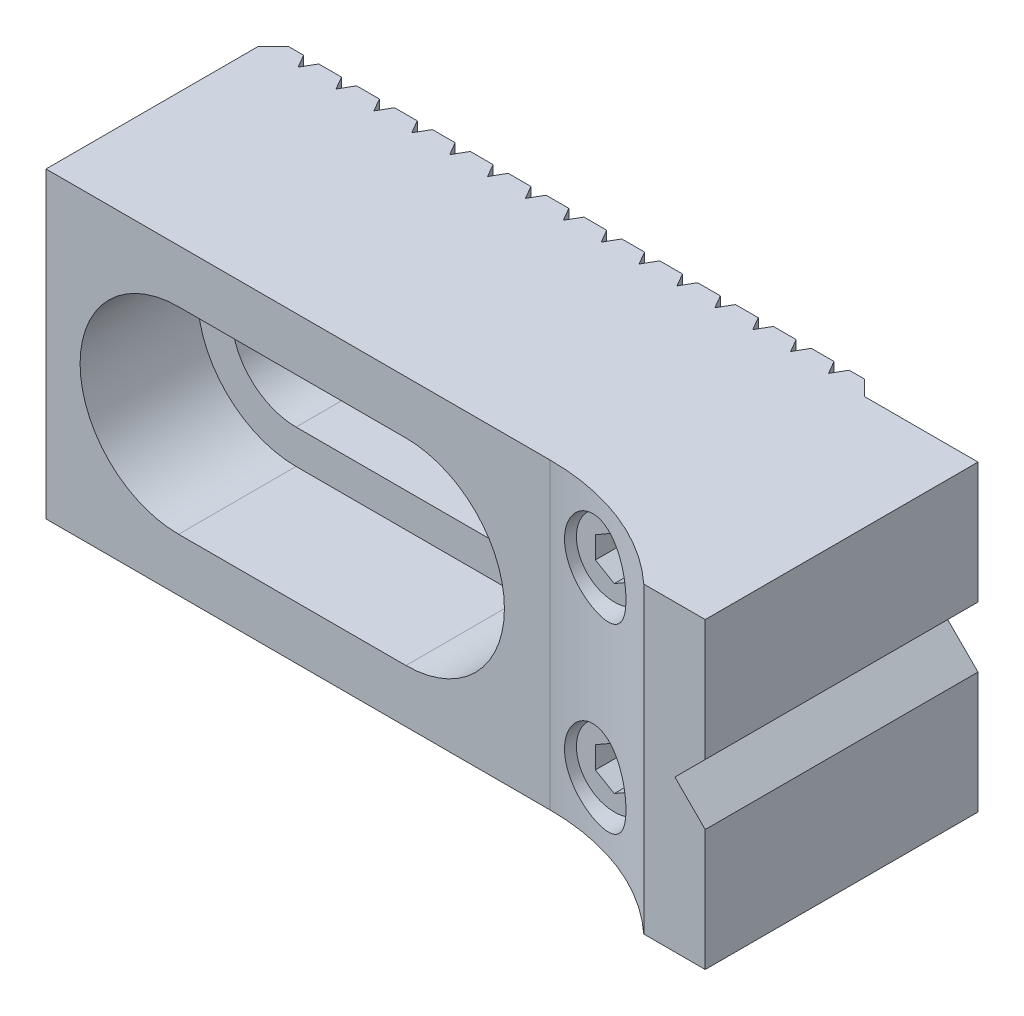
ISO-10303-21;
HEADER;
FILE_DESCRIPTION(('STEP AP214'),'2;1');
FILE_NAME('part.step','',(''),(''),'','','');
FILE_SCHEMA(('AUTOMOTIVE_DESIGN { 1 0 10303 214 1 1 1 1 }'));
ENDSEC;
DATA;
#1=APPLICATION_CONTEXT('core data for automotive mechanical design processes');
#2=APPLICATION_PROTOCOL_DEFINITION('international standard','automotive_design',2000,#1);
#3=PRODUCT_CONTEXT('',#1,'mechanical');
#4=PRODUCT('Part','Part','',(#3));
#5=PRODUCT_RELATED_PRODUCT_CATEGORY('part','',(#4));
#6=PRODUCT_DEFINITION_FORMATION('','',#4);
#7=PRODUCT_DEFINITION_CONTEXT('part definition',#1,'design');
#8=PRODUCT_DEFINITION('design','',#6,#7);
#9=PRODUCT_DEFINITION_SHAPE('','',#8);
#10=(LENGTH_UNIT() NAMED_UNIT(*) SI_UNIT(.MILLI.,.METRE.));
#11=(NAMED_UNIT(*) PLANE_ANGLE_UNIT() SI_UNIT($,.RADIAN.));
#12=(NAMED_UNIT(*) SI_UNIT($,.STERADIAN.) SOLID_ANGLE_UNIT());
#13=UNCERTAINTY_MEASURE_WITH_UNIT(LENGTH_MEASURE(1.E-05),#10,'distance_accuracy_value','');
#14=(GEOMETRIC_REPRESENTATION_CONTEXT(3) GLOBAL_UNCERTAINTY_ASSIGNED_CONTEXT((#13)) GLOBAL_UNIT_ASSIGNED_CONTEXT((#10,
#11,#12)) REPRESENTATION_CONTEXT('',''));
#15=CARTESIAN_POINT('',(0.,0.,0.));
#16=DIRECTION('',(0.,0.,1.));
#17=DIRECTION('',(1.,0.,0.));
#18=AXIS2_PLACEMENT_3D('',#15,#16,#17);
#19=CARTESIAN_POINT('',(-45.5,20.,0.));
#20=DIRECTION('',(0.,0.,-1.));
#21=DIRECTION('',(-1.,0.,0.));
#22=AXIS2_PLACEMENT_3D('',#19,#20,#21);
#23=PLANE('',#22);
#24=DIRECTION('',(0.,1.,0.));
#25=VECTOR('',#24,1.);
#26=CARTESIAN_POINT('',(26.501184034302,-20.,0.));
#27=LINE('',#26,#25);
#28=CARTESIAN_POINT('',(26.501184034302,14.9999997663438,0.));
#29=VERTEX_POINT('',#28);
#30=CARTESIAN_POINT('',(26.501184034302,20.,0.));
#31=VERTEX_POINT('',#30);
#32=EDGE_CURVE('E900',#29,#31,#27,.T.);
#33=ORIENTED_EDGE('',*,*,#32,.F.);
#34=CARTESIAN_POINT('',(26.5,12.,0.));
#35=DIRECTION('',(0.,0.,1.));
#36=DIRECTION('',(1.,0.,0.));
#37=AXIS2_PLACEMENT_3D('',#34,#35,#36);
#38=CIRCLE('',#37,3.);
#39=CARTESIAN_POINT('',(26.501184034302,9.00000023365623,0.));
#40=VERTEX_POINT('',#39);
#41=EDGE_CURVE('E750',#29,#40,#38,.T.);
#42=ORIENTED_EDGE('',*,*,#41,.T.);
#43=CARTESIAN_POINT('',(26.501184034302,-9.00000023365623,0.));
#44=VERTEX_POINT('',#43);
#45=EDGE_CURVE('E906',#44,#40,#27,.T.);
#46=ORIENTED_EDGE('',*,*,#45,.F.);
#47=CARTESIAN_POINT('',(26.5,-12.,0.));
#48=DIRECTION('',(0.,0.,1.));
#49=DIRECTION('',(1.,0.,0.));
#50=AXIS2_PLACEMENT_3D('',#47,#48,#49);
#51=CIRCLE('',#50,3.);
#52=CARTESIAN_POINT('',(26.501184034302,-14.9999997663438,0.));
#53=VERTEX_POINT('',#52);
#54=EDGE_CURVE('E758',#44,#53,#51,.T.);
#55=ORIENTED_EDGE('',*,*,#54,.T.);
#56=CARTESIAN_POINT('',(26.501184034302,-20.,0.));
#57=VERTEX_POINT('',#56);
#58=EDGE_CURVE('E902',#57,#53,#27,.T.);
#59=ORIENTED_EDGE('',*,*,#58,.F.);
#60=DIRECTION('',(1.,0.,0.));
#61=VECTOR('',#60,1.);
#62=CARTESIAN_POINT('',(-45.5,-20.,0.));
#63=LINE('',#62,#61);
#64=CARTESIAN_POINT('',(23.4988159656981,-20.,0.));
#65=VERTEX_POINT('',#64);
#66=EDGE_CURVE('E1614',#65,#57,#63,.T.);
#67=ORIENTED_EDGE('',*,*,#66,.F.);
#68=DIRECTION('',(0.,1.,0.));
#69=VECTOR('',#68,1.);
#70=CARTESIAN_POINT('',(23.4988159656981,-20.,0.));
#71=LINE('',#70,#69);
#72=CARTESIAN_POINT('',(23.4988159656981,20.,0.));
#73=VERTEX_POINT('',#72);
#74=EDGE_CURVE('E918',#65,#73,#71,.T.);
#75=ORIENTED_EDGE('',*,*,#74,.T.);
#76=DIRECTION('',(1.,0.,0.));
#77=VECTOR('',#76,1.);
#78=CARTESIAN_POINT('',(-45.5,20.,0.));
#79=LINE('',#78,#77);
#80=EDGE_CURVE('E1469',#73,#31,#79,.T.);
#81=ORIENTED_EDGE('',*,*,#80,.T.);
#82=EDGE_LOOP('',(#33,#42,#46,#55,#59,#67,#75,#81));
#83=FACE_BOUND('',#82,.T.);
#84=ADVANCED_FACE('F15',(#83),#23,.T.);
#85=DIRECTION('',(0.,1.,0.));
#86=VECTOR('',#85,1.);
#87=CARTESIAN_POINT('',(28.4988159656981,-20.,0.));
#88=LINE('',#87,#86);
#89=CARTESIAN_POINT('',(28.4988159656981,-9.7628735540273,0.));
#90=VERTEX_POINT('',#89);
#91=CARTESIAN_POINT('',(28.4988159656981,9.7628735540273,0.));
#92=VERTEX_POINT('',#91);
#93=EDGE_CURVE('E901',#90,#92,#88,.T.);
#94=ORIENTED_EDGE('',*,*,#93,.T.);
#95=CARTESIAN_POINT('',(28.4988159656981,14.2371264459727,0.));
#96=VERTEX_POINT('',#95);
#97=EDGE_CURVE('E747',#92,#96,#38,.T.);
#98=ORIENTED_EDGE('',*,*,#97,.T.);
#99=CARTESIAN_POINT('',(28.4988159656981,20.,0.));
#100=VERTEX_POINT('',#99);
#101=EDGE_CURVE('E895',#96,#100,#88,.T.);
#102=ORIENTED_EDGE('',*,*,#101,.T.);
#103=CARTESIAN_POINT('',(30.5,20.,0.));
#104=VERTEX_POINT('',#103);
#105=EDGE_CURVE('E1227',#100,#104,#79,.T.);
#106=ORIENTED_EDGE('',*,*,#105,.T.);
#107=DIRECTION('',(0.,-1.,0.));
#108=VECTOR('',#107,1.);
#109=CARTESIAN_POINT('',(30.5,20.,0.));
#110=LINE('',#109,#108);
#111=CARTESIAN_POINT('',(30.5,-20.,0.));
#112=VERTEX_POINT('',#111);
#113=EDGE_CURVE('E1239',#104,#112,#110,.T.);
#114=ORIENTED_EDGE('',*,*,#113,.T.);
#115=CARTESIAN_POINT('',(28.4988159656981,-20.,0.));
#116=VERTEX_POINT('',#115);
#117=EDGE_CURVE('E1213',#116,#112,#63,.T.);
#118=ORIENTED_EDGE('',*,*,#117,.F.);
#119=CARTESIAN_POINT('',(28.4988159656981,-14.2371264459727,0.));
#120=VERTEX_POINT('',#119);
#121=EDGE_CURVE('E897',#116,#120,#88,.T.);
#122=ORIENTED_EDGE('',*,*,#121,.T.);
#123=EDGE_CURVE('E755',#120,#90,#51,.T.);
#124=ORIENTED_EDGE('',*,*,#123,.T.);
#125=EDGE_LOOP('',(#94,#98,#102,#106,#114,#118,#122,#124));
#126=FACE_BOUND('',#125,.T.);
#127=ADVANCED_FACE('F1398',(#126),#23,.T.);
#128=CARTESIAN_POINT('',(27.5,-20.,1.73));
#129=DIRECTION('',(0.866025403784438,0.,-0.5));
#130=DIRECTION('',(-0.5,0.,-0.866025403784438));
#131=AXIS2_PLACEMENT_3D('',#128,#129,#130);
#132=PLANE('',#131);
#133=DIRECTION('',(0.,1.,0.));
#134=VECTOR('',#133,1.);
#135=CARTESIAN_POINT('',(27.5,-20.,1.73));
#136=LINE('',#135,#134);
#137=CARTESIAN_POINT('',(27.5,14.8284271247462,1.73));
#138=VERTEX_POINT('',#137);
#139=CARTESIAN_POINT('',(27.5,20.,1.73));
#140=VERTEX_POINT('',#139);
#141=EDGE_CURVE('E890',#138,#140,#136,.T.);
#142=ORIENTED_EDGE('',*,*,#141,.F.);
#143=CARTESIAN_POINT('',(26.5,12.,-0.00205080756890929));
#144=DIRECTION('',(0.866025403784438,0.,-0.5));
#145=DIRECTION('',(0.5,0.,0.866025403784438));
#146=AXIS2_PLACEMENT_3D('',#143,#144,#145);
#147=ELLIPSE('',#146,6.,3.);
#148=EDGE_CURVE('E754',#138,#29,#147,.F.);
#149=ORIENTED_EDGE('',*,*,#148,.T.);
#150=ORIENTED_EDGE('',*,*,#32,.T.);
#151=DIRECTION('',(-0.5,0.,-0.866025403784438));
#152=VECTOR('',#151,1.);
#153=CARTESIAN_POINT('',(27.5,20.,1.73));
#154=LINE('',#153,#152);
#155=EDGE_CURVE('E880',#140,#31,#154,.T.);
#156=ORIENTED_EDGE('',*,*,#155,.F.);
#157=EDGE_LOOP('',(#142,#149,#150,#156));
#158=FACE_BOUND('',#157,.T.);
#159=ADVANCED_FACE('F1406',(#158),#132,.T.);
#160=ORIENTED_EDGE('',*,*,#45,.T.);
#161=CARTESIAN_POINT('',(27.5,9.17157287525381,1.73));
#162=VERTEX_POINT('',#161);
#163=EDGE_CURVE('E751',#40,#162,#147,.F.);
#164=ORIENTED_EDGE('',*,*,#163,.T.);
#165=CARTESIAN_POINT('',(27.5,-9.17157287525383,1.73));
#166=VERTEX_POINT('',#165);
#167=EDGE_CURVE('E896',#166,#162,#136,.T.);
#168=ORIENTED_EDGE('',*,*,#167,.F.);
#169=CARTESIAN_POINT('',(26.5,-12.,-0.00205080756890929));
#170=DIRECTION('',(0.866025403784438,0.,-0.5));
#171=DIRECTION('',(0.5,0.,0.866025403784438));
#172=AXIS2_PLACEMENT_3D('',#169,#170,#171);
#173=ELLIPSE('',#172,6.,3.);
#174=EDGE_CURVE('E762',#166,#44,#173,.F.);
#175=ORIENTED_EDGE('',*,*,#174,.T.);
#176=EDGE_LOOP('',(#160,#164,#168,#175));
#177=FACE_BOUND('',#176,.T.);
#178=ADVANCED_FACE('F1636',(#177),#132,.T.);
#179=CARTESIAN_POINT('',(27.5,-20.,1.73));
#180=DIRECTION('',(0.866025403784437,0.,0.5));
#181=DIRECTION('',(0.5,0.,-0.866025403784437));
#182=AXIS2_PLACEMENT_3D('',#179,#180,#181);
#183=PLANE('',#182);
#184=CARTESIAN_POINT('',(26.5,12.,3.46205080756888));
#185=DIRECTION('',(0.866025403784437,0.,0.5));
#186=DIRECTION('',(-0.5,0.,0.866025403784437));
#187=AXIS2_PLACEMENT_3D('',#184,#185,#186);
#188=ELLIPSE('',#187,6.,3.);
#189=EDGE_CURVE('E1259',#138,#96,#188,.F.);
#190=ORIENTED_EDGE('',*,*,#189,.F.);
#191=ORIENTED_EDGE('',*,*,#141,.T.);
#192=DIRECTION('',(0.5,0.,-0.866025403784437));
#193=VECTOR('',#192,1.);
#194=CARTESIAN_POINT('',(27.5,20.,1.73));
#195=LINE('',#194,#193);
#196=EDGE_CURVE('E881',#140,#100,#195,.T.);
#197=ORIENTED_EDGE('',*,*,#196,.T.);
#198=ORIENTED_EDGE('',*,*,#101,.F.);
#199=EDGE_LOOP('',(#190,#191,#197,#198));
#200=FACE_BOUND('',#199,.T.);
#201=ADVANCED_FACE('F1647',(#200),#183,.F.);
#202=EDGE_CURVE('E1257',#92,#162,#188,.F.);
#203=ORIENTED_EDGE('',*,*,#202,.F.);
#204=ORIENTED_EDGE('',*,*,#93,.F.);
#205=CARTESIAN_POINT('',(26.5,-12.,3.46205080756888));
#206=DIRECTION('',(0.866025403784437,0.,0.5));
#207=DIRECTION('',(-0.5,0.,0.866025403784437));
#208=AXIS2_PLACEMENT_3D('',#205,#206,#207);
#209=ELLIPSE('',#208,6.,3.);
#210=EDGE_CURVE('E1256',#166,#90,#209,.F.);
#211=ORIENTED_EDGE('',*,*,#210,.F.);
#212=ORIENTED_EDGE('',*,*,#167,.T.);
#213=EDGE_LOOP('',(#203,#204,#211,#212));
#214=FACE_BOUND('',#213,.T.);
#215=ADVANCED_FACE('F1629',(#214),#183,.F.);
#216=ORIENTED_EDGE('',*,*,#58,.T.);
#217=CARTESIAN_POINT('',(27.5,-14.8284271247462,1.73));
#218=VERTEX_POINT('',#217);
#219=EDGE_CURVE('E759',#53,#218,#173,.F.);
#220=ORIENTED_EDGE('',*,*,#219,.T.);
#221=CARTESIAN_POINT('',(27.5,-20.,1.73));
#222=VERTEX_POINT('',#221);
#223=EDGE_CURVE('E892',#222,#218,#136,.T.);
#224=ORIENTED_EDGE('',*,*,#223,.F.);
#225=DIRECTION('',(-0.5,0.,-0.866025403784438));
#226=VECTOR('',#225,1.);
#227=CARTESIAN_POINT('',(27.5,-20.,1.73));
#228=LINE('',#227,#226);
#229=EDGE_CURVE('E884',#222,#57,#228,.T.);
#230=ORIENTED_EDGE('',*,*,#229,.T.);
#231=EDGE_LOOP('',(#216,#220,#224,#230));
#232=FACE_BOUND('',#231,.T.);
#233=ADVANCED_FACE('F1655',(#232),#132,.T.);
#234=EDGE_CURVE('E1254',#120,#218,#209,.F.);
#235=ORIENTED_EDGE('',*,*,#234,.F.);
#236=ORIENTED_EDGE('',*,*,#121,.F.);
#237=DIRECTION('',(0.5,0.,-0.866025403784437));
#238=VECTOR('',#237,1.);
#239=CARTESIAN_POINT('',(27.5,-20.,1.73));
#240=LINE('',#239,#238);
#241=EDGE_CURVE('E887',#222,#116,#240,.T.);
#242=ORIENTED_EDGE('',*,*,#241,.F.);
#243=ORIENTED_EDGE('',*,*,#223,.T.);
#244=EDGE_LOOP('',(#235,#236,#242,#243));
#245=FACE_BOUND('',#244,.T.);
#246=ADVANCED_FACE('F1623',(#245),#183,.F.);
#247=CARTESIAN_POINT('',(0.,0.,0.));
#248=DIRECTION('',(0.,0.,1.));
#249=DIRECTION('',(1.,0.,0.));
#250=AXIS2_PLACEMENT_3D('',#247,#248,#249);
#251=CIRCLE('',#250,8.5);
#252=CARTESIAN_POINT('',(6.501184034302,5.4758201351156,0.));
#253=VERTEX_POINT('',#252);
#254=CARTESIAN_POINT('',(3.4988159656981,7.74650158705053,0.));
#255=VERTEX_POINT('',#254);
#256=EDGE_CURVE('E2193',#253,#255,#251,.T.);
#257=ORIENTED_EDGE('',*,*,#256,.T.);
#258=DIRECTION('',(0.,1.,0.));
#259=VECTOR('',#258,1.);
#260=CARTESIAN_POINT('',(3.4988159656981,-20.,0.));
#261=LINE('',#260,#259);
#262=CARTESIAN_POINT('',(3.4988159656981,20.,0.));
#263=VERTEX_POINT('',#262);
#264=EDGE_CURVE('E995',#255,#263,#261,.T.);
#265=ORIENTED_EDGE('',*,*,#264,.T.);
#266=CARTESIAN_POINT('',(6.5011840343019,20.,0.));
#267=VERTEX_POINT('',#266);
#268=EDGE_CURVE('E1484',#263,#267,#79,.T.);
#269=ORIENTED_EDGE('',*,*,#268,.T.);
#270=DIRECTION('',(0.,1.,0.));
#271=VECTOR('',#270,1.);
#272=CARTESIAN_POINT('',(6.5011840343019,-20.,0.));
#273=LINE('',#272,#271);
#274=EDGE_CURVE('E976',#253,#267,#273,.T.);
#275=ORIENTED_EDGE('',*,*,#274,.F.);
#276=EDGE_LOOP('',(#257,#265,#269,#275));
#277=FACE_BOUND('',#276,.T.);
#278=ADVANCED_FACE('F1408',(#277),#23,.T.);
#279=CARTESIAN_POINT('',(0.,-8.5,0.));
#280=VERTEX_POINT('',#279);
#281=CARTESIAN_POINT('',(1.501184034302,-8.36638790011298,0.));
#282=VERTEX_POINT('',#281);
#283=EDGE_CURVE('E776',#280,#282,#251,.T.);
#284=ORIENTED_EDGE('',*,*,#283,.T.);
#285=DIRECTION('',(0.,1.,0.));
#286=VECTOR('',#285,1.);
#287=CARTESIAN_POINT('',(1.50118403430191,-20.,0.));
#288=LINE('',#287,#286);
#289=CARTESIAN_POINT('',(1.50118403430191,-20.,0.));
#290=VERTEX_POINT('',#289);
#291=EDGE_CURVE('E1000',#290,#282,#288,.T.);
#292=ORIENTED_EDGE('',*,*,#291,.F.);
#293=CARTESIAN_POINT('',(-1.50118403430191,-20.,0.));
#294=VERTEX_POINT('',#293);
#295=EDGE_CURVE('E1594',#294,#290,#63,.T.);
#296=ORIENTED_EDGE('',*,*,#295,.F.);
#297=DIRECTION('',(0.,1.,0.));
#298=VECTOR('',#297,1.);
#299=CARTESIAN_POINT('',(-1.50118403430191,-20.,0.));
#300=LINE('',#299,#298);
#301=CARTESIAN_POINT('',(-1.50118403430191,-8.5,0.));
#302=VERTEX_POINT('',#301);
#303=EDGE_CURVE('E1019',#294,#302,#300,.T.);
#304=ORIENTED_EDGE('',*,*,#303,.T.);
#305=DIRECTION('',(-1.,0.,0.));
#306=VECTOR('',#305,1.);
#307=CARTESIAN_POINT('',(0.,-8.5,0.));
#308=LINE('',#307,#306);
#309=EDGE_CURVE('E763',#280,#302,#308,.T.);
#310=ORIENTED_EDGE('',*,*,#309,.F.);
#311=EDGE_LOOP('',(#284,#292,#296,#304,#310));
#312=FACE_BOUND('',#311,.T.);
#313=ADVANCED_FACE('F1664',(#312),#23,.T.);
#314=DIRECTION('',(0.,1.,0.));
#315=VECTOR('',#314,1.);
#316=CARTESIAN_POINT('',(-6.50118403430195,-20.,0.));
#317=LINE('',#316,#315);
#318=CARTESIAN_POINT('',(-6.50118403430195,-20.,0.));
#319=VERTEX_POINT('',#318);
#320=CARTESIAN_POINT('',(-6.50118403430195,-8.5,0.));
#321=VERTEX_POINT('',#320);
#322=EDGE_CURVE('E1042',#319,#321,#317,.T.);
#323=ORIENTED_EDGE('',*,*,#322,.T.);
#324=CARTESIAN_POINT('',(-3.49881596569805,-8.5,0.));
#325=VERTEX_POINT('',#324);
#326=EDGE_CURVE('E766',#325,#321,#308,.T.);
#327=ORIENTED_EDGE('',*,*,#326,.F.);
#328=DIRECTION('',(0.,1.,0.));
#329=VECTOR('',#328,1.);
#330=CARTESIAN_POINT('',(-3.49881596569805,-20.,0.));
#331=LINE('',#330,#329);
#332=CARTESIAN_POINT('',(-3.49881596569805,-20.,0.));
#333=VERTEX_POINT('',#332);
#334=EDGE_CURVE('E1023',#333,#325,#331,.T.);
#335=ORIENTED_EDGE('',*,*,#334,.F.);
#336=EDGE_CURVE('E1590',#319,#333,#63,.T.);
#337=ORIENTED_EDGE('',*,*,#336,.F.);
#338=EDGE_LOOP('',(#323,#327,#335,#337));
#339=FACE_BOUND('',#338,.T.);
#340=ADVANCED_FACE('F2823',(#339),#23,.T.);
#341=CARTESIAN_POINT('',(-3.49881596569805,8.5,0.));
#342=VERTEX_POINT('',#341);
#343=CARTESIAN_POINT('',(-3.49881596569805,20.,0.));
#344=VERTEX_POINT('',#343);
#345=EDGE_CURVE('E1022',#342,#344,#331,.T.);
#346=ORIENTED_EDGE('',*,*,#345,.F.);
#347=DIRECTION('',(1.,0.,0.));
#348=VECTOR('',#347,1.);
#349=CARTESIAN_POINT('',(-30.,8.5,0.));
#350=LINE('',#349,#348);
#351=CARTESIAN_POINT('',(-6.50118403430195,8.5,0.));
#352=VERTEX_POINT('',#351);
#353=EDGE_CURVE('E2875',#352,#342,#350,.T.);
#354=ORIENTED_EDGE('',*,*,#353,.F.);
#355=CARTESIAN_POINT('',(-6.50118403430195,20.,0.));
#356=VERTEX_POINT('',#355);
#357=EDGE_CURVE('E1041',#352,#356,#317,.T.);
#358=ORIENTED_EDGE('',*,*,#357,.T.);
#359=EDGE_CURVE('E1494',#356,#344,#79,.T.);
#360=ORIENTED_EDGE('',*,*,#359,.T.);
#361=EDGE_LOOP('',(#346,#354,#358,#360));
#362=FACE_BOUND('',#361,.T.);
#363=ADVANCED_FACE('F2814',(#362),#23,.T.);
#364=DIRECTION('',(0.,1.,0.));
#365=VECTOR('',#364,1.);
#366=CARTESIAN_POINT('',(-11.5011840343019,-20.,0.));
#367=LINE('',#366,#365);
#368=CARTESIAN_POINT('',(-11.5011840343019,-20.,0.));
#369=VERTEX_POINT('',#368);
#370=CARTESIAN_POINT('',(-11.5011840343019,-8.5,0.));
#371=VERTEX_POINT('',#370);
#372=EDGE_CURVE('E1065',#369,#371,#367,.T.);
#373=ORIENTED_EDGE('',*,*,#372,.T.);
#374=CARTESIAN_POINT('',(-8.49881596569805,-8.5,0.));
#375=VERTEX_POINT('',#374);
#376=EDGE_CURVE('E2853',#375,#371,#308,.T.);
#377=ORIENTED_EDGE('',*,*,#376,.F.);
#378=DIRECTION('',(0.,1.,0.));
#379=VECTOR('',#378,1.);
#380=CARTESIAN_POINT('',(-8.49881596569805,-20.,0.));
#381=LINE('',#380,#379);
#382=CARTESIAN_POINT('',(-8.49881596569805,-20.,0.));
#383=VERTEX_POINT('',#382);
#384=EDGE_CURVE('E1046',#383,#375,#381,.T.);
#385=ORIENTED_EDGE('',*,*,#384,.F.);
#386=EDGE_CURVE('E1586',#369,#383,#63,.T.);
#387=ORIENTED_EDGE('',*,*,#386,.F.);
#388=EDGE_LOOP('',(#373,#377,#385,#387));
#389=FACE_BOUND('',#388,.T.);
#390=ADVANCED_FACE('F2806',(#389),#23,.T.);
#391=CARTESIAN_POINT('',(-8.49881596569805,8.5,0.));
#392=VERTEX_POINT('',#391);
#393=CARTESIAN_POINT('',(-8.49881596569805,20.,0.));
#394=VERTEX_POINT('',#393);
#395=EDGE_CURVE('E1045',#392,#394,#381,.T.);
#396=ORIENTED_EDGE('',*,*,#395,.F.);
#397=CARTESIAN_POINT('',(-11.5011840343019,8.5,0.));
#398=VERTEX_POINT('',#397);
#399=EDGE_CURVE('E2876',#398,#392,#350,.T.);
#400=ORIENTED_EDGE('',*,*,#399,.F.);
#401=CARTESIAN_POINT('',(-11.5011840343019,20.,0.));
#402=VERTEX_POINT('',#401);
#403=EDGE_CURVE('E1064',#398,#402,#367,.T.);
#404=ORIENTED_EDGE('',*,*,#403,.T.);
#405=EDGE_CURVE('E1499',#402,#394,#79,.T.);
#406=ORIENTED_EDGE('',*,*,#405,.T.);
#407=EDGE_LOOP('',(#396,#400,#404,#406));
#408=FACE_BOUND('',#407,.T.);
#409=ADVANCED_FACE('F2797',(#408),#23,.T.);
#410=DIRECTION('',(0.,1.,0.));
#411=VECTOR('',#410,1.);
#412=CARTESIAN_POINT('',(-16.501184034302,-20.,0.));
#413=LINE('',#412,#411);
#414=CARTESIAN_POINT('',(-16.501184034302,-20.,0.));
#415=VERTEX_POINT('',#414);
#416=CARTESIAN_POINT('',(-16.501184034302,-8.5,0.));
#417=VERTEX_POINT('',#416);
#418=EDGE_CURVE('E1088',#415,#417,#413,.T.);
#419=ORIENTED_EDGE('',*,*,#418,.T.);
#420=CARTESIAN_POINT('',(-13.498815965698,-8.5,0.));
#421=VERTEX_POINT('',#420);
#422=EDGE_CURVE('E2854',#421,#417,#308,.T.);
#423=ORIENTED_EDGE('',*,*,#422,.F.);
#424=DIRECTION('',(0.,1.,0.));
#425=VECTOR('',#424,1.);
#426=CARTESIAN_POINT('',(-13.498815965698,-20.,0.));
#427=LINE('',#426,#425);
#428=CARTESIAN_POINT('',(-13.498815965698,-20.,0.));
#429=VERTEX_POINT('',#428);
#430=EDGE_CURVE('E1069',#429,#421,#427,.T.);
#431=ORIENTED_EDGE('',*,*,#430,.F.);
#432=EDGE_CURVE('E1582',#415,#429,#63,.T.);
#433=ORIENTED_EDGE('',*,*,#432,.F.);
#434=EDGE_LOOP('',(#419,#423,#431,#433));
#435=FACE_BOUND('',#434,.T.);
#436=ADVANCED_FACE('F2789',(#435),#23,.T.);
#437=CARTESIAN_POINT('',(-13.498815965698,8.5,0.));
#438=VERTEX_POINT('',#437);
#439=CARTESIAN_POINT('',(-13.498815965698,20.,0.));
#440=VERTEX_POINT('',#439);
#441=EDGE_CURVE('E1068',#438,#440,#427,.T.);
#442=ORIENTED_EDGE('',*,*,#441,.F.);
#443=CARTESIAN_POINT('',(-16.501184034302,8.5,0.));
#444=VERTEX_POINT('',#443);
#445=EDGE_CURVE('E2878',#444,#438,#350,.T.);
#446=ORIENTED_EDGE('',*,*,#445,.F.);
#447=CARTESIAN_POINT('',(-16.501184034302,20.,0.));
#448=VERTEX_POINT('',#447);
#449=EDGE_CURVE('E1087',#444,#448,#413,.T.);
#450=ORIENTED_EDGE('',*,*,#449,.T.);
#451=EDGE_CURVE('E1504',#448,#440,#79,.T.);
#452=ORIENTED_EDGE('',*,*,#451,.T.);
#453=EDGE_LOOP('',(#442,#446,#450,#452));
#454=FACE_BOUND('',#453,.T.);
#455=ADVANCED_FACE('F2780',(#454),#23,.T.);
#456=DIRECTION('',(0.,1.,0.));
#457=VECTOR('',#456,1.);
#458=CARTESIAN_POINT('',(-21.501184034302,-20.,0.));
#459=LINE('',#458,#457);
#460=CARTESIAN_POINT('',(-21.501184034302,-20.,0.));
#461=VERTEX_POINT('',#460);
#462=CARTESIAN_POINT('',(-21.501184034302,-8.5,0.));
#463=VERTEX_POINT('',#462);
#464=EDGE_CURVE('E1111',#461,#463,#459,.T.);
#465=ORIENTED_EDGE('',*,*,#464,.T.);
#466=CARTESIAN_POINT('',(-18.498815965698,-8.5,0.));
#467=VERTEX_POINT('',#466);
#468=EDGE_CURVE('E2857',#467,#463,#308,.T.);
#469=ORIENTED_EDGE('',*,*,#468,.F.);
#470=DIRECTION('',(0.,1.,0.));
#471=VECTOR('',#470,1.);
#472=CARTESIAN_POINT('',(-18.498815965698,-20.,0.));
#473=LINE('',#472,#471);
#474=CARTESIAN_POINT('',(-18.498815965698,-20.,0.));
#475=VERTEX_POINT('',#474);
#476=EDGE_CURVE('E1092',#475,#467,#473,.T.);
#477=ORIENTED_EDGE('',*,*,#476,.F.);
#478=EDGE_CURVE('E1578',#461,#475,#63,.T.);
#479=ORIENTED_EDGE('',*,*,#478,.F.);
#480=EDGE_LOOP('',(#465,#469,#477,#479));
#481=FACE_BOUND('',#480,.T.);
#482=ADVANCED_FACE('F2772',(#481),#23,.T.);
#483=CARTESIAN_POINT('',(-18.498815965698,8.5,0.));
#484=VERTEX_POINT('',#483);
#485=CARTESIAN_POINT('',(-18.498815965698,20.,0.));
#486=VERTEX_POINT('',#485);
#487=EDGE_CURVE('E1091',#484,#486,#473,.T.);
#488=ORIENTED_EDGE('',*,*,#487,.F.);
#489=CARTESIAN_POINT('',(-21.501184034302,8.5,0.));
#490=VERTEX_POINT('',#489);
#491=EDGE_CURVE('E2880',#490,#484,#350,.T.);
#492=ORIENTED_EDGE('',*,*,#491,.F.);
#493=CARTESIAN_POINT('',(-21.501184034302,20.,0.));
#494=VERTEX_POINT('',#493);
#495=EDGE_CURVE('E1110',#490,#494,#459,.T.);
#496=ORIENTED_EDGE('',*,*,#495,.T.);
#497=EDGE_CURVE('E1509',#494,#486,#79,.T.);
#498=ORIENTED_EDGE('',*,*,#497,.T.);
#499=EDGE_LOOP('',(#488,#492,#496,#498));
#500=FACE_BOUND('',#499,.T.);
#501=ADVANCED_FACE('F2763',(#500),#23,.T.);
#502=DIRECTION('',(0.,1.,0.));
#503=VECTOR('',#502,1.);
#504=CARTESIAN_POINT('',(-26.501184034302,-20.,0.));
#505=LINE('',#504,#503);
#506=CARTESIAN_POINT('',(-26.501184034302,-20.,0.));
#507=VERTEX_POINT('',#506);
#508=CARTESIAN_POINT('',(-26.501184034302,-8.5,0.));
#509=VERTEX_POINT('',#508);
#510=EDGE_CURVE('E1134',#507,#509,#505,.T.);
#511=ORIENTED_EDGE('',*,*,#510,.T.);
#512=CARTESIAN_POINT('',(-23.4988159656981,-8.5,0.));
#513=VERTEX_POINT('',#512);
#514=EDGE_CURVE('E2860',#513,#509,#308,.T.);
#515=ORIENTED_EDGE('',*,*,#514,.F.);
#516=DIRECTION('',(0.,1.,0.));
#517=VECTOR('',#516,1.);
#518=CARTESIAN_POINT('',(-23.4988159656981,-20.,0.));
#519=LINE('',#518,#517);
#520=CARTESIAN_POINT('',(-23.4988159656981,-20.,0.));
#521=VERTEX_POINT('',#520);
#522=EDGE_CURVE('E1115',#521,#513,#519,.T.);
#523=ORIENTED_EDGE('',*,*,#522,.F.);
#524=EDGE_CURVE('E1575',#507,#521,#63,.T.);
#525=ORIENTED_EDGE('',*,*,#524,.F.);
#526=EDGE_LOOP('',(#511,#515,#523,#525));
#527=FACE_BOUND('',#526,.T.);
#528=ADVANCED_FACE('F2755',(#527),#23,.T.);
#529=CARTESIAN_POINT('',(-23.4988159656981,8.5,0.));
#530=VERTEX_POINT('',#529);
#531=CARTESIAN_POINT('',(-23.4988159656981,20.,0.));
#532=VERTEX_POINT('',#531);
#533=EDGE_CURVE('E1114',#530,#532,#519,.T.);
#534=ORIENTED_EDGE('',*,*,#533,.F.);
#535=CARTESIAN_POINT('',(-26.501184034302,8.5,0.));
#536=VERTEX_POINT('',#535);
#537=EDGE_CURVE('E774',#536,#530,#350,.T.);
#538=ORIENTED_EDGE('',*,*,#537,.F.);
#539=CARTESIAN_POINT('',(-26.501184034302,20.,0.));
#540=VERTEX_POINT('',#539);
#541=EDGE_CURVE('E1133',#536,#540,#505,.T.);
#542=ORIENTED_EDGE('',*,*,#541,.T.);
#543=EDGE_CURVE('E1514',#540,#532,#79,.T.);
#544=ORIENTED_EDGE('',*,*,#543,.T.);
#545=EDGE_LOOP('',(#534,#538,#542,#544));
#546=FACE_BOUND('',#545,.T.);
#547=ADVANCED_FACE('F2747',(#546),#23,.T.);
#548=CARTESIAN_POINT('',(-30.,0.,0.));
#549=DIRECTION('',(0.,0.,1.));
#550=DIRECTION('',(1.,0.,0.));
#551=AXIS2_PLACEMENT_3D('',#548,#549,#550);
#552=CIRCLE('',#551,8.5);
#553=CARTESIAN_POINT('',(-31.501184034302,-8.36638790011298,0.));
#554=VERTEX_POINT('',#553);
#555=CARTESIAN_POINT('',(-30.,-8.5,0.));
#556=VERTEX_POINT('',#555);
#557=EDGE_CURVE('E771',#554,#556,#552,.T.);
#558=ORIENTED_EDGE('',*,*,#557,.T.);
#559=CARTESIAN_POINT('',(-28.498815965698,-8.5,0.));
#560=VERTEX_POINT('',#559);
#561=EDGE_CURVE('E718',#560,#556,#308,.T.);
#562=ORIENTED_EDGE('',*,*,#561,.F.);
#563=DIRECTION('',(0.,1.,0.));
#564=VECTOR('',#563,1.);
#565=CARTESIAN_POINT('',(-28.498815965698,-20.,0.));
#566=LINE('',#565,#564);
#567=CARTESIAN_POINT('',(-28.498815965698,-20.,0.));
#568=VERTEX_POINT('',#567);
#569=EDGE_CURVE('E1138',#568,#560,#566,.T.);
#570=ORIENTED_EDGE('',*,*,#569,.F.);
#571=CARTESIAN_POINT('',(-31.501184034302,-20.,0.));
#572=VERTEX_POINT('',#571);
#573=EDGE_CURVE('E1573',#572,#568,#63,.T.);
#574=ORIENTED_EDGE('',*,*,#573,.F.);
#575=DIRECTION('',(0.,1.,0.));
#576=VECTOR('',#575,1.);
#577=CARTESIAN_POINT('',(-31.501184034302,-20.,0.));
#578=LINE('',#577,#576);
#579=EDGE_CURVE('E1157',#572,#554,#578,.T.);
#580=ORIENTED_EDGE('',*,*,#579,.T.);
#581=EDGE_LOOP('',(#558,#562,#570,#574,#580));
#582=FACE_BOUND('',#581,.T.);
#583=ADVANCED_FACE('F1554',(#582),#23,.T.);
#584=CARTESIAN_POINT('',(-33.498815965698,7.74650158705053,0.));
#585=VERTEX_POINT('',#584);
#586=CARTESIAN_POINT('',(-36.501184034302,5.47582013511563,0.));
#587=VERTEX_POINT('',#586);
#588=EDGE_CURVE('E770',#585,#587,#552,.T.);
#589=ORIENTED_EDGE('',*,*,#588,.T.);
#590=DIRECTION('',(0.,1.,0.));
#591=VECTOR('',#590,1.);
#592=CARTESIAN_POINT('',(-36.501184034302,-20.,0.));
#593=LINE('',#592,#591);
#594=CARTESIAN_POINT('',(-36.501184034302,20.,0.));
#595=VERTEX_POINT('',#594);
#596=EDGE_CURVE('E1179',#587,#595,#593,.T.);
#597=ORIENTED_EDGE('',*,*,#596,.T.);
#598=CARTESIAN_POINT('',(-33.498815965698,20.,0.));
#599=VERTEX_POINT('',#598);
#600=EDGE_CURVE('E1524',#595,#599,#79,.T.);
#601=ORIENTED_EDGE('',*,*,#600,.T.);
#602=DIRECTION('',(0.,1.,0.));
#603=VECTOR('',#602,1.);
#604=CARTESIAN_POINT('',(-33.498815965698,-20.,0.));
#605=LINE('',#604,#603);
#606=EDGE_CURVE('E1160',#585,#599,#605,.T.);
#607=ORIENTED_EDGE('',*,*,#606,.F.);
#608=EDGE_LOOP('',(#589,#597,#601,#607));
#609=FACE_BOUND('',#608,.T.);
#610=ADVANCED_FACE('F1546',(#609),#23,.T.);
#611=CARTESIAN_POINT('',(-37.5,-20.,1.73));
#612=DIRECTION('',(0.866025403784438,0.,-0.5));
#613=DIRECTION('',(-0.5,0.,-0.866025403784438));
#614=AXIS2_PLACEMENT_3D('',#611,#612,#613);
#615=PLANE('',#614);
#616=CARTESIAN_POINT('',(-30.,0.,14.7203810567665));
#617=DIRECTION('',(0.866025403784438,0.,-0.5));
#618=DIRECTION('',(0.5,0.,0.866025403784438));
#619=AXIS2_PLACEMENT_3D('',#616,#617,#618);
#620=ELLIPSE('',#619,17.,8.5);
#621=CARTESIAN_POINT('',(-37.5,-4.,1.73));
#622=VERTEX_POINT('',#621);
#623=CARTESIAN_POINT('',(-38.498815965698,-0.141870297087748,0.));
#624=VERTEX_POINT('',#623);
#625=EDGE_CURVE('E859',#622,#624,#620,.T.);
#626=ORIENTED_EDGE('',*,*,#625,.F.);
#627=DIRECTION('',(0.,1.,0.));
#628=VECTOR('',#627,1.);
#629=CARTESIAN_POINT('',(-37.5,-20.,1.73));
#630=LINE('',#629,#628);
#631=CARTESIAN_POINT('',(-37.5,-20.,1.73));
#632=VERTEX_POINT('',#631);
#633=EDGE_CURVE('E1176',#632,#622,#630,.T.);
#634=ORIENTED_EDGE('',*,*,#633,.F.);
#635=DIRECTION('',(-0.5,0.,-0.866025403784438));
#636=VECTOR('',#635,1.);
#637=CARTESIAN_POINT('',(-37.5,-20.,1.73));
#638=LINE('',#637,#636);
#639=CARTESIAN_POINT('',(-38.498815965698,-20.,0.));
#640=VERTEX_POINT('',#639);
#641=EDGE_CURVE('E1168',#632,#640,#638,.T.);
#642=ORIENTED_EDGE('',*,*,#641,.T.);
#643=DIRECTION('',(0.,1.,0.));
#644=VECTOR('',#643,1.);
#645=CARTESIAN_POINT('',(-38.498815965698,-20.,0.));
#646=LINE('',#645,#644);
#647=EDGE_CURVE('E1184',#640,#624,#646,.T.);
#648=ORIENTED_EDGE('',*,*,#647,.T.);
#649=EDGE_LOOP('',(#626,#634,#642,#648));
#650=FACE_BOUND('',#649,.T.);
#651=ADVANCED_FACE('F2364',(#650),#615,.T.);
#652=CARTESIAN_POINT('',(-37.5,-20.,1.73));
#653=DIRECTION('',(0.866025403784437,0.,0.5));
#654=DIRECTION('',(0.5,0.,-0.866025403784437));
#655=AXIS2_PLACEMENT_3D('',#652,#653,#654);
#656=PLANE('',#655);
#657=ORIENTED_EDGE('',*,*,#633,.T.);
#658=CARTESIAN_POINT('',(-30.,0.,-11.2603810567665));
#659=DIRECTION('',(0.866025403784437,0.,0.5));
#660=DIRECTION('',(-0.5,0.,0.866025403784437));
#661=AXIS2_PLACEMENT_3D('',#658,#659,#660);
#662=ELLIPSE('',#661,17.,8.5);
#663=CARTESIAN_POINT('',(-36.501184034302,-5.47582013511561,0.));
#664=VERTEX_POINT('',#663);
#665=EDGE_CURVE('E857',#622,#664,#662,.T.);
#666=ORIENTED_EDGE('',*,*,#665,.T.);
#667=CARTESIAN_POINT('',(-36.501184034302,-20.,0.));
#668=VERTEX_POINT('',#667);
#669=EDGE_CURVE('E1180',#668,#664,#593,.T.);
#670=ORIENTED_EDGE('',*,*,#669,.F.);
#671=DIRECTION('',(0.5,0.,-0.866025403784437));
#672=VECTOR('',#671,1.);
#673=CARTESIAN_POINT('',(-37.5,-20.,1.73));
#674=LINE('',#673,#672);
#675=EDGE_CURVE('E1171',#632,#668,#674,.T.);
#676=ORIENTED_EDGE('',*,*,#675,.F.);
#677=EDGE_LOOP('',(#657,#666,#670,#676));
#678=FACE_BOUND('',#677,.T.);
#679=ADVANCED_FACE('F1568',(#678),#656,.F.);
#680=CARTESIAN_POINT('',(-32.5,-20.,1.73));
#681=DIRECTION('',(0.866025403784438,0.,-0.5));
#682=DIRECTION('',(-0.5,0.,-0.866025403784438));
#683=AXIS2_PLACEMENT_3D('',#680,#681,#682);
#684=PLANE('',#683);
#685=CARTESIAN_POINT('',(-30.,0.,6.06012701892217));
#686=DIRECTION('',(0.866025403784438,0.,-0.5));
#687=DIRECTION('',(0.5,0.,0.866025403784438));
#688=AXIS2_PLACEMENT_3D('',#685,#686,#687);
#689=ELLIPSE('',#688,17.,8.5);
#690=CARTESIAN_POINT('',(-32.5,-8.12403840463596,1.73));
#691=VERTEX_POINT('',#690);
#692=CARTESIAN_POINT('',(-33.498815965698,-7.74650158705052,0.));
#693=VERTEX_POINT('',#692);
#694=EDGE_CURVE('E852',#691,#693,#689,.T.);
#695=ORIENTED_EDGE('',*,*,#694,.F.);
#696=DIRECTION('',(0.,1.,0.));
#697=VECTOR('',#696,1.);
#698=CARTESIAN_POINT('',(-32.5,-20.,1.73));
#699=LINE('',#698,#697);
#700=CARTESIAN_POINT('',(-32.5,-20.,1.73));
#701=VERTEX_POINT('',#700);
#702=EDGE_CURVE('E1153',#701,#691,#699,.T.);
#703=ORIENTED_EDGE('',*,*,#702,.F.);
#704=DIRECTION('',(-0.5,0.,-0.866025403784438));
#705=VECTOR('',#704,1.);
#706=CARTESIAN_POINT('',(-32.5,-20.,1.73));
#707=LINE('',#706,#705);
#708=CARTESIAN_POINT('',(-33.498815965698,-20.,0.));
#709=VERTEX_POINT('',#708);
#710=EDGE_CURVE('E1145',#701,#709,#707,.T.);
#711=ORIENTED_EDGE('',*,*,#710,.T.);
#712=EDGE_CURVE('E1161',#709,#693,#605,.T.);
#713=ORIENTED_EDGE('',*,*,#712,.T.);
#714=EDGE_LOOP('',(#695,#703,#711,#713));
#715=FACE_BOUND('',#714,.T.);
#716=ADVANCED_FACE('F1564',(#715),#684,.T.);
#717=CARTESIAN_POINT('',(-32.5,-20.,1.73));
#718=DIRECTION('',(0.866025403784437,0.,0.5));
#719=DIRECTION('',(0.5,0.,-0.866025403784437));
#720=AXIS2_PLACEMENT_3D('',#717,#718,#719);
#721=PLANE('',#720);
#722=ORIENTED_EDGE('',*,*,#702,.T.);
#723=CARTESIAN_POINT('',(-30.,0.,-2.60012701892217));
#724=DIRECTION('',(0.866025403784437,0.,0.5));
#725=DIRECTION('',(-0.5,0.,0.866025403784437));
#726=AXIS2_PLACEMENT_3D('',#723,#724,#725);
#727=ELLIPSE('',#726,17.,8.5);
#728=EDGE_CURVE('E1253',#691,#554,#727,.T.);
#729=ORIENTED_EDGE('',*,*,#728,.T.);
#730=ORIENTED_EDGE('',*,*,#579,.F.);
#731=DIRECTION('',(0.5,0.,-0.866025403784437));
#732=VECTOR('',#731,1.);
#733=CARTESIAN_POINT('',(-32.5,-20.,1.73));
#734=LINE('',#733,#732);
#735=EDGE_CURVE('E1148',#701,#572,#734,.T.);
#736=ORIENTED_EDGE('',*,*,#735,.F.);
#737=EDGE_LOOP('',(#722,#729,#730,#736));
#738=FACE_BOUND('',#737,.T.);
#739=ADVANCED_FACE('F1560',(#738),#721,.F.);
#740=CARTESIAN_POINT('',(-27.5,-20.,1.73));
#741=DIRECTION('',(0.866025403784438,0.,-0.5));
#742=DIRECTION('',(-0.5,0.,-0.866025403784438));
#743=AXIS2_PLACEMENT_3D('',#740,#741,#742);
#744=PLANE('',#743);
#745=ORIENTED_EDGE('',*,*,#569,.T.);
#746=DIRECTION('',(0.5,0.,0.866025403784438));
#747=VECTOR('',#746,1.);
#748=CARTESIAN_POINT('',(-27.5,-8.5,1.73));
#749=LINE('',#748,#747);
#750=CARTESIAN_POINT('',(-27.5,-8.5,1.73));
#751=VERTEX_POINT('',#750);
#752=EDGE_CURVE('E847',#560,#751,#749,.T.);
#753=ORIENTED_EDGE('',*,*,#752,.T.);
#754=DIRECTION('',(0.,1.,0.));
#755=VECTOR('',#754,1.);
#756=CARTESIAN_POINT('',(-27.5,-20.,1.73));
#757=LINE('',#756,#755);
#758=CARTESIAN_POINT('',(-27.5,-20.,1.73));
#759=VERTEX_POINT('',#758);
#760=EDGE_CURVE('E1130',#759,#751,#757,.T.);
#761=ORIENTED_EDGE('',*,*,#760,.F.);
#762=DIRECTION('',(-0.5,0.,-0.866025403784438));
#763=VECTOR('',#762,1.);
#764=CARTESIAN_POINT('',(-27.5,-20.,1.73));
#765=LINE('',#764,#763);
#766=EDGE_CURVE('E1122',#759,#568,#765,.T.);
#767=ORIENTED_EDGE('',*,*,#766,.T.);
#768=EDGE_LOOP('',(#745,#753,#761,#767));
#769=FACE_BOUND('',#768,.T.);
#770=ADVANCED_FACE('F2693',(#769),#744,.T.);
#771=CARTESIAN_POINT('',(-27.5,8.5,1.73));
#772=VERTEX_POINT('',#771);
#773=CARTESIAN_POINT('',(-27.5,20.,1.73));
#774=VERTEX_POINT('',#773);
#775=EDGE_CURVE('E1128',#772,#774,#757,.T.);
#776=ORIENTED_EDGE('',*,*,#775,.F.);
#777=DIRECTION('',(-0.5,0.,-0.866025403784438));
#778=VECTOR('',#777,1.);
#779=CARTESIAN_POINT('',(-27.5,8.5,1.73));
#780=LINE('',#779,#778);
#781=CARTESIAN_POINT('',(-28.498815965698,8.5,0.));
#782=VERTEX_POINT('',#781);
#783=EDGE_CURVE('E819',#772,#782,#780,.T.);
#784=ORIENTED_EDGE('',*,*,#783,.T.);
#785=CARTESIAN_POINT('',(-28.498815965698,20.,0.));
#786=VERTEX_POINT('',#785);
#787=EDGE_CURVE('E1137',#782,#786,#566,.T.);
#788=ORIENTED_EDGE('',*,*,#787,.T.);
#789=DIRECTION('',(-0.5,0.,-0.866025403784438));
#790=VECTOR('',#789,1.);
#791=CARTESIAN_POINT('',(-27.5,20.,1.73));
#792=LINE('',#791,#790);
#793=EDGE_CURVE('E1118',#774,#786,#792,.T.);
#794=ORIENTED_EDGE('',*,*,#793,.F.);
#795=EDGE_LOOP('',(#776,#784,#788,#794));
#796=FACE_BOUND('',#795,.T.);
#797=ADVANCED_FACE('F2684',(#796),#744,.T.);
#798=CARTESIAN_POINT('',(-27.5,-20.,1.73));
#799=DIRECTION('',(0.866025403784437,0.,0.5));
#800=DIRECTION('',(0.5,0.,-0.866025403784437));
#801=AXIS2_PLACEMENT_3D('',#798,#799,#800);
#802=PLANE('',#801);
#803=DIRECTION('',(-0.5,0.,0.866025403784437));
#804=VECTOR('',#803,1.);
#805=CARTESIAN_POINT('',(-27.5,-8.5,1.73));
#806=LINE('',#805,#804);
#807=EDGE_CURVE('E845',#509,#751,#806,.T.);
#808=ORIENTED_EDGE('',*,*,#807,.F.);
#809=ORIENTED_EDGE('',*,*,#510,.F.);
#810=DIRECTION('',(0.5,0.,-0.866025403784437));
#811=VECTOR('',#810,1.);
#812=CARTESIAN_POINT('',(-27.5,-20.,1.73));
#813=LINE('',#812,#811);
#814=EDGE_CURVE('E1125',#759,#507,#813,.T.);
#815=ORIENTED_EDGE('',*,*,#814,.F.);
#816=ORIENTED_EDGE('',*,*,#760,.T.);
#817=EDGE_LOOP('',(#808,#809,#815,#816));
#818=FACE_BOUND('',#817,.T.);
#819=ADVANCED_FACE('F2674',(#818),#802,.F.);
#820=DIRECTION('',(0.5,0.,-0.866025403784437));
#821=VECTOR('',#820,1.);
#822=CARTESIAN_POINT('',(-27.5,8.5,1.73));
#823=LINE('',#822,#821);
#824=EDGE_CURVE('E817',#772,#536,#823,.T.);
#825=ORIENTED_EDGE('',*,*,#824,.F.);
#826=ORIENTED_EDGE('',*,*,#775,.T.);
#827=DIRECTION('',(0.5,0.,-0.866025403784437));
#828=VECTOR('',#827,1.);
#829=CARTESIAN_POINT('',(-27.5,20.,1.73));
#830=LINE('',#829,#828);
#831=EDGE_CURVE('E1119',#774,#540,#830,.T.);
#832=ORIENTED_EDGE('',*,*,#831,.T.);
#833=ORIENTED_EDGE('',*,*,#541,.F.);
#834=EDGE_LOOP('',(#825,#826,#832,#833));
#835=FACE_BOUND('',#834,.T.);
#836=ADVANCED_FACE('F2665',(#835),#802,.F.);
#837=CARTESIAN_POINT('',(-22.5,-20.,1.73));
#838=DIRECTION('',(0.866025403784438,0.,-0.5));
#839=DIRECTION('',(-0.5,0.,-0.866025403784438));
#840=AXIS2_PLACEMENT_3D('',#837,#838,#839);
#841=PLANE('',#840);
#842=ORIENTED_EDGE('',*,*,#522,.T.);
#843=DIRECTION('',(0.5,0.,0.866025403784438));
#844=VECTOR('',#843,1.);
#845=CARTESIAN_POINT('',(-22.5,-8.5,1.73));
#846=LINE('',#845,#844);
#847=CARTESIAN_POINT('',(-22.5,-8.5,1.73));
#848=VERTEX_POINT('',#847);
#849=EDGE_CURVE('E842',#513,#848,#846,.T.);
#850=ORIENTED_EDGE('',*,*,#849,.T.);
#851=DIRECTION('',(0.,1.,0.));
#852=VECTOR('',#851,1.);
#853=CARTESIAN_POINT('',(-22.5,-20.,1.73));
#854=LINE('',#853,#852);
#855=CARTESIAN_POINT('',(-22.5,-20.,1.73));
#856=VERTEX_POINT('',#855);
#857=EDGE_CURVE('E1107',#856,#848,#854,.T.);
#858=ORIENTED_EDGE('',*,*,#857,.F.);
#859=DIRECTION('',(-0.5,0.,-0.866025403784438));
#860=VECTOR('',#859,1.);
#861=CARTESIAN_POINT('',(-22.5,-20.,1.73));
#862=LINE('',#861,#860);
#863=EDGE_CURVE('E1099',#856,#521,#862,.T.);
#864=ORIENTED_EDGE('',*,*,#863,.T.);
#865=EDGE_LOOP('',(#842,#850,#858,#864));
#866=FACE_BOUND('',#865,.T.);
#867=ADVANCED_FACE('F2655',(#866),#841,.T.);
#868=CARTESIAN_POINT('',(-22.5,8.5,1.73));
#869=VERTEX_POINT('',#868);
#870=CARTESIAN_POINT('',(-22.5,20.,1.73));
#871=VERTEX_POINT('',#870);
#872=EDGE_CURVE('E1105',#869,#871,#854,.T.);
#873=ORIENTED_EDGE('',*,*,#872,.F.);
#874=DIRECTION('',(-0.5,0.,-0.866025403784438));
#875=VECTOR('',#874,1.);
#876=CARTESIAN_POINT('',(-22.5,8.5,1.73));
#877=LINE('',#876,#875);
#878=EDGE_CURVE('E814',#869,#530,#877,.T.);
#879=ORIENTED_EDGE('',*,*,#878,.T.);
#880=ORIENTED_EDGE('',*,*,#533,.T.);
#881=DIRECTION('',(-0.5,0.,-0.866025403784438));
#882=VECTOR('',#881,1.);
#883=CARTESIAN_POINT('',(-22.5,20.,1.73));
#884=LINE('',#883,#882);
#885=EDGE_CURVE('E1095',#871,#532,#884,.T.);
#886=ORIENTED_EDGE('',*,*,#885,.F.);
#887=EDGE_LOOP('',(#873,#879,#880,#886));
#888=FACE_BOUND('',#887,.T.);
#889=ADVANCED_FACE('F2646',(#888),#841,.T.);
#890=CARTESIAN_POINT('',(-22.5,-20.,1.73));
#891=DIRECTION('',(0.866025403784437,0.,0.5));
#892=DIRECTION('',(0.5,0.,-0.866025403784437));
#893=AXIS2_PLACEMENT_3D('',#890,#891,#892);
#894=PLANE('',#893);
#895=DIRECTION('',(-0.5,0.,0.866025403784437));
#896=VECTOR('',#895,1.);
#897=CARTESIAN_POINT('',(-22.5,-8.5,1.73));
#898=LINE('',#897,#896);
#899=EDGE_CURVE('E840',#463,#848,#898,.T.);
#900=ORIENTED_EDGE('',*,*,#899,.F.);
#901=ORIENTED_EDGE('',*,*,#464,.F.);
#902=DIRECTION('',(0.5,0.,-0.866025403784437));
#903=VECTOR('',#902,1.);
#904=CARTESIAN_POINT('',(-22.5,-20.,1.73));
#905=LINE('',#904,#903);
#906=EDGE_CURVE('E1102',#856,#461,#905,.T.);
#907=ORIENTED_EDGE('',*,*,#906,.F.);
#908=ORIENTED_EDGE('',*,*,#857,.T.);
#909=EDGE_LOOP('',(#900,#901,#907,#908));
#910=FACE_BOUND('',#909,.T.);
#911=ADVANCED_FACE('F2636',(#910),#894,.F.);
#912=DIRECTION('',(0.5,0.,-0.866025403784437));
#913=VECTOR('',#912,1.);
#914=CARTESIAN_POINT('',(-22.5,8.5,1.73));
#915=LINE('',#914,#913);
#916=EDGE_CURVE('E812',#869,#490,#915,.T.);
#917=ORIENTED_EDGE('',*,*,#916,.F.);
#918=ORIENTED_EDGE('',*,*,#872,.T.);
#919=DIRECTION('',(0.5,0.,-0.866025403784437));
#920=VECTOR('',#919,1.);
#921=CARTESIAN_POINT('',(-22.5,20.,1.73));
#922=LINE('',#921,#920);
#923=EDGE_CURVE('E1096',#871,#494,#922,.T.);
#924=ORIENTED_EDGE('',*,*,#923,.T.);
#925=ORIENTED_EDGE('',*,*,#495,.F.);
#926=EDGE_LOOP('',(#917,#918,#924,#925));
#927=FACE_BOUND('',#926,.T.);
#928=ADVANCED_FACE('F2627',(#927),#894,.F.);
#929=CARTESIAN_POINT('',(-17.5,-20.,1.73));
#930=DIRECTION('',(0.866025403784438,0.,-0.5));
#931=DIRECTION('',(-0.5,0.,-0.866025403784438));
#932=AXIS2_PLACEMENT_3D('',#929,#930,#931);
#933=PLANE('',#932);
#934=ORIENTED_EDGE('',*,*,#476,.T.);
#935=DIRECTION('',(0.5,0.,0.866025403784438));
#936=VECTOR('',#935,1.);
#937=CARTESIAN_POINT('',(-17.5,-8.5,1.73));
#938=LINE('',#937,#936);
#939=CARTESIAN_POINT('',(-17.5,-8.5,1.73));
#940=VERTEX_POINT('',#939);
#941=EDGE_CURVE('E837',#467,#940,#938,.T.);
#942=ORIENTED_EDGE('',*,*,#941,.T.);
#943=DIRECTION('',(0.,1.,0.));
#944=VECTOR('',#943,1.);
#945=CARTESIAN_POINT('',(-17.5,-20.,1.73));
#946=LINE('',#945,#944);
#947=CARTESIAN_POINT('',(-17.5,-20.,1.73));
#948=VERTEX_POINT('',#947);
#949=EDGE_CURVE('E1084',#948,#940,#946,.T.);
#950=ORIENTED_EDGE('',*,*,#949,.F.);
#951=DIRECTION('',(-0.5,0.,-0.866025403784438));
#952=VECTOR('',#951,1.);
#953=CARTESIAN_POINT('',(-17.5,-20.,1.73));
#954=LINE('',#953,#952);
#955=EDGE_CURVE('E1076',#948,#475,#954,.T.);
#956=ORIENTED_EDGE('',*,*,#955,.T.);
#957=EDGE_LOOP('',(#934,#942,#950,#956));
#958=FACE_BOUND('',#957,.T.);
#959=ADVANCED_FACE('F2617',(#958),#933,.T.);
#960=CARTESIAN_POINT('',(-17.5,8.5,1.73));
#961=VERTEX_POINT('',#960);
#962=CARTESIAN_POINT('',(-17.5,20.,1.73));
#963=VERTEX_POINT('',#962);
#964=EDGE_CURVE('E1082',#961,#963,#946,.T.);
#965=ORIENTED_EDGE('',*,*,#964,.F.);
#966=DIRECTION('',(-0.5,0.,-0.866025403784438));
#967=VECTOR('',#966,1.);
#968=CARTESIAN_POINT('',(-17.5,8.5,1.73));
#969=LINE('',#968,#967);
#970=EDGE_CURVE('E809',#961,#484,#969,.T.);
#971=ORIENTED_EDGE('',*,*,#970,.T.);
#972=ORIENTED_EDGE('',*,*,#487,.T.);
#973=DIRECTION('',(-0.5,0.,-0.866025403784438));
#974=VECTOR('',#973,1.);
#975=CARTESIAN_POINT('',(-17.5,20.,1.73));
#976=LINE('',#975,#974);
#977=EDGE_CURVE('E1072',#963,#486,#976,.T.);
#978=ORIENTED_EDGE('',*,*,#977,.F.);
#979=EDGE_LOOP('',(#965,#971,#972,#978));
#980=FACE_BOUND('',#979,.T.);
#981=ADVANCED_FACE('F2608',(#980),#933,.T.);
#982=CARTESIAN_POINT('',(-17.5,-20.,1.73));
#983=DIRECTION('',(0.866025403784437,0.,0.5));
#984=DIRECTION('',(0.5,0.,-0.866025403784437));
#985=AXIS2_PLACEMENT_3D('',#982,#983,#984);
#986=PLANE('',#985);
#987=DIRECTION('',(-0.5,0.,0.866025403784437));
#988=VECTOR('',#987,1.);
#989=CARTESIAN_POINT('',(-17.5,-8.5,1.73));
#990=LINE('',#989,#988);
#991=EDGE_CURVE('E835',#417,#940,#990,.T.);
#992=ORIENTED_EDGE('',*,*,#991,.F.);
#993=ORIENTED_EDGE('',*,*,#418,.F.);
#994=DIRECTION('',(0.5,0.,-0.866025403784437));
#995=VECTOR('',#994,1.);
#996=CARTESIAN_POINT('',(-17.5,-20.,1.73));
#997=LINE('',#996,#995);
#998=EDGE_CURVE('E1079',#948,#415,#997,.T.);
#999=ORIENTED_EDGE('',*,*,#998,.F.);
#1000=ORIENTED_EDGE('',*,*,#949,.T.);
#1001=EDGE_LOOP('',(#992,#993,#999,#1000));
#1002=FACE_BOUND('',#1001,.T.);
#1003=ADVANCED_FACE('F2598',(#1002),#986,.F.);
#1004=DIRECTION('',(0.5,0.,-0.866025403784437));
#1005=VECTOR('',#1004,1.);
#1006=CARTESIAN_POINT('',(-17.5,8.5,1.73));
#1007=LINE('',#1006,#1005);
#1008=EDGE_CURVE('E807',#961,#444,#1007,.T.);
#1009=ORIENTED_EDGE('',*,*,#1008,.F.);
#1010=ORIENTED_EDGE('',*,*,#964,.T.);
#1011=DIRECTION('',(0.5,0.,-0.866025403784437));
#1012=VECTOR('',#1011,1.);
#1013=CARTESIAN_POINT('',(-17.5,20.,1.73));
#1014=LINE('',#1013,#1012);
#1015=EDGE_CURVE('E1073',#963,#448,#1014,.T.);
#1016=ORIENTED_EDGE('',*,*,#1015,.T.);
#1017=ORIENTED_EDGE('',*,*,#449,.F.);
#1018=EDGE_LOOP('',(#1009,#1010,#1016,#1017));
#1019=FACE_BOUND('',#1018,.T.);
#1020=ADVANCED_FACE('F2589',(#1019),#986,.F.);
#1021=CARTESIAN_POINT('',(-12.5,-20.,1.73));
#1022=DIRECTION('',(0.866025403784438,0.,-0.5));
#1023=DIRECTION('',(-0.5,0.,-0.866025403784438));
#1024=AXIS2_PLACEMENT_3D('',#1021,#1022,#1023);
#1025=PLANE('',#1024);
#1026=ORIENTED_EDGE('',*,*,#430,.T.);
#1027=DIRECTION('',(0.5,0.,0.866025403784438));
#1028=VECTOR('',#1027,1.);
#1029=CARTESIAN_POINT('',(-12.5,-8.5,1.73));
#1030=LINE('',#1029,#1028);
#1031=CARTESIAN_POINT('',(-12.5,-8.5,1.73));
#1032=VERTEX_POINT('',#1031);
#1033=EDGE_CURVE('E832',#421,#1032,#1030,.T.);
#1034=ORIENTED_EDGE('',*,*,#1033,.T.);
#1035=DIRECTION('',(0.,1.,0.));
#1036=VECTOR('',#1035,1.);
#1037=CARTESIAN_POINT('',(-12.5,-20.,1.73));
#1038=LINE('',#1037,#1036);
#1039=CARTESIAN_POINT('',(-12.5,-20.,1.73));
#1040=VERTEX_POINT('',#1039);
#1041=EDGE_CURVE('E1061',#1040,#1032,#1038,.T.);
#1042=ORIENTED_EDGE('',*,*,#1041,.F.);
#1043=DIRECTION('',(-0.5,0.,-0.866025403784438));
#1044=VECTOR('',#1043,1.);
#1045=CARTESIAN_POINT('',(-12.5,-20.,1.73));
#1046=LINE('',#1045,#1044);
#1047=EDGE_CURVE('E1053',#1040,#429,#1046,.T.);
#1048=ORIENTED_EDGE('',*,*,#1047,.T.);
#1049=EDGE_LOOP('',(#1026,#1034,#1042,#1048));
#1050=FACE_BOUND('',#1049,.T.);
#1051=ADVANCED_FACE('F2579',(#1050),#1025,.T.);
#1052=CARTESIAN_POINT('',(-12.5,8.5,1.73));
#1053=VERTEX_POINT('',#1052);
#1054=CARTESIAN_POINT('',(-12.5,20.,1.73));
#1055=VERTEX_POINT('',#1054);
#1056=EDGE_CURVE('E1059',#1053,#1055,#1038,.T.);
#1057=ORIENTED_EDGE('',*,*,#1056,.F.);
#1058=DIRECTION('',(-0.5,0.,-0.866025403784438));
#1059=VECTOR('',#1058,1.);
#1060=CARTESIAN_POINT('',(-12.5,8.5,1.73));
#1061=LINE('',#1060,#1059);
#1062=EDGE_CURVE('E804',#1053,#438,#1061,.T.);
#1063=ORIENTED_EDGE('',*,*,#1062,.T.);
#1064=ORIENTED_EDGE('',*,*,#441,.T.);
#1065=DIRECTION('',(-0.5,0.,-0.866025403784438));
#1066=VECTOR('',#1065,1.);
#1067=CARTESIAN_POINT('',(-12.5,20.,1.73));
#1068=LINE('',#1067,#1066);
#1069=EDGE_CURVE('E1049',#1055,#440,#1068,.T.);
#1070=ORIENTED_EDGE('',*,*,#1069,.F.);
#1071=EDGE_LOOP('',(#1057,#1063,#1064,#1070));
#1072=FACE_BOUND('',#1071,.T.);
#1073=ADVANCED_FACE('F2570',(#1072),#1025,.T.);
#1074=CARTESIAN_POINT('',(-12.5,-20.,1.73));
#1075=DIRECTION('',(0.866025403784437,0.,0.5));
#1076=DIRECTION('',(0.5,0.,-0.866025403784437));
#1077=AXIS2_PLACEMENT_3D('',#1074,#1075,#1076);
#1078=PLANE('',#1077);
#1079=DIRECTION('',(-0.5,0.,0.866025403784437));
#1080=VECTOR('',#1079,1.);
#1081=CARTESIAN_POINT('',(-12.5,-8.5,1.73));
#1082=LINE('',#1081,#1080);
#1083=EDGE_CURVE('E830',#371,#1032,#1082,.T.);
#1084=ORIENTED_EDGE('',*,*,#1083,.F.);
#1085=ORIENTED_EDGE('',*,*,#372,.F.);
#1086=DIRECTION('',(0.5,0.,-0.866025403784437));
#1087=VECTOR('',#1086,1.);
#1088=CARTESIAN_POINT('',(-12.5,-20.,1.73));
#1089=LINE('',#1088,#1087);
#1090=EDGE_CURVE('E1056',#1040,#369,#1089,.T.);
#1091=ORIENTED_EDGE('',*,*,#1090,.F.);
#1092=ORIENTED_EDGE('',*,*,#1041,.T.);
#1093=EDGE_LOOP('',(#1084,#1085,#1091,#1092));
#1094=FACE_BOUND('',#1093,.T.);
#1095=ADVANCED_FACE('F2560',(#1094),#1078,.F.);
#1096=DIRECTION('',(0.5,0.,-0.866025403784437));
#1097=VECTOR('',#1096,1.);
#1098=CARTESIAN_POINT('',(-12.5,8.5,1.73));
#1099=LINE('',#1098,#1097);
#1100=EDGE_CURVE('E802',#1053,#398,#1099,.T.);
#1101=ORIENTED_EDGE('',*,*,#1100,.F.);
#1102=ORIENTED_EDGE('',*,*,#1056,.T.);
#1103=DIRECTION('',(0.5,0.,-0.866025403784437));
#1104=VECTOR('',#1103,1.);
#1105=CARTESIAN_POINT('',(-12.5,20.,1.73));
#1106=LINE('',#1105,#1104);
#1107=EDGE_CURVE('E1050',#1055,#402,#1106,.T.);
#1108=ORIENTED_EDGE('',*,*,#1107,.T.);
#1109=ORIENTED_EDGE('',*,*,#403,.F.);
#1110=EDGE_LOOP('',(#1101,#1102,#1108,#1109));
#1111=FACE_BOUND('',#1110,.T.);
#1112=ADVANCED_FACE('F2551',(#1111),#1078,.F.);
#1113=CARTESIAN_POINT('',(-7.5,-20.,1.73));
#1114=DIRECTION('',(0.866025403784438,0.,-0.5));
#1115=DIRECTION('',(-0.5,0.,-0.866025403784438));
#1116=AXIS2_PLACEMENT_3D('',#1113,#1114,#1115);
#1117=PLANE('',#1116);
#1118=ORIENTED_EDGE('',*,*,#384,.T.);
#1119=DIRECTION('',(0.5,0.,0.866025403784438));
#1120=VECTOR('',#1119,1.);
#1121=CARTESIAN_POINT('',(-7.5,-8.5,1.73));
#1122=LINE('',#1121,#1120);
#1123=CARTESIAN_POINT('',(-7.5,-8.5,1.73));
#1124=VERTEX_POINT('',#1123);
#1125=EDGE_CURVE('E827',#375,#1124,#1122,.T.);
#1126=ORIENTED_EDGE('',*,*,#1125,.T.);
#1127=DIRECTION('',(0.,1.,0.));
#1128=VECTOR('',#1127,1.);
#1129=CARTESIAN_POINT('',(-7.5,-20.,1.73));
#1130=LINE('',#1129,#1128);
#1131=CARTESIAN_POINT('',(-7.5,-20.,1.73));
#1132=VERTEX_POINT('',#1131);
#1133=EDGE_CURVE('E1038',#1132,#1124,#1130,.T.);
#1134=ORIENTED_EDGE('',*,*,#1133,.F.);
#1135=DIRECTION('',(-0.5,0.,-0.866025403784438));
#1136=VECTOR('',#1135,1.);
#1137=CARTESIAN_POINT('',(-7.5,-20.,1.73));
#1138=LINE('',#1137,#1136);
#1139=EDGE_CURVE('E1030',#1132,#383,#1138,.T.);
#1140=ORIENTED_EDGE('',*,*,#1139,.T.);
#1141=EDGE_LOOP('',(#1118,#1126,#1134,#1140));
#1142=FACE_BOUND('',#1141,.T.);
#1143=ADVANCED_FACE('F2541',(#1142),#1117,.T.);
#1144=CARTESIAN_POINT('',(-7.5,8.5,1.73));
#1145=VERTEX_POINT('',#1144);
#1146=CARTESIAN_POINT('',(-7.5,20.,1.73));
#1147=VERTEX_POINT('',#1146);
#1148=EDGE_CURVE('E1036',#1145,#1147,#1130,.T.);
#1149=ORIENTED_EDGE('',*,*,#1148,.F.);
#1150=DIRECTION('',(-0.5,0.,-0.866025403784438));
#1151=VECTOR('',#1150,1.);
#1152=CARTESIAN_POINT('',(-7.5,8.5,1.73));
#1153=LINE('',#1152,#1151);
#1154=EDGE_CURVE('E799',#1145,#392,#1153,.T.);
#1155=ORIENTED_EDGE('',*,*,#1154,.T.);
#1156=ORIENTED_EDGE('',*,*,#395,.T.);
#1157=DIRECTION('',(-0.5,0.,-0.866025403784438));
#1158=VECTOR('',#1157,1.);
#1159=CARTESIAN_POINT('',(-7.5,20.,1.73));
#1160=LINE('',#1159,#1158);
#1161=EDGE_CURVE('E1026',#1147,#394,#1160,.T.);
#1162=ORIENTED_EDGE('',*,*,#1161,.F.);
#1163=EDGE_LOOP('',(#1149,#1155,#1156,#1162));
#1164=FACE_BOUND('',#1163,.T.);
#1165=ADVANCED_FACE('F2532',(#1164),#1117,.T.);
#1166=CARTESIAN_POINT('',(-7.5,-20.,1.73));
#1167=DIRECTION('',(0.866025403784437,0.,0.5));
#1168=DIRECTION('',(0.5,0.,-0.866025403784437));
#1169=AXIS2_PLACEMENT_3D('',#1166,#1167,#1168);
#1170=PLANE('',#1169);
#1171=DIRECTION('',(-0.5,0.,0.866025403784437));
#1172=VECTOR('',#1171,1.);
#1173=CARTESIAN_POINT('',(-7.5,-8.5,1.73));
#1174=LINE('',#1173,#1172);
#1175=EDGE_CURVE('E825',#321,#1124,#1174,.T.);
#1176=ORIENTED_EDGE('',*,*,#1175,.F.);
#1177=ORIENTED_EDGE('',*,*,#322,.F.);
#1178=DIRECTION('',(0.5,0.,-0.866025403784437));
#1179=VECTOR('',#1178,1.);
#1180=CARTESIAN_POINT('',(-7.5,-20.,1.73));
#1181=LINE('',#1180,#1179);
#1182=EDGE_CURVE('E1033',#1132,#319,#1181,.T.);
#1183=ORIENTED_EDGE('',*,*,#1182,.F.);
#1184=ORIENTED_EDGE('',*,*,#1133,.T.);
#1185=EDGE_LOOP('',(#1176,#1177,#1183,#1184));
#1186=FACE_BOUND('',#1185,.T.);
#1187=ADVANCED_FACE('F2522',(#1186),#1170,.F.);
#1188=DIRECTION('',(0.5,0.,-0.866025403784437));
#1189=VECTOR('',#1188,1.);
#1190=CARTESIAN_POINT('',(-7.5,8.5,1.73));
#1191=LINE('',#1190,#1189);
#1192=EDGE_CURVE('E797',#1145,#352,#1191,.T.);
#1193=ORIENTED_EDGE('',*,*,#1192,.F.);
#1194=ORIENTED_EDGE('',*,*,#1148,.T.);
#1195=DIRECTION('',(0.5,0.,-0.866025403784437));
#1196=VECTOR('',#1195,1.);
#1197=CARTESIAN_POINT('',(-7.5,20.,1.73));
#1198=LINE('',#1197,#1196);
#1199=EDGE_CURVE('E1027',#1147,#356,#1198,.T.);
#1200=ORIENTED_EDGE('',*,*,#1199,.T.);
#1201=ORIENTED_EDGE('',*,*,#357,.F.);
#1202=EDGE_LOOP('',(#1193,#1194,#1200,#1201));
#1203=FACE_BOUND('',#1202,.T.);
#1204=ADVANCED_FACE('F2513',(#1203),#1170,.F.);
#1205=CARTESIAN_POINT('',(-2.5,-20.,1.73));
#1206=DIRECTION('',(0.866025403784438,0.,-0.5));
#1207=DIRECTION('',(-0.5,0.,-0.866025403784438));
#1208=AXIS2_PLACEMENT_3D('',#1205,#1206,#1207);
#1209=PLANE('',#1208);
#1210=ORIENTED_EDGE('',*,*,#334,.T.);
#1211=DIRECTION('',(0.5,0.,0.866025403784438));
#1212=VECTOR('',#1211,1.);
#1213=CARTESIAN_POINT('',(-2.5,-8.5,1.73));
#1214=LINE('',#1213,#1212);
#1215=CARTESIAN_POINT('',(-2.5,-8.5,1.73));
#1216=VERTEX_POINT('',#1215);
#1217=EDGE_CURVE('E822',#325,#1216,#1214,.T.);
#1218=ORIENTED_EDGE('',*,*,#1217,.T.);
#1219=DIRECTION('',(0.,1.,0.));
#1220=VECTOR('',#1219,1.);
#1221=CARTESIAN_POINT('',(-2.5,-20.,1.73));
#1222=LINE('',#1221,#1220);
#1223=CARTESIAN_POINT('',(-2.5,-20.,1.73));
#1224=VERTEX_POINT('',#1223);
#1225=EDGE_CURVE('E1015',#1224,#1216,#1222,.T.);
#1226=ORIENTED_EDGE('',*,*,#1225,.F.);
#1227=DIRECTION('',(-0.5,0.,-0.866025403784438));
#1228=VECTOR('',#1227,1.);
#1229=CARTESIAN_POINT('',(-2.5,-20.,1.73));
#1230=LINE('',#1229,#1228);
#1231=EDGE_CURVE('E1007',#1224,#333,#1230,.T.);
#1232=ORIENTED_EDGE('',*,*,#1231,.T.);
#1233=EDGE_LOOP('',(#1210,#1218,#1226,#1232));
#1234=FACE_BOUND('',#1233,.T.);
#1235=ADVANCED_FACE('F2503',(#1234),#1209,.T.);
#1236=CARTESIAN_POINT('',(-2.5,8.5,1.73));
#1237=VERTEX_POINT('',#1236);
#1238=CARTESIAN_POINT('',(-2.5,20.,1.73));
#1239=VERTEX_POINT('',#1238);
#1240=EDGE_CURVE('E1013',#1237,#1239,#1222,.T.);
#1241=ORIENTED_EDGE('',*,*,#1240,.F.);
#1242=DIRECTION('',(-0.5,0.,-0.866025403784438));
#1243=VECTOR('',#1242,1.);
#1244=CARTESIAN_POINT('',(-2.5,8.5,1.73));
#1245=LINE('',#1244,#1243);
#1246=EDGE_CURVE('E794',#1237,#342,#1245,.T.);
#1247=ORIENTED_EDGE('',*,*,#1246,.T.);
#1248=ORIENTED_EDGE('',*,*,#345,.T.);
#1249=DIRECTION('',(-0.5,0.,-0.866025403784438));
#1250=VECTOR('',#1249,1.);
#1251=CARTESIAN_POINT('',(-2.5,20.,1.73));
#1252=LINE('',#1251,#1250);
#1253=EDGE_CURVE('E1003',#1239,#344,#1252,.T.);
#1254=ORIENTED_EDGE('',*,*,#1253,.F.);
#1255=EDGE_LOOP('',(#1241,#1247,#1248,#1254));
#1256=FACE_BOUND('',#1255,.T.);
#1257=ADVANCED_FACE('F2494',(#1256),#1209,.T.);
#1258=CARTESIAN_POINT('',(-2.5,-20.,1.73));
#1259=DIRECTION('',(0.866025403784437,0.,0.5));
#1260=DIRECTION('',(0.5,0.,-0.866025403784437));
#1261=AXIS2_PLACEMENT_3D('',#1258,#1259,#1260);
#1262=PLANE('',#1261);
#1263=DIRECTION('',(-0.5,0.,0.866025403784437));
#1264=VECTOR('',#1263,1.);
#1265=CARTESIAN_POINT('',(-2.5,-8.5,1.73));
#1266=LINE('',#1265,#1264);
#1267=EDGE_CURVE('E1248',#302,#1216,#1266,.T.);
#1268=ORIENTED_EDGE('',*,*,#1267,.F.);
#1269=ORIENTED_EDGE('',*,*,#303,.F.);
#1270=DIRECTION('',(0.5,0.,-0.866025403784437));
#1271=VECTOR('',#1270,1.);
#1272=CARTESIAN_POINT('',(-2.5,-20.,1.73));
#1273=LINE('',#1272,#1271);
#1274=EDGE_CURVE('E1010',#1224,#294,#1273,.T.);
#1275=ORIENTED_EDGE('',*,*,#1274,.F.);
#1276=ORIENTED_EDGE('',*,*,#1225,.T.);
#1277=EDGE_LOOP('',(#1268,#1269,#1275,#1276));
#1278=FACE_BOUND('',#1277,.T.);
#1279=ADVANCED_FACE('F2484',(#1278),#1262,.F.);
#1280=DIRECTION('',(0.5,0.,-0.866025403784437));
#1281=VECTOR('',#1280,1.);
#1282=CARTESIAN_POINT('',(-2.5,8.5,1.73));
#1283=LINE('',#1282,#1281);
#1284=CARTESIAN_POINT('',(-1.50118403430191,8.5,0.));
#1285=VERTEX_POINT('',#1284);
#1286=EDGE_CURVE('E1246',#1237,#1285,#1283,.T.);
#1287=ORIENTED_EDGE('',*,*,#1286,.F.);
#1288=ORIENTED_EDGE('',*,*,#1240,.T.);
#1289=DIRECTION('',(0.5,0.,-0.866025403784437));
#1290=VECTOR('',#1289,1.);
#1291=CARTESIAN_POINT('',(-2.5,20.,1.73));
#1292=LINE('',#1291,#1290);
#1293=CARTESIAN_POINT('',(-1.50118403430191,20.,0.));
#1294=VERTEX_POINT('',#1293);
#1295=EDGE_CURVE('E1004',#1239,#1294,#1292,.T.);
#1296=ORIENTED_EDGE('',*,*,#1295,.T.);
#1297=EDGE_CURVE('E1018',#1285,#1294,#300,.T.);
#1298=ORIENTED_EDGE('',*,*,#1297,.F.);
#1299=EDGE_LOOP('',(#1287,#1288,#1296,#1298));
#1300=FACE_BOUND('',#1299,.T.);
#1301=ADVANCED_FACE('F2475',(#1300),#1262,.F.);
#1302=CARTESIAN_POINT('',(2.5,-20.,1.73));
#1303=DIRECTION('',(0.866025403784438,0.,-0.5));
#1304=DIRECTION('',(-0.5,0.,-0.866025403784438));
#1305=AXIS2_PLACEMENT_3D('',#1302,#1303,#1304);
#1306=PLANE('',#1305);
#1307=CARTESIAN_POINT('',(0.,0.,-2.6001270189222));
#1308=DIRECTION('',(0.866025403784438,0.,-0.5));
#1309=DIRECTION('',(0.5,0.,0.866025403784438));
#1310=AXIS2_PLACEMENT_3D('',#1307,#1308,#1309);
#1311=ELLIPSE('',#1310,17.,8.5);
#1312=CARTESIAN_POINT('',(2.5,-8.12403840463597,1.73));
#1313=VERTEX_POINT('',#1312);
#1314=EDGE_CURVE('E793',#1313,#282,#1311,.T.);
#1315=ORIENTED_EDGE('',*,*,#1314,.F.);
#1316=DIRECTION('',(0.,1.,0.));
#1317=VECTOR('',#1316,1.);
#1318=CARTESIAN_POINT('',(2.5,-20.,1.73));
#1319=LINE('',#1318,#1317);
#1320=CARTESIAN_POINT('',(2.5,-20.,1.73));
#1321=VERTEX_POINT('',#1320);
#1322=EDGE_CURVE('E992',#1321,#1313,#1319,.T.);
#1323=ORIENTED_EDGE('',*,*,#1322,.F.);
#1324=DIRECTION('',(-0.5,0.,-0.866025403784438));
#1325=VECTOR('',#1324,1.);
#1326=CARTESIAN_POINT('',(2.5,-20.,1.73));
#1327=LINE('',#1326,#1325);
#1328=EDGE_CURVE('E984',#1321,#290,#1327,.T.);
#1329=ORIENTED_EDGE('',*,*,#1328,.T.);
#1330=ORIENTED_EDGE('',*,*,#291,.T.);
#1331=EDGE_LOOP('',(#1315,#1323,#1329,#1330));
#1332=FACE_BOUND('',#1331,.T.);
#1333=ADVANCED_FACE('F2335',(#1332),#1306,.T.);
#1334=CARTESIAN_POINT('',(2.5,-20.,1.73));
#1335=DIRECTION('',(0.866025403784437,0.,0.5));
#1336=DIRECTION('',(0.5,0.,-0.866025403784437));
#1337=AXIS2_PLACEMENT_3D('',#1334,#1335,#1336);
#1338=PLANE('',#1337);
#1339=ORIENTED_EDGE('',*,*,#1322,.T.);
#1340=CARTESIAN_POINT('',(0.,0.,6.06012701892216));
#1341=DIRECTION('',(0.866025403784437,0.,0.5));
#1342=DIRECTION('',(-0.5,0.,0.866025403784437));
#1343=AXIS2_PLACEMENT_3D('',#1340,#1341,#1342);
#1344=ELLIPSE('',#1343,17.,8.5);
#1345=CARTESIAN_POINT('',(3.4988159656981,-7.74650158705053,0.));
#1346=VERTEX_POINT('',#1345);
#1347=EDGE_CURVE('E791',#1313,#1346,#1344,.T.);
#1348=ORIENTED_EDGE('',*,*,#1347,.T.);
#1349=CARTESIAN_POINT('',(3.4988159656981,-20.,0.));
#1350=VERTEX_POINT('',#1349);
#1351=EDGE_CURVE('E996',#1350,#1346,#261,.T.);
#1352=ORIENTED_EDGE('',*,*,#1351,.F.);
#1353=DIRECTION('',(0.5,0.,-0.866025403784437));
#1354=VECTOR('',#1353,1.);
#1355=CARTESIAN_POINT('',(2.5,-20.,1.73));
#1356=LINE('',#1355,#1354);
#1357=EDGE_CURVE('E987',#1321,#1350,#1356,.T.);
#1358=ORIENTED_EDGE('',*,*,#1357,.F.);
#1359=EDGE_LOOP('',(#1339,#1348,#1352,#1358));
#1360=FACE_BOUND('',#1359,.T.);
#1361=ADVANCED_FACE('F2167',(#1360),#1338,.F.);
#1362=CARTESIAN_POINT('',(7.5,-20.,1.73));
#1363=DIRECTION('',(0.866025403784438,0.,-0.5));
#1364=DIRECTION('',(-0.5,0.,-0.866025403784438));
#1365=AXIS2_PLACEMENT_3D('',#1362,#1363,#1364);
#1366=PLANE('',#1365);
#1367=CARTESIAN_POINT('',(0.,0.,-11.2603810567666));
#1368=DIRECTION('',(0.866025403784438,0.,-0.5));
#1369=DIRECTION('',(0.5,0.,0.866025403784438));
#1370=AXIS2_PLACEMENT_3D('',#1367,#1368,#1369);
#1371=ELLIPSE('',#1370,17.,8.5);
#1372=CARTESIAN_POINT('',(7.5,-4.,1.73));
#1373=VERTEX_POINT('',#1372);
#1374=CARTESIAN_POINT('',(6.501184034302,-5.4758201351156,0.));
#1375=VERTEX_POINT('',#1374);
#1376=EDGE_CURVE('E786',#1373,#1375,#1371,.T.);
#1377=ORIENTED_EDGE('',*,*,#1376,.F.);
#1378=DIRECTION('',(0.,1.,0.));
#1379=VECTOR('',#1378,1.);
#1380=CARTESIAN_POINT('',(7.5,-20.,1.73));
#1381=LINE('',#1380,#1379);
#1382=CARTESIAN_POINT('',(7.5,-20.,1.73));
#1383=VERTEX_POINT('',#1382);
#1384=EDGE_CURVE('E969',#1383,#1373,#1381,.T.);
#1385=ORIENTED_EDGE('',*,*,#1384,.F.);
#1386=DIRECTION('',(-0.5,0.,-0.866025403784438));
#1387=VECTOR('',#1386,1.);
#1388=CARTESIAN_POINT('',(7.5,-20.,1.73));
#1389=LINE('',#1388,#1387);
#1390=CARTESIAN_POINT('',(6.5011840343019,-20.,0.));
#1391=VERTEX_POINT('',#1390);
#1392=EDGE_CURVE('E961',#1383,#1391,#1389,.T.);
#1393=ORIENTED_EDGE('',*,*,#1392,.T.);
#1394=EDGE_CURVE('E977',#1391,#1375,#273,.T.);
#1395=ORIENTED_EDGE('',*,*,#1394,.T.);
#1396=EDGE_LOOP('',(#1377,#1385,#1393,#1395));
#1397=FACE_BOUND('',#1396,.T.);
#1398=ADVANCED_FACE('F2159',(#1397),#1366,.T.);
#1399=CARTESIAN_POINT('',(7.5,-20.,1.73));
#1400=DIRECTION('',(0.866025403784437,0.,0.5));
#1401=DIRECTION('',(0.5,0.,-0.866025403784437));
#1402=AXIS2_PLACEMENT_3D('',#1399,#1400,#1401);
#1403=PLANE('',#1402);
#1404=ORIENTED_EDGE('',*,*,#1384,.T.);
#1405=CARTESIAN_POINT('',(0.,0.,14.7203810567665));
#1406=DIRECTION('',(0.866025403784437,0.,0.5));
#1407=DIRECTION('',(-0.5,0.,0.866025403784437));
#1408=AXIS2_PLACEMENT_3D('',#1405,#1406,#1407);
#1409=ELLIPSE('',#1408,17.,8.5);
#1410=CARTESIAN_POINT('',(8.4988159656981,-0.141870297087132,0.));
#1411=VERTEX_POINT('',#1410);
#1412=EDGE_CURVE('E1245',#1373,#1411,#1409,.T.);
#1413=ORIENTED_EDGE('',*,*,#1412,.T.);
#1414=DIRECTION('',(0.,1.,0.));
#1415=VECTOR('',#1414,1.);
#1416=CARTESIAN_POINT('',(8.4988159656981,-20.,0.));
#1417=LINE('',#1416,#1415);
#1418=CARTESIAN_POINT('',(8.4988159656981,-20.,0.));
#1419=VERTEX_POINT('',#1418);
#1420=EDGE_CURVE('E973',#1419,#1411,#1417,.T.);
#1421=ORIENTED_EDGE('',*,*,#1420,.F.);
#1422=DIRECTION('',(0.5,0.,-0.866025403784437));
#1423=VECTOR('',#1422,1.);
#1424=CARTESIAN_POINT('',(7.5,-20.,1.73));
#1425=LINE('',#1424,#1423);
#1426=EDGE_CURVE('E964',#1383,#1419,#1425,.T.);
#1427=ORIENTED_EDGE('',*,*,#1426,.F.);
#1428=EDGE_LOOP('',(#1404,#1413,#1421,#1427));
#1429=FACE_BOUND('',#1428,.T.);
#1430=ADVANCED_FACE('F2154',(#1429),#1403,.F.);
#1431=CARTESIAN_POINT('',(0.,0.,13.));
#1432=DIRECTION('',(0.,0.,1.));
#1433=DIRECTION('',(1.,0.,0.));
#1434=AXIS2_PLACEMENT_3D('',#1431,#1432,#1433);
#1435=CYLINDRICAL_SURFACE('',#1434,13.);
#1436=DIRECTION('',(0.,0.,1.));
#1437=VECTOR('',#1436,1.);
#1438=CARTESIAN_POINT('',(0.,13.,13.));
#1439=LINE('',#1438,#1437);
#1440=CARTESIAN_POINT('',(0.,13.,14.5));
#1441=VERTEX_POINT('',#1440);
#1442=CARTESIAN_POINT('',(0.,13.,30.));
#1443=VERTEX_POINT('',#1442);
#1444=EDGE_CURVE('E863',#1441,#1443,#1439,.T.);
#1445=ORIENTED_EDGE('',*,*,#1444,.F.);
#1446=CARTESIAN_POINT('',(0.,0.,14.5));
#1447=DIRECTION('',(0.,0.,1.));
#1448=DIRECTION('',(1.,0.,0.));
#1449=AXIS2_PLACEMENT_3D('',#1446,#1447,#1448);
#1450=CIRCLE('',#1449,13.);
#1451=CARTESIAN_POINT('',(0.,-13.,14.5));
#1452=VERTEX_POINT('',#1451);
#1453=EDGE_CURVE('E31',#1452,#1441,#1450,.T.);
#1454=ORIENTED_EDGE('',*,*,#1453,.F.);
#1455=DIRECTION('',(0.,0.,1.));
#1456=VECTOR('',#1455,1.);
#1457=CARTESIAN_POINT('',(0.,-13.,13.));
#1458=LINE('',#1457,#1456);
#1459=CARTESIAN_POINT('',(0.,-13.,30.));
#1460=VERTEX_POINT('',#1459);
#1461=EDGE_CURVE('E878',#1452,#1460,#1458,.T.);
#1462=ORIENTED_EDGE('',*,*,#1461,.T.);
#1463=CARTESIAN_POINT('',(0.,0.,30.));
#1464=DIRECTION('',(0.,0.,1.));
#1465=DIRECTION('',(1.,0.,0.));
#1466=AXIS2_PLACEMENT_3D('',#1463,#1464,#1465);
#1467=CIRCLE('',#1466,13.);
#1468=EDGE_CURVE('E870',#1460,#1443,#1467,.T.);
#1469=ORIENTED_EDGE('',*,*,#1468,.T.);
#1470=EDGE_LOOP('',(#1445,#1454,#1462,#1469));
#1471=FACE_BOUND('',#1470,.T.);
#1472=ADVANCED_FACE('F2125',(#1471),#1435,.F.);
#1473=CARTESIAN_POINT('',(0.,-13.,13.));
#1474=DIRECTION('',(0.,1.,0.));
#1475=DIRECTION('',(-1.,0.,0.));
#1476=AXIS2_PLACEMENT_3D('',#1473,#1474,#1475);
#1477=PLANE('',#1476);
#1478=DIRECTION('',(1.,0.,0.));
#1479=VECTOR('',#1478,1.);
#1480=CARTESIAN_POINT('',(-30.,-13.,14.5));
#1481=LINE('',#1480,#1479);
#1482=CARTESIAN_POINT('',(-30.,-13.,14.5));
#1483=VERTEX_POINT('',#1482);
#1484=EDGE_CURVE('E745',#1483,#1452,#1481,.T.);
#1485=ORIENTED_EDGE('',*,*,#1484,.F.);
#1486=DIRECTION('',(0.,0.,1.));
#1487=VECTOR('',#1486,1.);
#1488=CARTESIAN_POINT('',(-30.,-13.,13.));
#1489=LINE('',#1488,#1487);
#1490=CARTESIAN_POINT('',(-30.,-13.,30.));
#1491=VERTEX_POINT('',#1490);
#1492=EDGE_CURVE('E876',#1483,#1491,#1489,.T.);
#1493=ORIENTED_EDGE('',*,*,#1492,.T.);
#1494=DIRECTION('',(-1.,0.,0.));
#1495=VECTOR('',#1494,1.);
#1496=CARTESIAN_POINT('',(0.,-13.,30.));
#1497=LINE('',#1496,#1495);
#1498=EDGE_CURVE('E860',#1460,#1491,#1497,.T.);
#1499=ORIENTED_EDGE('',*,*,#1498,.F.);
#1500=ORIENTED_EDGE('',*,*,#1461,.F.);
#1501=EDGE_LOOP('',(#1485,#1493,#1499,#1500));
#1502=FACE_BOUND('',#1501,.T.);
#1503=ADVANCED_FACE('F2129',(#1502),#1477,.T.);
#1504=CARTESIAN_POINT('',(-30.,0.,13.));
#1505=DIRECTION('',(0.,0.,1.));
#1506=DIRECTION('',(1.,0.,0.));
#1507=AXIS2_PLACEMENT_3D('',#1504,#1505,#1506);
#1508=CYLINDRICAL_SURFACE('',#1507,13.);
#1509=ORIENTED_EDGE('',*,*,#1492,.F.);
#1510=CARTESIAN_POINT('',(-30.,0.,14.5));
#1511=DIRECTION('',(0.,0.,1.));
#1512=DIRECTION('',(1.,0.,0.));
#1513=AXIS2_PLACEMENT_3D('',#1510,#1511,#1512);
#1514=CIRCLE('',#1513,13.);
#1515=CARTESIAN_POINT('',(-30.,13.,14.5));
#1516=VERTEX_POINT('',#1515);
#1517=EDGE_CURVE('E743',#1516,#1483,#1514,.T.);
#1518=ORIENTED_EDGE('',*,*,#1517,.F.);
#1519=DIRECTION('',(0.,0.,1.));
#1520=VECTOR('',#1519,1.);
#1521=CARTESIAN_POINT('',(-30.,13.,13.));
#1522=LINE('',#1521,#1520);
#1523=CARTESIAN_POINT('',(-30.,13.,30.));
#1524=VERTEX_POINT('',#1523);
#1525=EDGE_CURVE('E874',#1516,#1524,#1522,.T.);
#1526=ORIENTED_EDGE('',*,*,#1525,.T.);
#1527=CARTESIAN_POINT('',(-30.,0.,30.));
#1528=DIRECTION('',(0.,0.,1.));
#1529=DIRECTION('',(1.,0.,0.));
#1530=AXIS2_PLACEMENT_3D('',#1527,#1528,#1529);
#1531=CIRCLE('',#1530,13.);
#1532=EDGE_CURVE('E864',#1524,#1491,#1531,.T.);
#1533=ORIENTED_EDGE('',*,*,#1532,.T.);
#1534=EDGE_LOOP('',(#1509,#1518,#1526,#1533));
#1535=FACE_BOUND('',#1534,.T.);
#1536=ADVANCED_FACE('F2133',(#1535),#1508,.F.);
#1537=CARTESIAN_POINT('',(0.,13.,13.));
#1538=DIRECTION('',(0.,1.,0.));
#1539=DIRECTION('',(-1.,0.,0.));
#1540=AXIS2_PLACEMENT_3D('',#1537,#1538,#1539);
#1541=PLANE('',#1540);
#1542=ORIENTED_EDGE('',*,*,#1525,.F.);
#1543=DIRECTION('',(-1.,0.,0.));
#1544=VECTOR('',#1543,1.);
#1545=CARTESIAN_POINT('',(0.,13.,14.5));
#1546=LINE('',#1545,#1544);
#1547=EDGE_CURVE('E741',#1441,#1516,#1546,.T.);
#1548=ORIENTED_EDGE('',*,*,#1547,.F.);
#1549=ORIENTED_EDGE('',*,*,#1444,.T.);
#1550=DIRECTION('',(-1.,0.,0.));
#1551=VECTOR('',#1550,1.);
#1552=CARTESIAN_POINT('',(0.,13.,30.));
#1553=LINE('',#1552,#1551);
#1554=EDGE_CURVE('E867',#1443,#1524,#1553,.T.);
#1555=ORIENTED_EDGE('',*,*,#1554,.T.);
#1556=EDGE_LOOP('',(#1542,#1548,#1549,#1555));
#1557=FACE_BOUND('',#1556,.T.);
#1558=ADVANCED_FACE('F2136',(#1557),#1541,.F.);
#1559=CARTESIAN_POINT('',(18.4988159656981,20.,0.));
#1560=VERTEX_POINT('',#1559);
#1561=CARTESIAN_POINT('',(21.5011840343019,20.,0.));
#1562=VERTEX_POINT('',#1561);
#1563=EDGE_CURVE('E1471',#1560,#1562,#79,.T.);
#1564=ORIENTED_EDGE('',*,*,#1563,.T.);
#1565=DIRECTION('',(0.,1.,0.));
#1566=VECTOR('',#1565,1.);
#1567=CARTESIAN_POINT('',(21.5011840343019,-20.,0.));
#1568=LINE('',#1567,#1566);
#1569=CARTESIAN_POINT('',(21.5011840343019,-20.,0.));
#1570=VERTEX_POINT('',#1569);
#1571=EDGE_CURVE('E921',#1570,#1562,#1568,.T.);
#1572=ORIENTED_EDGE('',*,*,#1571,.F.);
#1573=CARTESIAN_POINT('',(18.4988159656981,-20.,0.));
#1574=VERTEX_POINT('',#1573);
#1575=EDGE_CURVE('E1610',#1574,#1570,#63,.T.);
#1576=ORIENTED_EDGE('',*,*,#1575,.F.);
#1577=DIRECTION('',(0.,1.,0.));
#1578=VECTOR('',#1577,1.);
#1579=CARTESIAN_POINT('',(18.4988159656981,-20.,0.));
#1580=LINE('',#1579,#1578);
#1581=EDGE_CURVE('E935',#1574,#1560,#1580,.T.);
#1582=ORIENTED_EDGE('',*,*,#1581,.T.);
#1583=EDGE_LOOP('',(#1564,#1572,#1576,#1582));
#1584=FACE_BOUND('',#1583,.T.);
#1585=ADVANCED_FACE('F2138',(#1584),#23,.T.);
#1586=CARTESIAN_POINT('',(13.4988159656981,20.,0.));
#1587=VERTEX_POINT('',#1586);
#1588=CARTESIAN_POINT('',(16.5011840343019,20.,0.));
#1589=VERTEX_POINT('',#1588);
#1590=EDGE_CURVE('E1474',#1587,#1589,#79,.T.);
#1591=ORIENTED_EDGE('',*,*,#1590,.T.);
#1592=DIRECTION('',(0.,1.,0.));
#1593=VECTOR('',#1592,1.);
#1594=CARTESIAN_POINT('',(16.5011840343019,-20.,0.));
#1595=LINE('',#1594,#1593);
#1596=CARTESIAN_POINT('',(16.5011840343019,-20.,0.));
#1597=VERTEX_POINT('',#1596);
#1598=EDGE_CURVE('E938',#1597,#1589,#1595,.T.);
#1599=ORIENTED_EDGE('',*,*,#1598,.F.);
#1600=CARTESIAN_POINT('',(13.4988159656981,-20.,0.));
#1601=VERTEX_POINT('',#1600);
#1602=EDGE_CURVE('E1606',#1601,#1597,#63,.T.);
#1603=ORIENTED_EDGE('',*,*,#1602,.F.);
#1604=DIRECTION('',(0.,1.,0.));
#1605=VECTOR('',#1604,1.);
#1606=CARTESIAN_POINT('',(13.4988159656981,-20.,0.));
#1607=LINE('',#1606,#1605);
#1608=EDGE_CURVE('E952',#1601,#1587,#1607,.T.);
#1609=ORIENTED_EDGE('',*,*,#1608,.T.);
#1610=EDGE_LOOP('',(#1591,#1599,#1603,#1609));
#1611=FACE_BOUND('',#1610,.T.);
#1612=ADVANCED_FACE('F2145',(#1611),#23,.T.);
#1613=CARTESIAN_POINT('',(8.4988159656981,0.141870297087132,0.));
#1614=VERTEX_POINT('',#1613);
#1615=EDGE_CURVE('E2190',#1411,#1614,#251,.T.);
#1616=ORIENTED_EDGE('',*,*,#1615,.T.);
#1617=CARTESIAN_POINT('',(8.4988159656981,20.,0.));
#1618=VERTEX_POINT('',#1617);
#1619=EDGE_CURVE('E972',#1614,#1618,#1417,.T.);
#1620=ORIENTED_EDGE('',*,*,#1619,.T.);
#1621=CARTESIAN_POINT('',(11.501184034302,20.,0.));
#1622=VERTEX_POINT('',#1621);
#1623=EDGE_CURVE('E1479',#1618,#1622,#79,.T.);
#1624=ORIENTED_EDGE('',*,*,#1623,.T.);
#1625=DIRECTION('',(0.,1.,0.));
#1626=VECTOR('',#1625,1.);
#1627=CARTESIAN_POINT('',(11.501184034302,-20.,0.));
#1628=LINE('',#1627,#1626);
#1629=CARTESIAN_POINT('',(11.501184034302,-20.,0.));
#1630=VERTEX_POINT('',#1629);
#1631=EDGE_CURVE('E955',#1630,#1622,#1628,.T.);
#1632=ORIENTED_EDGE('',*,*,#1631,.F.);
#1633=EDGE_CURVE('E1602',#1419,#1630,#63,.T.);
#1634=ORIENTED_EDGE('',*,*,#1633,.F.);
#1635=ORIENTED_EDGE('',*,*,#1420,.T.);
#1636=EDGE_LOOP('',(#1616,#1620,#1624,#1632,#1634,#1635));
#1637=FACE_BOUND('',#1636,.T.);
#1638=ADVANCED_FACE('F2189',(#1637),#23,.T.);
#1639=EDGE_CURVE('E779',#1346,#1375,#251,.T.);
#1640=ORIENTED_EDGE('',*,*,#1639,.T.);
#1641=ORIENTED_EDGE('',*,*,#1394,.F.);
#1642=EDGE_CURVE('E1598',#1350,#1391,#63,.T.);
#1643=ORIENTED_EDGE('',*,*,#1642,.F.);
#1644=ORIENTED_EDGE('',*,*,#1351,.T.);
#1645=EDGE_LOOP('',(#1640,#1641,#1643,#1644));
#1646=FACE_BOUND('',#1645,.T.);
#1647=ADVANCED_FACE('F2407',(#1646),#23,.T.);
#1648=CARTESIAN_POINT('',(1.501184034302,8.36638790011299,0.));
#1649=VERTEX_POINT('',#1648);
#1650=CARTESIAN_POINT('',(0.,8.5,0.));
#1651=VERTEX_POINT('',#1650);
#1652=EDGE_CURVE('E780',#1649,#1651,#251,.T.);
#1653=ORIENTED_EDGE('',*,*,#1652,.T.);
#1654=EDGE_CURVE('E775',#1285,#1651,#350,.T.);
#1655=ORIENTED_EDGE('',*,*,#1654,.F.);
#1656=ORIENTED_EDGE('',*,*,#1297,.T.);
#1657=CARTESIAN_POINT('',(1.50118403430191,20.,0.));
#1658=VERTEX_POINT('',#1657);
#1659=EDGE_CURVE('E1489',#1294,#1658,#79,.T.);
#1660=ORIENTED_EDGE('',*,*,#1659,.T.);
#1661=EDGE_CURVE('E999',#1649,#1658,#288,.T.);
#1662=ORIENTED_EDGE('',*,*,#1661,.F.);
#1663=EDGE_LOOP('',(#1653,#1655,#1656,#1660,#1662));
#1664=FACE_BOUND('',#1663,.T.);
#1665=ADVANCED_FACE('F2199',(#1664),#23,.T.);
#1666=CARTESIAN_POINT('',(-30.,8.5,0.));
#1667=VERTEX_POINT('',#1666);
#1668=CARTESIAN_POINT('',(-31.501184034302,8.36638790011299,0.));
#1669=VERTEX_POINT('',#1668);
#1670=EDGE_CURVE('E767',#1667,#1669,#552,.T.);
#1671=ORIENTED_EDGE('',*,*,#1670,.T.);
#1672=CARTESIAN_POINT('',(-31.501184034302,20.,0.));
#1673=VERTEX_POINT('',#1672);
#1674=EDGE_CURVE('E1156',#1669,#1673,#578,.T.);
#1675=ORIENTED_EDGE('',*,*,#1674,.T.);
#1676=EDGE_CURVE('E1519',#1673,#786,#79,.T.);
#1677=ORIENTED_EDGE('',*,*,#1676,.T.);
#1678=ORIENTED_EDGE('',*,*,#787,.F.);
#1679=EDGE_CURVE('E772',#1667,#782,#350,.T.);
#1680=ORIENTED_EDGE('',*,*,#1679,.F.);
#1681=EDGE_LOOP('',(#1671,#1675,#1677,#1678,#1680));
#1682=FACE_BOUND('',#1681,.T.);
#1683=ADVANCED_FACE('F2392',(#1682),#23,.T.);
#1684=EDGE_CURVE('E1548',#664,#693,#552,.T.);
#1685=ORIENTED_EDGE('',*,*,#1684,.T.);
#1686=ORIENTED_EDGE('',*,*,#712,.F.);
#1687=EDGE_CURVE('E1572',#668,#709,#63,.T.);
#1688=ORIENTED_EDGE('',*,*,#1687,.F.);
#1689=ORIENTED_EDGE('',*,*,#669,.T.);
#1690=EDGE_LOOP('',(#1685,#1686,#1688,#1689));
#1691=FACE_BOUND('',#1690,.T.);
#1692=ADVANCED_FACE('F1423',(#1691),#23,.T.);
#1693=CARTESIAN_POINT('',(-38.498815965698,0.141870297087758,0.));
#1694=VERTEX_POINT('',#1693);
#1695=EDGE_CURVE('E1542',#1694,#624,#552,.T.);
#1696=ORIENTED_EDGE('',*,*,#1695,.T.);
#1697=ORIENTED_EDGE('',*,*,#647,.F.);
#1698=CARTESIAN_POINT('',(-41.5011840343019,-20.,0.));
#1699=VERTEX_POINT('',#1698);
#1700=EDGE_CURVE('E1212',#1699,#640,#63,.T.);
#1701=ORIENTED_EDGE('',*,*,#1700,.F.);
#1702=DIRECTION('',(0.,1.,0.));
#1703=VECTOR('',#1702,1.);
#1704=CARTESIAN_POINT('',(-41.501184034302,-20.,0.));
#1705=LINE('',#1704,#1703);
#1706=CARTESIAN_POINT('',(-41.501184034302,20.,0.));
#1707=VERTEX_POINT('',#1706);
#1708=EDGE_CURVE('E1199',#1699,#1707,#1705,.T.);
#1709=ORIENTED_EDGE('',*,*,#1708,.T.);
#1710=CARTESIAN_POINT('',(-38.498815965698,20.,0.));
#1711=VERTEX_POINT('',#1710);
#1712=EDGE_CURVE('E1226',#1707,#1711,#79,.T.);
#1713=ORIENTED_EDGE('',*,*,#1712,.T.);
#1714=EDGE_CURVE('E1183',#1694,#1711,#646,.T.);
#1715=ORIENTED_EDGE('',*,*,#1714,.F.);
#1716=EDGE_LOOP('',(#1696,#1697,#1701,#1709,#1713,#1715));
#1717=FACE_BOUND('',#1716,.T.);
#1718=ADVANCED_FACE('F1414',(#1717),#23,.T.);
#1719=CARTESIAN_POINT('',(-45.5,20.,0.));
#1720=VERTEX_POINT('',#1719);
#1721=CARTESIAN_POINT('',(-43.498815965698,20.,0.));
#1722=VERTEX_POINT('',#1721);
#1723=EDGE_CURVE('E1223',#1720,#1722,#79,.T.);
#1724=ORIENTED_EDGE('',*,*,#1723,.T.);
#1725=DIRECTION('',(0.,1.,0.));
#1726=VECTOR('',#1725,1.);
#1727=CARTESIAN_POINT('',(-43.498815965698,-20.,0.));
#1728=LINE('',#1727,#1726);
#1729=CARTESIAN_POINT('',(-43.498815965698,-20.,0.));
#1730=VERTEX_POINT('',#1729);
#1731=EDGE_CURVE('E1202',#1730,#1722,#1728,.T.);
#1732=ORIENTED_EDGE('',*,*,#1731,.F.);
#1733=CARTESIAN_POINT('',(-45.5,-20.,0.));
#1734=VERTEX_POINT('',#1733);
#1735=EDGE_CURVE('E1209',#1734,#1730,#63,.T.);
#1736=ORIENTED_EDGE('',*,*,#1735,.F.);
#1737=DIRECTION('',(0.,-1.,0.));
#1738=VECTOR('',#1737,1.);
#1739=CARTESIAN_POINT('',(-45.5,20.,0.));
#1740=LINE('',#1739,#1738);
#1741=EDGE_CURVE('E1237',#1720,#1734,#1740,.T.);
#1742=ORIENTED_EDGE('',*,*,#1741,.F.);
#1743=EDGE_LOOP('',(#1724,#1732,#1736,#1742));
#1744=FACE_BOUND('',#1743,.T.);
#1745=ADVANCED_FACE('F1401',(#1744),#23,.T.);
#1746=CARTESIAN_POINT('',(32.5,20.,2.));
#1747=DIRECTION('',(-0.707106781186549,0.,0.707106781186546));
#1748=DIRECTION('',(0.707106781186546,0.,0.707106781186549));
#1749=AXIS2_PLACEMENT_3D('',#1746,#1747,#1748);
#1750=PLANE('',#1749);
#1751=ORIENTED_EDGE('',*,*,#113,.F.);
#1752=DIRECTION('',(-0.707106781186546,0.,-0.707106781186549));
#1753=VECTOR('',#1752,1.);
#1754=CARTESIAN_POINT('',(32.5,20.,2.));
#1755=LINE('',#1754,#1753);
#1756=CARTESIAN_POINT('',(32.5,20.,2.));
#1757=VERTEX_POINT('',#1756);
#1758=EDGE_CURVE('E1219',#1757,#104,#1755,.T.);
#1759=ORIENTED_EDGE('',*,*,#1758,.F.);
#1760=DIRECTION('',(0.,-1.,0.));
#1761=VECTOR('',#1760,1.);
#1762=CARTESIAN_POINT('',(32.5,20.,2.));
#1763=LINE('',#1762,#1761);
#1764=CARTESIAN_POINT('',(32.5,-20.,2.));
#1765=VERTEX_POINT('',#1764);
#1766=EDGE_CURVE('E1311',#1757,#1765,#1763,.T.);
#1767=ORIENTED_EDGE('',*,*,#1766,.T.);
#1768=DIRECTION('',(-0.707106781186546,0.,-0.707106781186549));
#1769=VECTOR('',#1768,1.);
#1770=CARTESIAN_POINT('',(32.5,-20.,2.));
#1771=LINE('',#1770,#1769);
#1772=EDGE_CURVE('E1205',#1765,#112,#1771,.T.);
#1773=ORIENTED_EDGE('',*,*,#1772,.T.);
#1774=EDGE_LOOP('',(#1751,#1759,#1767,#1773));
#1775=FACE_BOUND('',#1774,.T.);
#1776=ADVANCED_FACE('F1413',(#1775),#1750,.F.);
#1777=CARTESIAN_POINT('',(-45.5,20.,0.));
#1778=DIRECTION('',(0.707106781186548,0.,0.707106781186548));
#1779=DIRECTION('',(0.707106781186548,0.,-0.707106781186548));
#1780=AXIS2_PLACEMENT_3D('',#1777,#1778,#1779);
#1781=PLANE('',#1780);
#1782=DIRECTION('',(0.,-1.,0.));
#1783=VECTOR('',#1782,1.);
#1784=CARTESIAN_POINT('',(-47.5,20.,2.));
#1785=LINE('',#1784,#1783);
#1786=CARTESIAN_POINT('',(-47.5,20.,2.));
#1787=VERTEX_POINT('',#1786);
#1788=CARTESIAN_POINT('',(-47.5,-20.,2.));
#1789=VERTEX_POINT('',#1788);
#1790=EDGE_CURVE('E1235',#1787,#1789,#1785,.T.);
#1791=ORIENTED_EDGE('',*,*,#1790,.F.);
#1792=DIRECTION('',(-0.707106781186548,0.,0.707106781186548));
#1793=VECTOR('',#1792,1.);
#1794=CARTESIAN_POINT('',(-45.5,20.,0.));
#1795=LINE('',#1794,#1793);
#1796=EDGE_CURVE('E1228',#1720,#1787,#1795,.T.);
#1797=ORIENTED_EDGE('',*,*,#1796,.F.);
#1798=ORIENTED_EDGE('',*,*,#1741,.T.);
#1799=DIRECTION('',(-0.707106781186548,0.,0.707106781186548));
#1800=VECTOR('',#1799,1.);
#1801=CARTESIAN_POINT('',(-45.5,-20.,0.));
#1802=LINE('',#1801,#1800);
#1803=EDGE_CURVE('E1214',#1734,#1789,#1802,.T.);
#1804=ORIENTED_EDGE('',*,*,#1803,.T.);
#1805=EDGE_LOOP('',(#1791,#1797,#1798,#1804));
#1806=FACE_BOUND('',#1805,.T.);
#1807=ADVANCED_FACE('F1421',(#1806),#1781,.F.);
#1808=CARTESIAN_POINT('',(-47.5,20.,30.));
#1809=DIRECTION('',(-1.,0.,0.));
#1810=DIRECTION('',(0.,0.,1.));
#1811=AXIS2_PLACEMENT_3D('',#1808,#1809,#1810);
#1812=PLANE('',#1811);
#1813=DIRECTION('',(0.,-1.,0.));
#1814=VECTOR('',#1813,1.);
#1815=CARTESIAN_POINT('',(-47.5,20.,30.));
#1816=LINE('',#1815,#1814);
#1817=CARTESIAN_POINT('',(-47.5,20.,30.));
#1818=VERTEX_POINT('',#1817);
#1819=CARTESIAN_POINT('',(-47.5,-20.,30.));
#1820=VERTEX_POINT('',#1819);
#1821=EDGE_CURVE('E1222',#1818,#1820,#1816,.T.);
#1822=ORIENTED_EDGE('',*,*,#1821,.F.);
#1823=DIRECTION('',(0.,0.,-1.));
#1824=VECTOR('',#1823,1.);
#1825=CARTESIAN_POINT('',(-47.5,20.,30.));
#1826=LINE('',#1825,#1824);
#1827=EDGE_CURVE('E1208',#1818,#1787,#1826,.T.);
#1828=ORIENTED_EDGE('',*,*,#1827,.T.);
#1829=ORIENTED_EDGE('',*,*,#1790,.T.);
#1830=DIRECTION('',(0.,0.,-1.));
#1831=VECTOR('',#1830,1.);
#1832=CARTESIAN_POINT('',(-47.5,-20.,30.));
#1833=LINE('',#1832,#1831);
#1834=EDGE_CURVE('E1204',#1820,#1789,#1833,.T.);
#1835=ORIENTED_EDGE('',*,*,#1834,.F.);
#1836=EDGE_LOOP('',(#1822,#1828,#1829,#1835));
#1837=FACE_BOUND('',#1836,.T.);
#1838=ADVANCED_FACE('F1445',(#1837),#1812,.T.);
#1839=CARTESIAN_POINT('',(-42.5,-20.,1.73));
#1840=DIRECTION('',(0.866025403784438,0.,-0.5));
#1841=DIRECTION('',(-0.5,0.,-0.866025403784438));
#1842=AXIS2_PLACEMENT_3D('',#1839,#1840,#1841);
#1843=PLANE('',#1842);
#1844=ORIENTED_EDGE('',*,*,#1731,.T.);
#1845=DIRECTION('',(-0.5,0.,-0.866025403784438));
#1846=VECTOR('',#1845,1.);
#1847=CARTESIAN_POINT('',(-42.5,20.,1.73));
#1848=LINE('',#1847,#1846);
#1849=CARTESIAN_POINT('',(-42.5,20.,1.73));
#1850=VERTEX_POINT('',#1849);
#1851=EDGE_CURVE('E1187',#1850,#1722,#1848,.T.);
#1852=ORIENTED_EDGE('',*,*,#1851,.F.);
#1853=DIRECTION('',(0.,1.,0.));
#1854=VECTOR('',#1853,1.);
#1855=CARTESIAN_POINT('',(-42.5,-20.,1.73));
#1856=LINE('',#1855,#1854);
#1857=CARTESIAN_POINT('',(-42.5,-20.,1.73));
#1858=VERTEX_POINT('',#1857);
#1859=EDGE_CURVE('E1196',#1858,#1850,#1856,.T.);
#1860=ORIENTED_EDGE('',*,*,#1859,.F.);
#1861=DIRECTION('',(-0.5,0.,-0.866025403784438));
#1862=VECTOR('',#1861,1.);
#1863=CARTESIAN_POINT('',(-42.5,-20.,1.73));
#1864=LINE('',#1863,#1862);
#1865=EDGE_CURVE('E1190',#1858,#1730,#1864,.T.);
#1866=ORIENTED_EDGE('',*,*,#1865,.T.);
#1867=EDGE_LOOP('',(#1844,#1852,#1860,#1866));
#1868=FACE_BOUND('',#1867,.T.);
#1869=ADVANCED_FACE('F1435',(#1868),#1843,.T.);
#1870=CARTESIAN_POINT('',(-42.5,-20.,1.73));
#1871=DIRECTION('',(0.866025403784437,0.,0.5));
#1872=DIRECTION('',(0.5,0.,-0.866025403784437));
#1873=AXIS2_PLACEMENT_3D('',#1870,#1871,#1872);
#1874=PLANE('',#1873);
#1875=DIRECTION('',(0.5,0.,-0.866025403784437));
#1876=VECTOR('',#1875,1.);
#1877=CARTESIAN_POINT('',(-42.5,-20.,1.73));
#1878=LINE('',#1877,#1876);
#1879=EDGE_CURVE('E1193',#1858,#1699,#1878,.T.);
#1880=ORIENTED_EDGE('',*,*,#1879,.F.);
#1881=ORIENTED_EDGE('',*,*,#1859,.T.);
#1882=DIRECTION('',(0.5,0.,-0.866025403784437));
#1883=VECTOR('',#1882,1.);
#1884=CARTESIAN_POINT('',(-42.5,20.,1.73));
#1885=LINE('',#1884,#1883);
#1886=EDGE_CURVE('E1188',#1850,#1707,#1885,.T.);
#1887=ORIENTED_EDGE('',*,*,#1886,.T.);
#1888=ORIENTED_EDGE('',*,*,#1708,.F.);
#1889=EDGE_LOOP('',(#1880,#1881,#1887,#1888));
#1890=FACE_BOUND('',#1889,.T.);
#1891=ADVANCED_FACE('F2362',(#1890),#1874,.F.);
#1892=CARTESIAN_POINT('',(-37.5,4.,1.73));
#1893=VERTEX_POINT('',#1892);
#1894=EDGE_CURVE('E856',#1694,#1893,#620,.T.);
#1895=ORIENTED_EDGE('',*,*,#1894,.F.);
#1896=ORIENTED_EDGE('',*,*,#1714,.T.);
#1897=DIRECTION('',(-0.5,0.,-0.866025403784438));
#1898=VECTOR('',#1897,1.);
#1899=CARTESIAN_POINT('',(-37.5,20.,1.73));
#1900=LINE('',#1899,#1898);
#1901=CARTESIAN_POINT('',(-37.5,20.,1.73));
#1902=VERTEX_POINT('',#1901);
#1903=EDGE_CURVE('E1164',#1902,#1711,#1900,.T.);
#1904=ORIENTED_EDGE('',*,*,#1903,.F.);
#1905=EDGE_CURVE('E1174',#1893,#1902,#630,.T.);
#1906=ORIENTED_EDGE('',*,*,#1905,.F.);
#1907=EDGE_LOOP('',(#1895,#1896,#1904,#1906));
#1908=FACE_BOUND('',#1907,.T.);
#1909=ADVANCED_FACE('F1540',(#1908),#615,.T.);
#1910=ORIENTED_EDGE('',*,*,#596,.F.);
#1911=EDGE_CURVE('E853',#587,#1893,#662,.T.);
#1912=ORIENTED_EDGE('',*,*,#1911,.T.);
#1913=ORIENTED_EDGE('',*,*,#1905,.T.);
#1914=DIRECTION('',(0.5,0.,-0.866025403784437));
#1915=VECTOR('',#1914,1.);
#1916=CARTESIAN_POINT('',(-37.5,20.,1.73));
#1917=LINE('',#1916,#1915);
#1918=EDGE_CURVE('E1165',#1902,#595,#1917,.T.);
#1919=ORIENTED_EDGE('',*,*,#1918,.T.);
#1920=EDGE_LOOP('',(#1910,#1912,#1913,#1919));
#1921=FACE_BOUND('',#1920,.T.);
#1922=ADVANCED_FACE('F1545',(#1921),#656,.F.);
#1923=CARTESIAN_POINT('',(-32.5,8.12403840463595,1.73));
#1924=VERTEX_POINT('',#1923);
#1925=EDGE_CURVE('E850',#585,#1924,#689,.T.);
#1926=ORIENTED_EDGE('',*,*,#1925,.F.);
#1927=ORIENTED_EDGE('',*,*,#606,.T.);
#1928=DIRECTION('',(-0.5,0.,-0.866025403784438));
#1929=VECTOR('',#1928,1.);
#1930=CARTESIAN_POINT('',(-32.5,20.,1.73));
#1931=LINE('',#1930,#1929);
#1932=CARTESIAN_POINT('',(-32.5,20.,1.73));
#1933=VERTEX_POINT('',#1932);
#1934=EDGE_CURVE('E1141',#1933,#599,#1931,.T.);
#1935=ORIENTED_EDGE('',*,*,#1934,.F.);
#1936=EDGE_CURVE('E1151',#1924,#1933,#699,.T.);
#1937=ORIENTED_EDGE('',*,*,#1936,.F.);
#1938=EDGE_LOOP('',(#1926,#1927,#1935,#1937));
#1939=FACE_BOUND('',#1938,.T.);
#1940=ADVANCED_FACE('F2341',(#1939),#684,.T.);
#1941=ORIENTED_EDGE('',*,*,#1674,.F.);
#1942=EDGE_CURVE('E1250',#1669,#1924,#727,.T.);
#1943=ORIENTED_EDGE('',*,*,#1942,.T.);
#1944=ORIENTED_EDGE('',*,*,#1936,.T.);
#1945=DIRECTION('',(0.5,0.,-0.866025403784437));
#1946=VECTOR('',#1945,1.);
#1947=CARTESIAN_POINT('',(-32.5,20.,1.73));
#1948=LINE('',#1947,#1946);
#1949=EDGE_CURVE('E1142',#1933,#1673,#1948,.T.);
#1950=ORIENTED_EDGE('',*,*,#1949,.T.);
#1951=EDGE_LOOP('',(#1941,#1943,#1944,#1950));
#1952=FACE_BOUND('',#1951,.T.);
#1953=ADVANCED_FACE('F2334',(#1952),#721,.F.);
#1954=CARTESIAN_POINT('',(2.5,8.12403840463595,1.73));
#1955=VERTEX_POINT('',#1954);
#1956=EDGE_CURVE('E790',#1649,#1955,#1311,.T.);
#1957=ORIENTED_EDGE('',*,*,#1956,.F.);
#1958=ORIENTED_EDGE('',*,*,#1661,.T.);
#1959=DIRECTION('',(-0.5,0.,-0.866025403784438));
#1960=VECTOR('',#1959,1.);
#1961=CARTESIAN_POINT('',(2.5,20.,1.73));
#1962=LINE('',#1961,#1960);
#1963=CARTESIAN_POINT('',(2.5,20.,1.73));
#1964=VERTEX_POINT('',#1963);
#1965=EDGE_CURVE('E980',#1964,#1658,#1962,.T.);
#1966=ORIENTED_EDGE('',*,*,#1965,.F.);
#1967=EDGE_CURVE('E990',#1955,#1964,#1319,.T.);
#1968=ORIENTED_EDGE('',*,*,#1967,.F.);
#1969=EDGE_LOOP('',(#1957,#1958,#1966,#1968));
#1970=FACE_BOUND('',#1969,.T.);
#1971=ADVANCED_FACE('F2206',(#1970),#1306,.T.);
#1972=ORIENTED_EDGE('',*,*,#264,.F.);
#1973=EDGE_CURVE('E787',#255,#1955,#1344,.T.);
#1974=ORIENTED_EDGE('',*,*,#1973,.T.);
#1975=ORIENTED_EDGE('',*,*,#1967,.T.);
#1976=DIRECTION('',(0.5,0.,-0.866025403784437));
#1977=VECTOR('',#1976,1.);
#1978=CARTESIAN_POINT('',(2.5,20.,1.73));
#1979=LINE('',#1978,#1977);
#1980=EDGE_CURVE('E981',#1964,#263,#1979,.T.);
#1981=ORIENTED_EDGE('',*,*,#1980,.T.);
#1982=EDGE_LOOP('',(#1972,#1974,#1975,#1981));
#1983=FACE_BOUND('',#1982,.T.);
#1984=ADVANCED_FACE('F2183',(#1983),#1338,.F.);
#1985=CARTESIAN_POINT('',(7.5,4.,1.73));
#1986=VERTEX_POINT('',#1985);
#1987=EDGE_CURVE('E784',#253,#1986,#1371,.T.);
#1988=ORIENTED_EDGE('',*,*,#1987,.F.);
#1989=ORIENTED_EDGE('',*,*,#274,.T.);
#1990=DIRECTION('',(-0.5,0.,-0.866025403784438));
#1991=VECTOR('',#1990,1.);
#1992=CARTESIAN_POINT('',(7.5,20.,1.73));
#1993=LINE('',#1992,#1991);
#1994=CARTESIAN_POINT('',(7.5,20.,1.73));
#1995=VERTEX_POINT('',#1994);
#1996=EDGE_CURVE('E957',#1995,#267,#1993,.T.);
#1997=ORIENTED_EDGE('',*,*,#1996,.F.);
#1998=EDGE_CURVE('E967',#1986,#1995,#1381,.T.);
#1999=ORIENTED_EDGE('',*,*,#1998,.F.);
#2000=EDGE_LOOP('',(#1988,#1989,#1997,#1999));
#2001=FACE_BOUND('',#2000,.T.);
#2002=ADVANCED_FACE('F2170',(#2001),#1366,.T.);
#2003=ORIENTED_EDGE('',*,*,#1619,.F.);
#2004=EDGE_CURVE('E1242',#1614,#1986,#1409,.T.);
#2005=ORIENTED_EDGE('',*,*,#2004,.T.);
#2006=ORIENTED_EDGE('',*,*,#1998,.T.);
#2007=DIRECTION('',(0.5,0.,-0.866025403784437));
#2008=VECTOR('',#2007,1.);
#2009=CARTESIAN_POINT('',(7.5,20.,1.73));
#2010=LINE('',#2009,#2008);
#2011=EDGE_CURVE('E958',#1995,#1618,#2010,.T.);
#2012=ORIENTED_EDGE('',*,*,#2011,.T.);
#2013=EDGE_LOOP('',(#2003,#2005,#2006,#2012));
#2014=FACE_BOUND('',#2013,.T.);
#2015=ADVANCED_FACE('F2162',(#2014),#1403,.F.);
#2016=CARTESIAN_POINT('',(12.5,-20.,1.73));
#2017=DIRECTION('',(0.866025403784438,0.,-0.5));
#2018=DIRECTION('',(-0.5,0.,-0.866025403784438));
#2019=AXIS2_PLACEMENT_3D('',#2016,#2017,#2018);
#2020=PLANE('',#2019);
#2021=ORIENTED_EDGE('',*,*,#1631,.T.);
#2022=DIRECTION('',(-0.5,0.,-0.866025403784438));
#2023=VECTOR('',#2022,1.);
#2024=CARTESIAN_POINT('',(12.5,20.,1.73));
#2025=LINE('',#2024,#2023);
#2026=CARTESIAN_POINT('',(12.5,20.,1.73));
#2027=VERTEX_POINT('',#2026);
#2028=EDGE_CURVE('E940',#2027,#1622,#2025,.T.);
#2029=ORIENTED_EDGE('',*,*,#2028,.F.);
#2030=DIRECTION('',(0.,1.,0.));
#2031=VECTOR('',#2030,1.);
#2032=CARTESIAN_POINT('',(12.5,-20.,1.73));
#2033=LINE('',#2032,#2031);
#2034=CARTESIAN_POINT('',(12.5,-20.,1.73));
#2035=VERTEX_POINT('',#2034);
#2036=EDGE_CURVE('E949',#2035,#2027,#2033,.T.);
#2037=ORIENTED_EDGE('',*,*,#2036,.F.);
#2038=DIRECTION('',(-0.5,0.,-0.866025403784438));
#2039=VECTOR('',#2038,1.);
#2040=CARTESIAN_POINT('',(12.5,-20.,1.73));
#2041=LINE('',#2040,#2039);
#2042=EDGE_CURVE('E943',#2035,#1630,#2041,.T.);
#2043=ORIENTED_EDGE('',*,*,#2042,.T.);
#2044=EDGE_LOOP('',(#2021,#2029,#2037,#2043));
#2045=FACE_BOUND('',#2044,.T.);
#2046=ADVANCED_FACE('F2173',(#2045),#2020,.T.);
#2047=CARTESIAN_POINT('',(12.5,-20.,1.73));
#2048=DIRECTION('',(0.866025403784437,0.,0.5));
#2049=DIRECTION('',(0.5,0.,-0.866025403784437));
#2050=AXIS2_PLACEMENT_3D('',#2047,#2048,#2049);
#2051=PLANE('',#2050);
#2052=DIRECTION('',(0.5,0.,-0.866025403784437));
#2053=VECTOR('',#2052,1.);
#2054=CARTESIAN_POINT('',(12.5,-20.,1.73));
#2055=LINE('',#2054,#2053);
#2056=EDGE_CURVE('E946',#2035,#1601,#2055,.T.);
#2057=ORIENTED_EDGE('',*,*,#2056,.F.);
#2058=ORIENTED_EDGE('',*,*,#2036,.T.);
#2059=DIRECTION('',(0.5,0.,-0.866025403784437));
#2060=VECTOR('',#2059,1.);
#2061=CARTESIAN_POINT('',(12.5,20.,1.73));
#2062=LINE('',#2061,#2060);
#2063=EDGE_CURVE('E941',#2027,#1587,#2062,.T.);
#2064=ORIENTED_EDGE('',*,*,#2063,.T.);
#2065=ORIENTED_EDGE('',*,*,#1608,.F.);
#2066=EDGE_LOOP('',(#2057,#2058,#2064,#2065));
#2067=FACE_BOUND('',#2066,.T.);
#2068=ADVANCED_FACE('F2180',(#2067),#2051,.F.);
#2069=CARTESIAN_POINT('',(17.5,-20.,1.73));
#2070=DIRECTION('',(0.866025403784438,0.,-0.5));
#2071=DIRECTION('',(-0.5,0.,-0.866025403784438));
#2072=AXIS2_PLACEMENT_3D('',#2069,#2070,#2071);
#2073=PLANE('',#2072);
#2074=ORIENTED_EDGE('',*,*,#1598,.T.);
#2075=DIRECTION('',(-0.5,0.,-0.866025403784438));
#2076=VECTOR('',#2075,1.);
#2077=CARTESIAN_POINT('',(17.5,20.,1.73));
#2078=LINE('',#2077,#2076);
#2079=CARTESIAN_POINT('',(17.5,20.,1.73));
#2080=VERTEX_POINT('',#2079);
#2081=EDGE_CURVE('E923',#2080,#1589,#2078,.T.);
#2082=ORIENTED_EDGE('',*,*,#2081,.F.);
#2083=DIRECTION('',(0.,1.,0.));
#2084=VECTOR('',#2083,1.);
#2085=CARTESIAN_POINT('',(17.5,-20.,1.73));
#2086=LINE('',#2085,#2084);
#2087=CARTESIAN_POINT('',(17.5,-20.,1.73));
#2088=VERTEX_POINT('',#2087);
#2089=EDGE_CURVE('E932',#2088,#2080,#2086,.T.);
#2090=ORIENTED_EDGE('',*,*,#2089,.F.);
#2091=DIRECTION('',(-0.5,0.,-0.866025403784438));
#2092=VECTOR('',#2091,1.);
#2093=CARTESIAN_POINT('',(17.5,-20.,1.73));
#2094=LINE('',#2093,#2092);
#2095=EDGE_CURVE('E926',#2088,#1597,#2094,.T.);
#2096=ORIENTED_EDGE('',*,*,#2095,.T.);
#2097=EDGE_LOOP('',(#2074,#2082,#2090,#2096));
#2098=FACE_BOUND('',#2097,.T.);
#2099=ADVANCED_FACE('F2218',(#2098),#2073,.T.);
#2100=CARTESIAN_POINT('',(17.5,-20.,1.73));
#2101=DIRECTION('',(0.866025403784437,0.,0.5));
#2102=DIRECTION('',(0.5,0.,-0.866025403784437));
#2103=AXIS2_PLACEMENT_3D('',#2100,#2101,#2102);
#2104=PLANE('',#2103);
#2105=DIRECTION('',(0.5,0.,-0.866025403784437));
#2106=VECTOR('',#2105,1.);
#2107=CARTESIAN_POINT('',(17.5,-20.,1.73));
#2108=LINE('',#2107,#2106);
#2109=EDGE_CURVE('E929',#2088,#1574,#2108,.T.);
#2110=ORIENTED_EDGE('',*,*,#2109,.F.);
#2111=ORIENTED_EDGE('',*,*,#2089,.T.);
#2112=DIRECTION('',(0.5,0.,-0.866025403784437));
#2113=VECTOR('',#2112,1.);
#2114=CARTESIAN_POINT('',(17.5,20.,1.73));
#2115=LINE('',#2114,#2113);
#2116=EDGE_CURVE('E924',#2080,#1560,#2115,.T.);
#2117=ORIENTED_EDGE('',*,*,#2116,.T.);
#2118=ORIENTED_EDGE('',*,*,#1581,.F.);
#2119=EDGE_LOOP('',(#2110,#2111,#2117,#2118));
#2120=FACE_BOUND('',#2119,.T.);
#2121=ADVANCED_FACE('F2222',(#2120),#2104,.F.);
#2122=CARTESIAN_POINT('',(22.5,-20.,1.73));
#2123=DIRECTION('',(0.866025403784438,0.,-0.5));
#2124=DIRECTION('',(-0.5,0.,-0.866025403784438));
#2125=AXIS2_PLACEMENT_3D('',#2122,#2123,#2124);
#2126=PLANE('',#2125);
#2127=ORIENTED_EDGE('',*,*,#1571,.T.);
#2128=DIRECTION('',(-0.5,0.,-0.866025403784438));
#2129=VECTOR('',#2128,1.);
#2130=CARTESIAN_POINT('',(22.5,20.,1.73));
#2131=LINE('',#2130,#2129);
#2132=CARTESIAN_POINT('',(22.5,20.,1.73));
#2133=VERTEX_POINT('',#2132);
#2134=EDGE_CURVE('E905',#2133,#1562,#2131,.T.);
#2135=ORIENTED_EDGE('',*,*,#2134,.F.);
#2136=DIRECTION('',(0.,1.,0.));
#2137=VECTOR('',#2136,1.);
#2138=CARTESIAN_POINT('',(22.5,-20.,1.73));
#2139=LINE('',#2138,#2137);
#2140=CARTESIAN_POINT('',(22.5,-20.,1.73));
#2141=VERTEX_POINT('',#2140);
#2142=EDGE_CURVE('E915',#2141,#2133,#2139,.T.);
#2143=ORIENTED_EDGE('',*,*,#2142,.F.);
#2144=DIRECTION('',(-0.5,0.,-0.866025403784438));
#2145=VECTOR('',#2144,1.);
#2146=CARTESIAN_POINT('',(22.5,-20.,1.73));
#2147=LINE('',#2146,#2145);
#2148=EDGE_CURVE('E909',#2141,#1570,#2147,.T.);
#2149=ORIENTED_EDGE('',*,*,#2148,.T.);
#2150=EDGE_LOOP('',(#2127,#2135,#2143,#2149));
#2151=FACE_BOUND('',#2150,.T.);
#2152=ADVANCED_FACE('F2225',(#2151),#2126,.T.);
#2153=CARTESIAN_POINT('',(22.5,-20.,1.73));
#2154=DIRECTION('',(0.866025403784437,0.,0.5));
#2155=DIRECTION('',(0.5,0.,-0.866025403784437));
#2156=AXIS2_PLACEMENT_3D('',#2153,#2154,#2155);
#2157=PLANE('',#2156);
#2158=DIRECTION('',(0.5,0.,-0.866025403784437));
#2159=VECTOR('',#2158,1.);
#2160=CARTESIAN_POINT('',(22.5,-20.,1.73));
#2161=LINE('',#2160,#2159);
#2162=EDGE_CURVE('E912',#2141,#65,#2161,.T.);
#2163=ORIENTED_EDGE('',*,*,#2162,.F.);
#2164=ORIENTED_EDGE('',*,*,#2142,.T.);
#2165=DIRECTION('',(0.5,0.,-0.866025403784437));
#2166=VECTOR('',#2165,1.);
#2167=CARTESIAN_POINT('',(22.5,20.,1.73));
#2168=LINE('',#2167,#2166);
#2169=EDGE_CURVE('E907',#2133,#73,#2168,.T.);
#2170=ORIENTED_EDGE('',*,*,#2169,.T.);
#2171=ORIENTED_EDGE('',*,*,#74,.F.);
#2172=EDGE_LOOP('',(#2163,#2164,#2170,#2171));
#2173=FACE_BOUND('',#2172,.T.);
#2174=ADVANCED_FACE('F2228',(#2173),#2157,.F.);
#2175=CARTESIAN_POINT('',(0.,0.,0.));
#2176=DIRECTION('',(0.,0.,1.));
#2177=DIRECTION('',(1.,0.,0.));
#2178=AXIS2_PLACEMENT_3D('',#2175,#2176,#2177);
#2179=CYLINDRICAL_SURFACE('',#2178,8.5);
#2180=ORIENTED_EDGE('',*,*,#1314,.T.);
#2181=ORIENTED_EDGE('',*,*,#283,.F.);
#2182=DIRECTION('',(0.,0.,1.));
#2183=VECTOR('',#2182,1.);
#2184=CARTESIAN_POINT('',(0.,-8.5,0.));
#2185=LINE('',#2184,#2183);
#2186=CARTESIAN_POINT('',(0.,-8.5,14.5));
#2187=VERTEX_POINT('',#2186);
#2188=EDGE_CURVE('E721',#280,#2187,#2185,.T.);
#2189=ORIENTED_EDGE('',*,*,#2188,.T.);
#2190=CARTESIAN_POINT('',(0.,0.,14.5));
#2191=DIRECTION('',(0.,0.,1.));
#2192=DIRECTION('',(1.,0.,0.));
#2193=AXIS2_PLACEMENT_3D('',#2190,#2191,#2192);
#2194=CIRCLE('',#2193,8.5);
#2195=CARTESIAN_POINT('',(0.,8.5,14.5));
#2196=VERTEX_POINT('',#2195);
#2197=EDGE_CURVE('E734',#2187,#2196,#2194,.T.);
#2198=ORIENTED_EDGE('',*,*,#2197,.T.);
#2199=DIRECTION('',(0.,0.,1.));
#2200=VECTOR('',#2199,1.);
#2201=CARTESIAN_POINT('',(0.,8.5,0.));
#2202=LINE('',#2201,#2200);
#2203=EDGE_CURVE('E765',#1651,#2196,#2202,.T.);
#2204=ORIENTED_EDGE('',*,*,#2203,.F.);
#2205=ORIENTED_EDGE('',*,*,#1652,.F.);
#2206=ORIENTED_EDGE('',*,*,#1956,.T.);
#2207=ORIENTED_EDGE('',*,*,#1973,.F.);
#2208=ORIENTED_EDGE('',*,*,#256,.F.);
#2209=ORIENTED_EDGE('',*,*,#1987,.T.);
#2210=ORIENTED_EDGE('',*,*,#2004,.F.);
#2211=ORIENTED_EDGE('',*,*,#1615,.F.);
#2212=ORIENTED_EDGE('',*,*,#1412,.F.);
#2213=ORIENTED_EDGE('',*,*,#1376,.T.);
#2214=ORIENTED_EDGE('',*,*,#1639,.F.);
#2215=ORIENTED_EDGE('',*,*,#1347,.F.);
#2216=EDGE_LOOP('',(#2180,#2181,#2189,#2198,#2204,#2205,#2206,#2207,#2208,#2209,#2210,#2211,
#2212,#2213,#2214,#2215));
#2217=FACE_BOUND('',#2216,.T.);
#2218=ADVANCED_FACE('F2203',(#2217),#2179,.F.);
#2219=CARTESIAN_POINT('',(0.,-8.5,0.));
#2220=DIRECTION('',(0.,1.,0.));
#2221=DIRECTION('',(-1.,0.,0.));
#2222=AXIS2_PLACEMENT_3D('',#2219,#2220,#2221);
#2223=PLANE('',#2222);
#2224=ORIENTED_EDGE('',*,*,#561,.T.);
#2225=DIRECTION('',(0.,0.,1.));
#2226=VECTOR('',#2225,1.);
#2227=CARTESIAN_POINT('',(-30.,-8.5,0.));
#2228=LINE('',#2227,#2226);
#2229=CARTESIAN_POINT('',(-30.,-8.5,14.5));
#2230=VERTEX_POINT('',#2229);
#2231=EDGE_CURVE('E711',#556,#2230,#2228,.T.);
#2232=ORIENTED_EDGE('',*,*,#2231,.T.);
#2233=DIRECTION('',(1.,0.,0.));
#2234=VECTOR('',#2233,1.);
#2235=CARTESIAN_POINT('',(0.,-8.5,14.5));
#2236=LINE('',#2235,#2234);
#2237=EDGE_CURVE('E715',#2230,#2187,#2236,.T.);
#2238=ORIENTED_EDGE('',*,*,#2237,.T.);
#2239=ORIENTED_EDGE('',*,*,#2188,.F.);
#2240=ORIENTED_EDGE('',*,*,#309,.T.);
#2241=ORIENTED_EDGE('',*,*,#1267,.T.);
#2242=ORIENTED_EDGE('',*,*,#1217,.F.);
#2243=ORIENTED_EDGE('',*,*,#326,.T.);
#2244=ORIENTED_EDGE('',*,*,#1175,.T.);
#2245=ORIENTED_EDGE('',*,*,#1125,.F.);
#2246=ORIENTED_EDGE('',*,*,#376,.T.);
#2247=ORIENTED_EDGE('',*,*,#1083,.T.);
#2248=ORIENTED_EDGE('',*,*,#1033,.F.);
#2249=ORIENTED_EDGE('',*,*,#422,.T.);
#2250=ORIENTED_EDGE('',*,*,#991,.T.);
#2251=ORIENTED_EDGE('',*,*,#941,.F.);
#2252=ORIENTED_EDGE('',*,*,#468,.T.);
#2253=ORIENTED_EDGE('',*,*,#899,.T.);
#2254=ORIENTED_EDGE('',*,*,#849,.F.);
#2255=ORIENTED_EDGE('',*,*,#514,.T.);
#2256=ORIENTED_EDGE('',*,*,#807,.T.);
#2257=ORIENTED_EDGE('',*,*,#752,.F.);
#2258=EDGE_LOOP('',(#2224,#2232,#2238,#2239,#2240,#2241,#2242,#2243,#2244,#2245,#2246,#2247,
#2248,#2249,#2250,#2251,#2252,#2253,#2254,#2255,#2256,#2257));
#2259=FACE_BOUND('',#2258,.T.);
#2260=ADVANCED_FACE('F713',(#2259),#2223,.T.);
#2261=CARTESIAN_POINT('',(-30.,0.,0.));
#2262=DIRECTION('',(0.,0.,1.));
#2263=DIRECTION('',(1.,0.,0.));
#2264=AXIS2_PLACEMENT_3D('',#2261,#2262,#2263);
#2265=CYLINDRICAL_SURFACE('',#2264,8.5);
#2266=ORIENTED_EDGE('',*,*,#625,.T.);
#2267=ORIENTED_EDGE('',*,*,#1695,.F.);
#2268=ORIENTED_EDGE('',*,*,#1894,.T.);
#2269=ORIENTED_EDGE('',*,*,#1911,.F.);
#2270=ORIENTED_EDGE('',*,*,#588,.F.);
#2271=ORIENTED_EDGE('',*,*,#1925,.T.);
#2272=ORIENTED_EDGE('',*,*,#1942,.F.);
#2273=ORIENTED_EDGE('',*,*,#1670,.F.);
#2274=DIRECTION('',(0.,0.,1.));
#2275=VECTOR('',#2274,1.);
#2276=CARTESIAN_POINT('',(-30.,8.5,0.));
#2277=LINE('',#2276,#2275);
#2278=CARTESIAN_POINT('',(-30.,8.5,14.5));
#2279=VERTEX_POINT('',#2278);
#2280=EDGE_CURVE('E722',#1667,#2279,#2277,.T.);
#2281=ORIENTED_EDGE('',*,*,#2280,.T.);
#2282=CARTESIAN_POINT('',(-30.,0.,14.5));
#2283=DIRECTION('',(0.,0.,1.));
#2284=DIRECTION('',(1.,0.,0.));
#2285=AXIS2_PLACEMENT_3D('',#2282,#2283,#2284);
#2286=CIRCLE('',#2285,8.5);
#2287=EDGE_CURVE('E725',#2279,#2230,#2286,.T.);
#2288=ORIENTED_EDGE('',*,*,#2287,.T.);
#2289=ORIENTED_EDGE('',*,*,#2231,.F.);
#2290=ORIENTED_EDGE('',*,*,#557,.F.);
#2291=ORIENTED_EDGE('',*,*,#728,.F.);
#2292=ORIENTED_EDGE('',*,*,#694,.T.);
#2293=ORIENTED_EDGE('',*,*,#1684,.F.);
#2294=ORIENTED_EDGE('',*,*,#665,.F.);
#2295=EDGE_LOOP('',(#2266,#2267,#2268,#2269,#2270,#2271,#2272,#2273,#2281,#2288,#2289,#2290,
#2291,#2292,#2293,#2294));
#2296=FACE_BOUND('',#2295,.T.);
#2297=ADVANCED_FACE('F726',(#2296),#2265,.F.);
#2298=CARTESIAN_POINT('',(-30.,8.5,0.));
#2299=DIRECTION('',(0.,-1.,0.));
#2300=DIRECTION('',(1.,0.,0.));
#2301=AXIS2_PLACEMENT_3D('',#2298,#2299,#2300);
#2302=PLANE('',#2301);
#2303=ORIENTED_EDGE('',*,*,#824,.T.);
#2304=ORIENTED_EDGE('',*,*,#537,.T.);
#2305=ORIENTED_EDGE('',*,*,#878,.F.);
#2306=ORIENTED_EDGE('',*,*,#916,.T.);
#2307=ORIENTED_EDGE('',*,*,#491,.T.);
#2308=ORIENTED_EDGE('',*,*,#970,.F.);
#2309=ORIENTED_EDGE('',*,*,#1008,.T.);
#2310=ORIENTED_EDGE('',*,*,#445,.T.);
#2311=ORIENTED_EDGE('',*,*,#1062,.F.);
#2312=ORIENTED_EDGE('',*,*,#1100,.T.);
#2313=ORIENTED_EDGE('',*,*,#399,.T.);
#2314=ORIENTED_EDGE('',*,*,#1154,.F.);
#2315=ORIENTED_EDGE('',*,*,#1192,.T.);
#2316=ORIENTED_EDGE('',*,*,#353,.T.);
#2317=ORIENTED_EDGE('',*,*,#1246,.F.);
#2318=ORIENTED_EDGE('',*,*,#1286,.T.);
#2319=ORIENTED_EDGE('',*,*,#1654,.T.);
#2320=ORIENTED_EDGE('',*,*,#2203,.T.);
#2321=DIRECTION('',(-1.,0.,0.));
#2322=VECTOR('',#2321,1.);
#2323=CARTESIAN_POINT('',(-30.,8.5,14.5));
#2324=LINE('',#2323,#2322);
#2325=EDGE_CURVE('E736',#2196,#2279,#2324,.T.);
#2326=ORIENTED_EDGE('',*,*,#2325,.T.);
#2327=ORIENTED_EDGE('',*,*,#2280,.F.);
#2328=ORIENTED_EDGE('',*,*,#1679,.T.);
#2329=ORIENTED_EDGE('',*,*,#783,.F.);
#2330=EDGE_LOOP('',(#2303,#2304,#2305,#2306,#2307,#2308,#2309,#2310,#2311,#2312,#2313,#2314,
#2315,#2316,#2317,#2318,#2319,#2320,#2326,#2327,#2328,#2329));
#2331=FACE_BOUND('',#2330,.T.);
#2332=ADVANCED_FACE('F2232',(#2331),#2302,.T.);
#2333=CARTESIAN_POINT('',(26.5,-12.,14.));
#2334=DIRECTION('',(0.,0.,1.));
#2335=DIRECTION('',(1.,0.,0.));
#2336=AXIS2_PLACEMENT_3D('',#2333,#2334,#2335);
#2337=CYLINDRICAL_SURFACE('',#2336,3.);
#2338=CARTESIAN_POINT('',(26.5,-12.,3.));
#2339=DIRECTION('',(0.,0.,1.));
#2340=DIRECTION('',(1.,0.,0.));
#2341=AXIS2_PLACEMENT_3D('',#2338,#2339,#2340);
#2342=CIRCLE('',#2341,3.);
#2343=CARTESIAN_POINT('',(29.5,-12.,3.));
#2344=VERTEX_POINT('',#2343);
#2345=EDGE_CURVE('E2951',#2344,#2344,#2342,.T.);
#2346=ORIENTED_EDGE('',*,*,#2345,.T.);
#2347=EDGE_LOOP('',(#2346));
#2348=FACE_BOUND('',#2347,.T.);
#2349=ORIENTED_EDGE('',*,*,#210,.T.);
#2350=ORIENTED_EDGE('',*,*,#123,.F.);
#2351=ORIENTED_EDGE('',*,*,#234,.T.);
#2352=ORIENTED_EDGE('',*,*,#219,.F.);
#2353=ORIENTED_EDGE('',*,*,#54,.F.);
#2354=ORIENTED_EDGE('',*,*,#174,.F.);
#2355=EDGE_LOOP('',(#2349,#2350,#2351,#2352,#2353,#2354));
#2356=FACE_BOUND('',#2355,.T.);
#2357=ADVANCED_FACE('F2230',(#2348,#2356),#2337,.F.);
#2358=CARTESIAN_POINT('',(26.5,12.,14.));
#2359=DIRECTION('',(0.,0.,1.));
#2360=DIRECTION('',(1.,0.,0.));
#2361=AXIS2_PLACEMENT_3D('',#2358,#2359,#2360);
#2362=CYLINDRICAL_SURFACE('',#2361,3.);
#2363=CARTESIAN_POINT('',(26.5,12.,3.));
#2364=DIRECTION('',(0.,0.,1.));
#2365=DIRECTION('',(1.,0.,0.));
#2366=AXIS2_PLACEMENT_3D('',#2363,#2364,#2365);
#2367=CIRCLE('',#2366,3.);
#2368=CARTESIAN_POINT('',(29.5,12.,3.));
#2369=VERTEX_POINT('',#2368);
#2370=EDGE_CURVE('E3043',#2369,#2369,#2367,.T.);
#2371=ORIENTED_EDGE('',*,*,#2370,.T.);
#2372=EDGE_LOOP('',(#2371));
#2373=FACE_BOUND('',#2372,.T.);
#2374=ORIENTED_EDGE('',*,*,#189,.T.);
#2375=ORIENTED_EDGE('',*,*,#97,.F.);
#2376=ORIENTED_EDGE('',*,*,#202,.T.);
#2377=ORIENTED_EDGE('',*,*,#163,.F.);
#2378=ORIENTED_EDGE('',*,*,#41,.F.);
#2379=ORIENTED_EDGE('',*,*,#148,.F.);
#2380=EDGE_LOOP('',(#2374,#2375,#2376,#2377,#2378,#2379));
#2381=FACE_BOUND('',#2380,.T.);
#2382=ADVANCED_FACE('F1395',(#2373,#2381),#2362,.F.);
#2383=CARTESIAN_POINT('',(19.,20.,60.));
#2384=DIRECTION('',(0.,-1.,0.));
#2385=DIRECTION('',(0.,0.,-1.));
#2386=AXIS2_PLACEMENT_3D('',#2383,#2384,#2385);
#2387=CYLINDRICAL_SURFACE('',#2386,30.);
#2388=CARTESIAN_POINT('',(21.,12.,30.0667409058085));
#2389=CARTESIAN_POINT('',(20.9999975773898,12.1540683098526,30.0667415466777));
#2390=CARTESIAN_POINT('',(21.0064753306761,12.3081028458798,30.0671716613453));
#2391=CARTESIAN_POINT('',(21.0323364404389,12.6151265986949,30.068916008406));
#2392=CARTESIAN_POINT('',(21.0517221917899,12.7681156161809,30.0702304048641));
#2393=CARTESIAN_POINT('',(21.1032802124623,13.0720004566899,30.0738095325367));
#2394=CARTESIAN_POINT('',(21.1354600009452,13.222894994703,30.0760748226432));
#2395=CARTESIAN_POINT('',(21.2123864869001,13.5214857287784,30.0816639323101));
#2396=CARTESIAN_POINT('',(21.2571377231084,13.6691807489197,30.0849881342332));
#2397=CARTESIAN_POINT('',(21.3588461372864,13.9601730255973,30.0928362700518));
#2398=CARTESIAN_POINT('',(21.4157959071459,14.1034728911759,30.0973594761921));
#2399=CARTESIAN_POINT('',(21.5415239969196,14.3847981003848,30.107783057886));
#2400=CARTESIAN_POINT('',(21.6103066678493,14.5228214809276,30.1136839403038));
#2401=CARTESIAN_POINT('',(21.7591363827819,14.7924746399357,30.1270566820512));
#2402=CARTESIAN_POINT('',(21.8391770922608,14.9241079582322,30.1345276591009));
#2403=CARTESIAN_POINT('',(22.0099872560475,15.1801697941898,30.1512589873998));
#2404=CARTESIAN_POINT('',(22.1007606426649,15.3045956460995,30.1605199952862));
#2405=CARTESIAN_POINT('',(22.292101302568,15.5450156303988,30.1810244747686));
#2406=CARTESIAN_POINT('',(22.3926448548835,15.6610290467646,30.192263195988));
#2407=CARTESIAN_POINT('',(22.6029826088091,15.8841694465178,30.2169556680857));
#2408=CARTESIAN_POINT('',(22.7127802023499,15.9912931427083,30.2304102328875));
#2409=CARTESIAN_POINT('',(22.9407085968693,16.195817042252,30.2597241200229));
#2410=CARTESIAN_POINT('',(23.0588360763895,16.2932210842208,30.2755824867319));
#2411=CARTESIAN_POINT('',(23.3025987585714,16.4777225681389,30.309887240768));
#2412=CARTESIAN_POINT('',(23.4282367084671,16.5648162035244,30.3283345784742));
#2413=CARTESIAN_POINT('',(23.6856147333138,16.7278290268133,30.367890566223));
#2414=CARTESIAN_POINT('',(23.8173348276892,16.8037817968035,30.3889908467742));
#2415=CARTESIAN_POINT('',(24.0862729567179,16.944386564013,30.4339988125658));
#2416=CARTESIAN_POINT('',(24.2234929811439,17.009034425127,30.457907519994));
#2417=CARTESIAN_POINT('',(24.5023065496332,17.1266061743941,30.5085662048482));
#2418=CARTESIAN_POINT('',(24.6438984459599,17.1795344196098,30.5353151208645));
#2419=CARTESIAN_POINT('',(24.9304546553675,17.2734528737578,30.5916490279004));
#2420=CARTESIAN_POINT('',(25.0754202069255,17.3144386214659,30.6212350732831));
#2421=CARTESIAN_POINT('',(25.5165150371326,17.4198248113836,30.7147570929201));
#2422=CARTESIAN_POINT('',(25.8164018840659,17.4656303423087,30.7830192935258));
#2423=CARTESIAN_POINT('',(26.416978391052,17.5076232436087,30.9296674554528));
#2424=CARTESIAN_POINT('',(26.717668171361,17.5038027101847,31.008055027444));
#2425=CARTESIAN_POINT('',(27.3222426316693,17.4469361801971,31.1756725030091));
#2426=CARTESIAN_POINT('',(27.625896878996,17.3922453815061,31.2651776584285));
#2427=CARTESIAN_POINT('',(28.2183316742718,17.2336834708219,31.4497151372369));
#2428=CARTESIAN_POINT('',(28.5071081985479,17.1297991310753,31.5447489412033));
#2429=CARTESIAN_POINT('',(29.0752825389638,16.8702949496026,31.7407895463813));
#2430=CARTESIAN_POINT('',(29.35370075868,16.7125902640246,31.8418746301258));
#2431=CARTESIAN_POINT('',(29.8800020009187,16.3505741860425,32.0410168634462));
#2432=CARTESIAN_POINT('',(30.1278772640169,16.1462509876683,32.1390732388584));
#2433=CARTESIAN_POINT('',(30.4726130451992,15.8072082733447,32.2800622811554));
#2434=CARTESIAN_POINT('',(30.5836216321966,15.6879142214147,32.3263133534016));
#2435=CARTESIAN_POINT('',(30.7950939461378,15.4392959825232,32.4157853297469));
#2436=CARTESIAN_POINT('',(30.8955623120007,15.3099762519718,32.4590075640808));
#2437=CARTESIAN_POINT('',(31.0850752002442,15.0420431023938,32.5416376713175));
#2438=CARTESIAN_POINT('',(31.1741176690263,14.903428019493,32.5810448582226));
#2439=CARTESIAN_POINT('',(31.339821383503,14.61789100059,32.6552190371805));
#2440=CARTESIAN_POINT('',(31.4164891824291,14.4709735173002,32.6899884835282));
#2441=CARTESIAN_POINT('',(31.5525328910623,14.1786170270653,32.752262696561));
#2442=CARTESIAN_POINT('',(31.6126560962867,14.0335907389,32.780072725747));
#2443=CARTESIAN_POINT('',(31.7204892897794,13.7381603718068,32.8302982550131));
#2444=CARTESIAN_POINT('',(31.7682054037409,13.5877589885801,32.8527164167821));
#2445=CARTESIAN_POINT('',(31.8506530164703,13.2827541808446,32.8916470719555));
#2446=CARTESIAN_POINT('',(31.8853898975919,13.1281525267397,32.908162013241));
#2447=CARTESIAN_POINT('',(31.9414410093,12.8160008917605,32.9348919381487));
#2448=CARTESIAN_POINT('',(31.9627563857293,12.6584511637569,32.9451074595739));
#2449=CARTESIAN_POINT('',(31.9903496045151,12.3562796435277,32.9583465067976));
#2450=CARTESIAN_POINT('',(31.9978225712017,12.2117906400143,32.9619414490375));
#2451=CARTESIAN_POINT('',(32.0013559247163,11.9226430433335,32.9636402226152));
#2452=CARTESIAN_POINT('',(31.9974168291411,11.777984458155,32.9617443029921));
#2453=CARTESIAN_POINT('',(31.978174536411,11.4896261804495,32.9525029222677));
#2454=CARTESIAN_POINT('',(31.9628731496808,11.34592633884,32.9451583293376));
#2455=CARTESIAN_POINT('',(31.9210895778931,11.0605381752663,32.9251781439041));
#2456=CARTESIAN_POINT('',(31.8946073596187,10.9188498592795,32.9125425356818));
#2457=CARTESIAN_POINT('',(31.8317818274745,10.6429957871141,32.8827261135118));
#2458=CARTESIAN_POINT('',(31.7957821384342,10.5087345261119,32.8657041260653));
#2459=CARTESIAN_POINT('',(31.7139493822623,10.2438752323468,32.8272650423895));
#2460=CARTESIAN_POINT('',(31.6681131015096,10.1132784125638,32.8058465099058));
#2461=CARTESIAN_POINT('',(31.5164727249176,9.72822721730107,32.7355471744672));
#2462=CARTESIAN_POINT('',(31.3964871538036,9.48029560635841,32.6805984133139));
#2463=CARTESIAN_POINT('',(31.1151295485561,8.99436352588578,32.5546254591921));
#2464=CARTESIAN_POINT('',(30.9518287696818,8.75767977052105,32.4828778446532));
#2465=CARTESIAN_POINT('',(30.5923521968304,8.31433555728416,32.3295189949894));
#2466=CARTESIAN_POINT('',(30.3961634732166,8.10768696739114,32.2479038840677));
#2467=CARTESIAN_POINT('',(29.9570678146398,7.71119896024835,32.0714581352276));
#2468=CARTESIAN_POINT('',(29.7115603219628,7.52447728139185,31.9760974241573));
#2469=CARTESIAN_POINT('',(29.1932202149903,7.19470558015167,31.783435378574));
#2470=CARTESIAN_POINT('',(28.9203785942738,7.05167001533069,31.6861334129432));
#2471=CARTESIAN_POINT('',(28.4884797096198,6.86948968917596,31.5396124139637));
#2472=CARTESIAN_POINT('',(28.3367409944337,6.81322671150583,31.4894486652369));
#2473=CARTESIAN_POINT('',(28.0285467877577,6.71419776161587,31.3903604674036));
#2474=CARTESIAN_POINT('',(27.8720929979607,6.67142698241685,31.3414355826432));
#2475=CARTESIAN_POINT('',(27.5554536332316,6.59977917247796,31.2453201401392));
#2476=CARTESIAN_POINT('',(27.3952666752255,6.57090737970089,31.1981302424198));
#2477=CARTESIAN_POINT('',(27.0724016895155,6.52744368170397,31.1059782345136));
#2478=CARTESIAN_POINT('',(26.9097247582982,6.51284566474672,31.0610151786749));
#2479=CARTESIAN_POINT('',(26.5851960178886,6.4982936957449,30.9742762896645));
#2480=CARTESIAN_POINT('',(26.4233620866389,6.49814725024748,30.9324659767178));
#2481=CARTESIAN_POINT('',(26.0996652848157,6.51219865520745,30.8517142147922));
#2482=CARTESIAN_POINT('',(25.9378024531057,6.52639064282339,30.8127716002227));
#2483=CARTESIAN_POINT('',(25.6152700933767,6.56918819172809,30.7379835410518));
#2484=CARTESIAN_POINT('',(25.4546005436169,6.59779348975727,30.7021380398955));
#2485=CARTESIAN_POINT('',(25.1357856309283,6.66937085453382,30.6337146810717));
#2486=CARTESIAN_POINT('',(24.9776401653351,6.71234233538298,30.6011366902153));
#2487=CARTESIAN_POINT('',(24.6723188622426,6.8101922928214,30.5407414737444));
#2488=CARTESIAN_POINT('',(24.5249708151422,6.86444232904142,30.5127753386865));
#2489=CARTESIAN_POINT('',(24.2349387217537,6.98560038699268,30.4599060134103));
#2490=CARTESIAN_POINT('',(24.0922563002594,7.05251276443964,30.4350038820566));
#2491=CARTESIAN_POINT('',(23.8128528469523,7.19853410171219,30.3882370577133));
#2492=CARTESIAN_POINT('',(23.6761286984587,7.27763658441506,30.3663707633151));
#2493=CARTESIAN_POINT('',(23.409642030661,7.44756465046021,30.3255457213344));
#2494=CARTESIAN_POINT('',(23.2798819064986,7.53839423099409,30.306587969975));
#2495=CARTESIAN_POINT('',(23.0323625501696,7.7281099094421,30.271979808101));
#2496=CARTESIAN_POINT('',(22.9143556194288,7.8266576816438,30.2562448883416));
#2497=CARTESIAN_POINT('',(22.6868491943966,8.0334510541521,30.2271886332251));
#2498=CARTESIAN_POINT('',(22.5773495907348,8.14169652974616,30.2138672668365));
#2499=CARTESIAN_POINT('',(22.3676685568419,8.36715753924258,30.189432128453));
#2500=CARTESIAN_POINT('',(22.2674900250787,8.48437584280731,30.17831904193));
#2501=CARTESIAN_POINT('',(22.0772868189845,8.72687522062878,30.158092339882));
#2502=CARTESIAN_POINT('',(21.9872586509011,8.852153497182,30.1489780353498));
#2503=CARTESIAN_POINT('',(21.8184776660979,9.10917809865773,30.1325706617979));
#2504=CARTESIAN_POINT('',(21.7396636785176,9.24088361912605,30.1252675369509));
#2505=CARTESIAN_POINT('',(21.5933160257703,9.51042905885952,30.11220802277));
#2506=CARTESIAN_POINT('',(21.5257782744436,9.64826673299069,30.1064510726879));
#2507=CARTESIAN_POINT('',(21.4024766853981,9.92906983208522,30.0962889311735));
#2508=CARTESIAN_POINT('',(21.3467061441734,10.0720322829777,30.0918829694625));
#2509=CARTESIAN_POINT('',(21.2473057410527,10.3621001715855,30.0842500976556));
#2510=CARTESIAN_POINT('',(21.2036737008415,10.5092048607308,30.0810229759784));
#2511=CARTESIAN_POINT('',(21.111140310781,10.8769785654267,30.0743219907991));
#2512=CARTESIAN_POINT('',(21.069510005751,11.0995288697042,30.0714535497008));
#2513=CARTESIAN_POINT('',(21.0139415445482,11.5480769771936,30.0676625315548));
#2514=CARTESIAN_POINT('',(21.0000035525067,11.7740748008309,30.0667399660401));
#2515=CARTESIAN_POINT('',(21.,12.,30.0667409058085));
#2516=B_SPLINE_CURVE_WITH_KNOTS('',3,(#2388,#2389,#2390,#2391,#2392,#2393,#2394,#2395,#2396,
#2397,#2398,#2399,#2400,#2401,#2402,#2403,#2404,#2405,#2406,#2407,#2408,#2409,#2410,#2411,#2412,
#2413,#2414,#2415,#2416,#2417,#2418,#2419,#2420,#2421,#2422,#2423,#2424,#2425,#2426,#2427,#2428,
#2429,#2430,#2431,#2432,#2433,#2434,#2435,#2436,#2437,#2438,#2439,#2440,#2441,#2442,#2443,#2444,
#2445,#2446,#2447,#2448,#2449,#2450,#2451,#2452,#2453,#2454,#2455,#2456,#2457,#2458,#2459,#2460,
#2461,#2462,#2463,#2464,#2465,#2466,#2467,#2468,#2469,#2470,#2471,#2472,#2473,#2474,#2475,#2476,
#2477,#2478,#2479,#2480,#2481,#2482,#2483,#2484,#2485,#2486,#2487,#2488,#2489,#2490,#2491,#2492,
#2493,#2494,#2495,#2496,#2497,#2498,#2499,#2500,#2501,#2502,#2503,#2504,#2505,#2506,#2507,#2508,
#2509,#2510,#2511,#2512,#2513,#2514,#2515),.UNSPECIFIED.,.T.,.F.,(4,2,2,2,2,2,2,2,2,2,2,2,2,2,2,
2,2,2,2,2,2,2,2,2,2,2,2,2,2,2,2,2,2,2,2,2,2,2,2,2,2,2,2,2,2,2,2,2,2,2,2,2,2,2,2,2,2,2,2,2,2,2,2,
4),(0.,0.462010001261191,0.924105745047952,1.38647346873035,1.84900833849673,2.31126310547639,
2.77368821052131,3.23585415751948,3.69818996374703,4.15943005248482,4.62083994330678,
5.08206688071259,5.54346357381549,6.00343955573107,6.46358347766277,6.92355604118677,
7.38370021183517,8.31193798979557,9.24032360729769,10.199810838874,11.1595562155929,
12.1617468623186,13.1641915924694,13.6718270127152,14.1792380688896,14.6867401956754,
15.1939726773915,15.6716478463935,16.1490867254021,16.6263273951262,17.1035273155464,
17.5371641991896,17.9707814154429,18.404329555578,18.8378789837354,19.2575191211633,
19.677296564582,20.5161887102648,21.4016806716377,22.2875215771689,23.2519517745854,
24.216700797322,24.7244828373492,25.232083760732,25.7398758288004,26.2474503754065,
26.7482631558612,27.2488712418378,27.7494701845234,28.2500487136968,28.7279234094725,
29.2059627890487,29.6837490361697,30.1616985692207,30.6247867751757,31.0878690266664,
31.5510947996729,32.0141606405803,32.4745948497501,32.9348618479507,33.394865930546,
33.8547874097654,34.5322731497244,35.2097629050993),.UNSPECIFIED.);
#2517=CARTESIAN_POINT('',(21.,12.,30.0667409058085));
#2518=VERTEX_POINT('',#2517);
#2519=EDGE_CURVE('E1273',#2518,#2518,#2516,.T.);
#2520=ORIENTED_EDGE('',*,*,#2519,.T.);
#2521=EDGE_LOOP('',(#2520));
#2522=FACE_BOUND('',#2521,.T.);
#2523=DIRECTION('',(0.,-1.,0.));
#2524=VECTOR('',#2523,1.);
#2525=CARTESIAN_POINT('',(39.3960780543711,20.,38.));
#2526=LINE('',#2525,#2524);
#2527=CARTESIAN_POINT('',(39.3960780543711,20.,38.));
#2528=VERTEX_POINT('',#2527);
#2529=CARTESIAN_POINT('',(39.3960780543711,-20.,38.));
#2530=VERTEX_POINT('',#2529);
#2531=EDGE_CURVE('E1331',#2528,#2530,#2526,.T.);
#2532=ORIENTED_EDGE('',*,*,#2531,.F.);
#2533=CARTESIAN_POINT('',(19.,20.,60.));
#2534=DIRECTION('',(0.,1.,0.));
#2535=DIRECTION('',(0.,0.,1.));
#2536=AXIS2_PLACEMENT_3D('',#2533,#2534,#2535);
#2537=CIRCLE('',#2536,30.);
#2538=CARTESIAN_POINT('',(19.,20.,30.));
#2539=VERTEX_POINT('',#2538);
#2540=EDGE_CURVE('E1318',#2528,#2539,#2537,.T.);
#2541=ORIENTED_EDGE('',*,*,#2540,.T.);
#2542=DIRECTION('',(0.,-1.,0.));
#2543=VECTOR('',#2542,1.);
#2544=CARTESIAN_POINT('',(19.,20.,30.));
#2545=LINE('',#2544,#2543);
#2546=CARTESIAN_POINT('',(19.,-20.,30.));
#2547=VERTEX_POINT('',#2546);
#2548=EDGE_CURVE('E1333',#2539,#2547,#2545,.T.);
#2549=ORIENTED_EDGE('',*,*,#2548,.T.);
#2550=CARTESIAN_POINT('',(19.,-20.,60.));
#2551=DIRECTION('',(0.,1.,0.));
#2552=DIRECTION('',(0.,0.,1.));
#2553=AXIS2_PLACEMENT_3D('',#2550,#2551,#2552);
#2554=CIRCLE('',#2553,30.);
#2555=EDGE_CURVE('E1304',#2530,#2547,#2554,.T.);
#2556=ORIENTED_EDGE('',*,*,#2555,.F.);
#2557=EDGE_LOOP('',(#2532,#2541,#2549,#2556));
#2558=FACE_BOUND('',#2557,.T.);
#2559=CARTESIAN_POINT('',(21.,-12.,30.0667409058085));
#2560=CARTESIAN_POINT('',(20.9999975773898,-11.8459316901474,30.0667415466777));
#2561=CARTESIAN_POINT('',(21.0064753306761,-11.6918971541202,30.0671716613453));
#2562=CARTESIAN_POINT('',(21.0323364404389,-11.3848734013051,30.068916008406));
#2563=CARTESIAN_POINT('',(21.0517221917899,-11.2318843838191,30.0702304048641));
#2564=CARTESIAN_POINT('',(21.1032802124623,-10.9279995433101,30.0738095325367));
#2565=CARTESIAN_POINT('',(21.1354600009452,-10.777105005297,30.0760748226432));
#2566=CARTESIAN_POINT('',(21.2123864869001,-10.4785142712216,30.0816639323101));
#2567=CARTESIAN_POINT('',(21.2571377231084,-10.3308192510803,30.0849881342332));
#2568=CARTESIAN_POINT('',(21.3588461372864,-10.0398269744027,30.0928362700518));
#2569=CARTESIAN_POINT('',(21.4157959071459,-9.89652710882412,30.0973594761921));
#2570=CARTESIAN_POINT('',(21.5415239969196,-9.61520189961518,30.107783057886));
#2571=CARTESIAN_POINT('',(21.6103066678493,-9.47717851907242,30.1136839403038));
#2572=CARTESIAN_POINT('',(21.7591363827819,-9.20752536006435,30.1270566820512));
#2573=CARTESIAN_POINT('',(21.8391770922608,-9.07589204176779,30.1345276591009));
#2574=CARTESIAN_POINT('',(22.0099872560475,-8.8198302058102,30.1512589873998));
#2575=CARTESIAN_POINT('',(22.1007606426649,-8.69540435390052,30.1605199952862));
#2576=CARTESIAN_POINT('',(22.2921013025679,-8.45498436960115,30.1810244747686));
#2577=CARTESIAN_POINT('',(22.3926448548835,-8.33897095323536,30.192263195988));
#2578=CARTESIAN_POINT('',(22.6029826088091,-8.11583055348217,30.2169556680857));
#2579=CARTESIAN_POINT('',(22.7127802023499,-8.00870685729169,30.2304102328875));
#2580=CARTESIAN_POINT('',(22.9407085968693,-7.80418295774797,30.2597241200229));
#2581=CARTESIAN_POINT('',(23.0588360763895,-7.70677891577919,30.2755824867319));
#2582=CARTESIAN_POINT('',(23.3025987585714,-7.52227743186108,30.309887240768));
#2583=CARTESIAN_POINT('',(23.4282367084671,-7.43518379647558,30.3283345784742));
#2584=CARTESIAN_POINT('',(23.6856147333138,-7.27217097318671,30.367890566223));
#2585=CARTESIAN_POINT('',(23.8173348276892,-7.19621820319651,30.3889908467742));
#2586=CARTESIAN_POINT('',(24.0862729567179,-7.05561343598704,30.4339988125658));
#2587=CARTESIAN_POINT('',(24.2234929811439,-6.99096557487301,30.457907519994));
#2588=CARTESIAN_POINT('',(24.5023065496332,-6.87339382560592,30.5085662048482));
#2589=CARTESIAN_POINT('',(24.6438984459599,-6.82046558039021,30.5353151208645));
#2590=CARTESIAN_POINT('',(24.9304546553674,-6.72654712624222,30.5916490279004));
#2591=CARTESIAN_POINT('',(25.0754202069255,-6.68556137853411,30.6212350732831));
#2592=CARTESIAN_POINT('',(25.5165150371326,-6.58017518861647,30.7147570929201));
#2593=CARTESIAN_POINT('',(25.8164018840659,-6.53436965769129,30.7830192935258));
#2594=CARTESIAN_POINT('',(26.416978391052,-6.49237675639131,30.9296674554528));
#2595=CARTESIAN_POINT('',(26.717668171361,-6.49619728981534,31.008055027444));
#2596=CARTESIAN_POINT('',(27.3222426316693,-6.5530638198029,31.1756725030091));
#2597=CARTESIAN_POINT('',(27.625896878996,-6.60775461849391,31.2651776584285));
#2598=CARTESIAN_POINT('',(28.2183316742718,-6.76631652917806,31.4497151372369));
#2599=CARTESIAN_POINT('',(28.5071081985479,-6.87020086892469,31.5447489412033));
#2600=CARTESIAN_POINT('',(29.0752825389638,-7.12970505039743,31.7407895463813));
#2601=CARTESIAN_POINT('',(29.35370075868,-7.28740973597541,31.8418746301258));
#2602=CARTESIAN_POINT('',(29.8800020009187,-7.6494258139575,32.0410168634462));
#2603=CARTESIAN_POINT('',(30.127877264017,-7.8537490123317,32.1390732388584));
#2604=CARTESIAN_POINT('',(30.4726130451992,-8.19279172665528,32.2800622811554));
#2605=CARTESIAN_POINT('',(30.5836216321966,-8.31208577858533,32.3263133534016));
#2606=CARTESIAN_POINT('',(30.7950939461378,-8.56070401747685,32.4157853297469));
#2607=CARTESIAN_POINT('',(30.8955623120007,-8.69002374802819,32.4590075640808));
#2608=CARTESIAN_POINT('',(31.0850752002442,-8.95795689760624,32.5416376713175));
#2609=CARTESIAN_POINT('',(31.1741176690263,-9.09657198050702,32.5810448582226));
#2610=CARTESIAN_POINT('',(31.339821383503,-9.38210899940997,32.6552190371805));
#2611=CARTESIAN_POINT('',(31.4164891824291,-9.52902648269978,32.6899884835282));
#2612=CARTESIAN_POINT('',(31.5525328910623,-9.82138297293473,32.752262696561));
#2613=CARTESIAN_POINT('',(31.6126560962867,-9.9664092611,32.780072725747));
#2614=CARTESIAN_POINT('',(31.7204892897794,-10.2618396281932,32.8302982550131));
#2615=CARTESIAN_POINT('',(31.7682054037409,-10.4122410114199,32.8527164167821));
#2616=CARTESIAN_POINT('',(31.8506530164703,-10.7172458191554,32.8916470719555));
#2617=CARTESIAN_POINT('',(31.8853898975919,-10.8718474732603,32.908162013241));
#2618=CARTESIAN_POINT('',(31.9414410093,-11.1839991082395,32.9348919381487));
#2619=CARTESIAN_POINT('',(31.9627563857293,-11.3415488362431,32.9451074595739));
#2620=CARTESIAN_POINT('',(31.9903496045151,-11.6437203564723,32.9583465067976));
#2621=CARTESIAN_POINT('',(31.9978225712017,-11.7882093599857,32.9619414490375));
#2622=CARTESIAN_POINT('',(32.0013559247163,-12.0773569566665,32.9636402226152));
#2623=CARTESIAN_POINT('',(31.9974168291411,-12.222015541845,32.9617443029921));
#2624=CARTESIAN_POINT('',(31.978174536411,-12.5103738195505,32.9525029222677));
#2625=CARTESIAN_POINT('',(31.9628731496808,-12.65407366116,32.9451583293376));
#2626=CARTESIAN_POINT('',(31.9210895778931,-12.9394618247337,32.9251781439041));
#2627=CARTESIAN_POINT('',(31.8946073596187,-13.0811501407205,32.9125425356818));
#2628=CARTESIAN_POINT('',(31.8317818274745,-13.3570042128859,32.8827261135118));
#2629=CARTESIAN_POINT('',(31.7957821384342,-13.4912654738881,32.8657041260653));
#2630=CARTESIAN_POINT('',(31.7139493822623,-13.7561247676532,32.8272650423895));
#2631=CARTESIAN_POINT('',(31.6681131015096,-13.8867215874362,32.8058465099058));
#2632=CARTESIAN_POINT('',(31.5164727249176,-14.2717727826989,32.7355471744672));
#2633=CARTESIAN_POINT('',(31.3964871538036,-14.5197043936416,32.6805984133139));
#2634=CARTESIAN_POINT('',(31.1151295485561,-15.0056364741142,32.5546254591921));
#2635=CARTESIAN_POINT('',(30.9518287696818,-15.2423202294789,32.4828778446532));
#2636=CARTESIAN_POINT('',(30.5923521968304,-15.6856644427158,32.3295189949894));
#2637=CARTESIAN_POINT('',(30.3961634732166,-15.8923130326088,32.2479038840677));
#2638=CARTESIAN_POINT('',(29.9570678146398,-16.2888010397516,32.0714581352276));
#2639=CARTESIAN_POINT('',(29.7115603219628,-16.4755227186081,31.9760974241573));
#2640=CARTESIAN_POINT('',(29.1932202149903,-16.8052944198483,31.783435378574));
#2641=CARTESIAN_POINT('',(28.9203785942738,-16.9483299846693,31.6861334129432));
#2642=CARTESIAN_POINT('',(28.4884797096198,-17.130510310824,31.5396124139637));
#2643=CARTESIAN_POINT('',(28.3367409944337,-17.1867732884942,31.4894486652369));
#2644=CARTESIAN_POINT('',(28.0285467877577,-17.2858022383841,31.3903604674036));
#2645=CARTESIAN_POINT('',(27.8720929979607,-17.3285730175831,31.3414355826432));
#2646=CARTESIAN_POINT('',(27.5554536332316,-17.400220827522,31.2453201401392));
#2647=CARTESIAN_POINT('',(27.3952666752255,-17.4290926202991,31.1981302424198));
#2648=CARTESIAN_POINT('',(27.0724016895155,-17.472556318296,31.1059782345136));
#2649=CARTESIAN_POINT('',(26.9097247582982,-17.4871543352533,31.0610151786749));
#2650=CARTESIAN_POINT('',(26.5851960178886,-17.5017063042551,30.9742762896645));
#2651=CARTESIAN_POINT('',(26.4233620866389,-17.5018527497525,30.9324659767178));
#2652=CARTESIAN_POINT('',(26.0996652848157,-17.4878013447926,30.8517142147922));
#2653=CARTESIAN_POINT('',(25.9378024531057,-17.4736093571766,30.8127716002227));
#2654=CARTESIAN_POINT('',(25.6152700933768,-17.4308118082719,30.7379835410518));
#2655=CARTESIAN_POINT('',(25.4546005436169,-17.4022065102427,30.7021380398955));
#2656=CARTESIAN_POINT('',(25.1357856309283,-17.3306291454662,30.6337146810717));
#2657=CARTESIAN_POINT('',(24.9776401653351,-17.287657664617,30.6011366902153));
#2658=CARTESIAN_POINT('',(24.6723188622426,-17.1898077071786,30.5407414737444));
#2659=CARTESIAN_POINT('',(24.5249708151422,-17.1355576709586,30.5127753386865));
#2660=CARTESIAN_POINT('',(24.2349387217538,-17.0143996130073,30.4599060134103));
#2661=CARTESIAN_POINT('',(24.0922563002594,-16.9474872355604,30.4350038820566));
#2662=CARTESIAN_POINT('',(23.8128528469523,-16.8014658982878,30.3882370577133));
#2663=CARTESIAN_POINT('',(23.6761286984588,-16.7223634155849,30.3663707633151));
#2664=CARTESIAN_POINT('',(23.409642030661,-16.5524353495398,30.3255457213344));
#2665=CARTESIAN_POINT('',(23.2798819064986,-16.4616057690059,30.306587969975));
#2666=CARTESIAN_POINT('',(23.0323625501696,-16.2718900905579,30.271979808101));
#2667=CARTESIAN_POINT('',(22.9143556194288,-16.1733423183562,30.2562448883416));
#2668=CARTESIAN_POINT('',(22.6868491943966,-15.9665489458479,30.2271886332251));
#2669=CARTESIAN_POINT('',(22.5773495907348,-15.8583034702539,30.2138672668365));
#2670=CARTESIAN_POINT('',(22.3676685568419,-15.6328424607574,30.189432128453));
#2671=CARTESIAN_POINT('',(22.2674900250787,-15.5156241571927,30.17831904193));
#2672=CARTESIAN_POINT('',(22.0772868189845,-15.2731247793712,30.158092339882));
#2673=CARTESIAN_POINT('',(21.9872586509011,-15.147846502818,30.1489780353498));
#2674=CARTESIAN_POINT('',(21.8184776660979,-14.8908219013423,30.1325706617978));
#2675=CARTESIAN_POINT('',(21.7396636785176,-14.759116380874,30.1252675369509));
#2676=CARTESIAN_POINT('',(21.5933160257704,-14.4895709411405,30.11220802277));
#2677=CARTESIAN_POINT('',(21.5257782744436,-14.3517332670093,30.1064510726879));
#2678=CARTESIAN_POINT('',(21.4024766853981,-14.0709301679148,30.0962889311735));
#2679=CARTESIAN_POINT('',(21.3467061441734,-13.9279677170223,30.0918829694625));
#2680=CARTESIAN_POINT('',(21.2473057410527,-13.6378998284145,30.0842500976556));
#2681=CARTESIAN_POINT('',(21.2036737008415,-13.4907951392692,30.0810229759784));
#2682=CARTESIAN_POINT('',(21.111140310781,-13.1230214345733,30.0743219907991));
#2683=CARTESIAN_POINT('',(21.069510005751,-12.9004711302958,30.0714535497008));
#2684=CARTESIAN_POINT('',(21.0139415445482,-12.4519230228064,30.0676625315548));
#2685=CARTESIAN_POINT('',(21.0000035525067,-12.2259251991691,30.0667399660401));
#2686=CARTESIAN_POINT('',(21.,-12.,30.0667409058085));
#2687=B_SPLINE_CURVE_WITH_KNOTS('',3,(#2559,#2560,#2561,#2562,#2563,#2564,#2565,#2566,#2567,
#2568,#2569,#2570,#2571,#2572,#2573,#2574,#2575,#2576,#2577,#2578,#2579,#2580,#2581,#2582,#2583,
#2584,#2585,#2586,#2587,#2588,#2589,#2590,#2591,#2592,#2593,#2594,#2595,#2596,#2597,#2598,#2599,
#2600,#2601,#2602,#2603,#2604,#2605,#2606,#2607,#2608,#2609,#2610,#2611,#2612,#2613,#2614,#2615,
#2616,#2617,#2618,#2619,#2620,#2621,#2622,#2623,#2624,#2625,#2626,#2627,#2628,#2629,#2630,#2631,
#2632,#2633,#2634,#2635,#2636,#2637,#2638,#2639,#2640,#2641,#2642,#2643,#2644,#2645,#2646,#2647,
#2648,#2649,#2650,#2651,#2652,#2653,#2654,#2655,#2656,#2657,#2658,#2659,#2660,#2661,#2662,#2663,
#2664,#2665,#2666,#2667,#2668,#2669,#2670,#2671,#2672,#2673,#2674,#2675,#2676,#2677,#2678,#2679,
#2680,#2681,#2682,#2683,#2684,#2685,#2686),.UNSPECIFIED.,.T.,.F.,(4,2,2,2,2,2,2,2,2,2,2,2,2,2,2,
2,2,2,2,2,2,2,2,2,2,2,2,2,2,2,2,2,2,2,2,2,2,2,2,2,2,2,2,2,2,2,2,2,2,2,2,2,2,2,2,2,2,2,2,2,2,2,2,
4),(0.,0.462010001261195,0.924105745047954,1.38647346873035,1.84900833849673,2.31126310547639,
2.77368821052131,3.23585415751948,3.69818996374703,4.15943005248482,4.62083994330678,
5.08206688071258,5.54346357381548,6.00343955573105,6.46358347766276,6.92355604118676,
7.38370021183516,8.31193798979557,9.24032360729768,10.199810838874,11.1595562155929,
12.1617468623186,13.1641915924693,13.6718270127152,14.1792380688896,14.6867401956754,
15.1939726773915,15.6716478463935,16.1490867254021,16.6263273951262,17.1035273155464,
17.5371641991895,17.9707814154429,18.4043295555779,18.8378789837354,19.2575191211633,
19.677296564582,20.5161887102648,21.4016806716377,22.2875215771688,23.2519517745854,
24.2167007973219,24.7244828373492,25.232083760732,25.7398758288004,26.2474503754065,
26.7482631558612,27.2488712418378,27.7494701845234,28.2500487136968,28.7279234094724,
29.2059627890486,29.6837490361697,30.1616985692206,30.6247867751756,31.0878690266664,
31.5510947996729,32.0141606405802,32.47459484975,32.9348618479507,33.394865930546,
33.8547874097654,34.5322731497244,35.2097629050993),.UNSPECIFIED.);
#2688=CARTESIAN_POINT('',(21.,-12.,30.0667409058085));
#2689=VERTEX_POINT('',#2688);
#2690=EDGE_CURVE('E1269',#2689,#2689,#2687,.T.);
#2691=ORIENTED_EDGE('',*,*,#2690,.T.);
#2692=EDGE_LOOP('',(#2691));
#2693=FACE_BOUND('',#2692,.T.);
#2694=ADVANCED_FACE('F1348',(#2522,#2558,#2693),#2387,.F.);
#2695=CARTESIAN_POINT('',(47.5,20.,38.));
#2696=DIRECTION('',(0.,0.,1.));
#2697=DIRECTION('',(1.,0.,0.));
#2698=AXIS2_PLACEMENT_3D('',#2695,#2696,#2697);
#2699=PLANE('',#2698);
#2700=DIRECTION('',(-0.707106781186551,0.707106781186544,0.));
#2701=VECTOR('',#2700,1.);
#2702=CARTESIAN_POINT('',(47.5,-4.,38.));
#2703=LINE('',#2702,#2701);
#2704=CARTESIAN_POINT('',(47.5,-4.,38.));
#2705=VERTEX_POINT('',#2704);
#2706=CARTESIAN_POINT('',(43.5,0.,38.));
#2707=VERTEX_POINT('',#2706);
#2708=EDGE_CURVE('E1281',#2705,#2707,#2703,.T.);
#2709=ORIENTED_EDGE('',*,*,#2708,.T.);
#2710=DIRECTION('',(-0.707106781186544,-0.707106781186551,0.));
#2711=VECTOR('',#2710,1.);
#2712=CARTESIAN_POINT('',(47.5,4.00000000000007,38.));
#2713=LINE('',#2712,#2711);
#2714=CARTESIAN_POINT('',(47.5,4.00000000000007,38.));
#2715=VERTEX_POINT('',#2714);
#2716=EDGE_CURVE('E1277',#2715,#2707,#2713,.T.);
#2717=ORIENTED_EDGE('',*,*,#2716,.F.);
#2718=DIRECTION('',(0.,-1.,0.));
#2719=VECTOR('',#2718,1.);
#2720=CARTESIAN_POINT('',(47.5,20.,38.));
#2721=LINE('',#2720,#2719);
#2722=CARTESIAN_POINT('',(47.5,20.,38.));
#2723=VERTEX_POINT('',#2722);
#2724=EDGE_CURVE('E1328',#2723,#2715,#2721,.T.);
#2725=ORIENTED_EDGE('',*,*,#2724,.F.);
#2726=DIRECTION('',(-1.,0.,0.));
#2727=VECTOR('',#2726,1.);
#2728=CARTESIAN_POINT('',(47.5,20.,38.));
#2729=LINE('',#2728,#2727);
#2730=EDGE_CURVE('E1315',#2723,#2528,#2729,.T.);
#2731=ORIENTED_EDGE('',*,*,#2730,.T.);
#2732=ORIENTED_EDGE('',*,*,#2531,.T.);
#2733=DIRECTION('',(-1.,0.,0.));
#2734=VECTOR('',#2733,1.);
#2735=CARTESIAN_POINT('',(47.5,-20.,38.));
#2736=LINE('',#2735,#2734);
#2737=CARTESIAN_POINT('',(47.5,-20.,38.));
#2738=VERTEX_POINT('',#2737);
#2739=EDGE_CURVE('E1301',#2738,#2530,#2736,.T.);
#2740=ORIENTED_EDGE('',*,*,#2739,.F.);
#2741=EDGE_CURVE('E1327',#2705,#2738,#2721,.T.);
#2742=ORIENTED_EDGE('',*,*,#2741,.F.);
#2743=EDGE_LOOP('',(#2709,#2717,#2725,#2731,#2732,#2740,#2742));
#2744=FACE_BOUND('',#2743,.T.);
#2745=ADVANCED_FACE('F1385',(#2744),#2699,.T.);
#2746=CARTESIAN_POINT('',(47.5,20.,38.));
#2747=DIRECTION('',(-1.,0.,0.));
#2748=DIRECTION('',(0.,0.,1.));
#2749=AXIS2_PLACEMENT_3D('',#2746,#2747,#2748);
#2750=PLANE('',#2749);
#2751=DIRECTION('',(0.,0.,-1.));
#2752=VECTOR('',#2751,1.);
#2753=CARTESIAN_POINT('',(47.5,4.00000000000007,38.));
#2754=LINE('',#2753,#2752);
#2755=CARTESIAN_POINT('',(47.5,4.00000000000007,2.));
#2756=VERTEX_POINT('',#2755);
#2757=EDGE_CURVE('E1290',#2715,#2756,#2754,.T.);
#2758=ORIENTED_EDGE('',*,*,#2757,.T.);
#2759=DIRECTION('',(0.,-1.,0.));
#2760=VECTOR('',#2759,1.);
#2761=CARTESIAN_POINT('',(47.5,20.,2.));
#2762=LINE('',#2761,#2760);
#2763=CARTESIAN_POINT('',(47.5,20.,2.));
#2764=VERTEX_POINT('',#2763);
#2765=EDGE_CURVE('E1324',#2764,#2756,#2762,.T.);
#2766=ORIENTED_EDGE('',*,*,#2765,.F.);
#2767=DIRECTION('',(0.,0.,-1.));
#2768=VECTOR('',#2767,1.);
#2769=CARTESIAN_POINT('',(47.5,20.,38.));
#2770=LINE('',#2769,#2768);
#2771=EDGE_CURVE('E1312',#2723,#2764,#2770,.T.);
#2772=ORIENTED_EDGE('',*,*,#2771,.F.);
#2773=ORIENTED_EDGE('',*,*,#2724,.T.);
#2774=EDGE_LOOP('',(#2758,#2766,#2772,#2773));
#2775=FACE_BOUND('',#2774,.T.);
#2776=ADVANCED_FACE('F1381',(#2775),#2750,.F.);
#2777=CARTESIAN_POINT('',(32.5,20.,2.));
#2778=DIRECTION('',(0.,0.,-1.));
#2779=DIRECTION('',(-1.,0.,0.));
#2780=AXIS2_PLACEMENT_3D('',#2777,#2778,#2779);
#2781=PLANE('',#2780);
#2782=ORIENTED_EDGE('',*,*,#2765,.T.);
#2783=DIRECTION('',(-0.707106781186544,-0.707106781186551,0.));
#2784=VECTOR('',#2783,1.);
#2785=CARTESIAN_POINT('',(47.5,4.00000000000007,2.));
#2786=LINE('',#2785,#2784);
#2787=CARTESIAN_POINT('',(43.5,0.,2.));
#2788=VERTEX_POINT('',#2787);
#2789=EDGE_CURVE('E1278',#2756,#2788,#2786,.T.);
#2790=ORIENTED_EDGE('',*,*,#2789,.T.);
#2791=DIRECTION('',(-0.707106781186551,0.707106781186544,0.));
#2792=VECTOR('',#2791,1.);
#2793=CARTESIAN_POINT('',(47.5,-4.,2.));
#2794=LINE('',#2793,#2792);
#2795=CARTESIAN_POINT('',(47.5,-4.,2.));
#2796=VERTEX_POINT('',#2795);
#2797=EDGE_CURVE('E1274',#2796,#2788,#2794,.T.);
#2798=ORIENTED_EDGE('',*,*,#2797,.F.);
#2799=CARTESIAN_POINT('',(47.5,-20.,2.));
#2800=VERTEX_POINT('',#2799);
#2801=EDGE_CURVE('E1323',#2796,#2800,#2762,.T.);
#2802=ORIENTED_EDGE('',*,*,#2801,.T.);
#2803=DIRECTION('',(1.,0.,0.));
#2804=VECTOR('',#2803,1.);
#2805=CARTESIAN_POINT('',(32.5,-20.,2.));
#2806=LINE('',#2805,#2804);
#2807=EDGE_CURVE('E1294',#1765,#2800,#2806,.T.);
#2808=ORIENTED_EDGE('',*,*,#2807,.F.);
#2809=ORIENTED_EDGE('',*,*,#1766,.F.);
#2810=DIRECTION('',(1.,0.,0.));
#2811=VECTOR('',#2810,1.);
#2812=CARTESIAN_POINT('',(32.5,20.,2.));
#2813=LINE('',#2812,#2811);
#2814=EDGE_CURVE('E1308',#1757,#2764,#2813,.T.);
#2815=ORIENTED_EDGE('',*,*,#2814,.T.);
#2816=EDGE_LOOP('',(#2782,#2790,#2798,#2802,#2808,#2809,#2815));
#2817=FACE_BOUND('',#2816,.T.);
#2818=ADVANCED_FACE('F1373',(#2817),#2781,.T.);
#2819=CARTESIAN_POINT('',(19.,-20.,60.));
#2820=DIRECTION('',(0.,1.,0.));
#2821=DIRECTION('',(0.,0.,1.));
#2822=AXIS2_PLACEMENT_3D('',#2819,#2820,#2821);
#2823=PLANE('',#2822);
#2824=DIRECTION('',(-1.,0.,0.));
#2825=VECTOR('',#2824,1.);
#2826=CARTESIAN_POINT('',(19.,-20.,30.));
#2827=LINE('',#2826,#2825);
#2828=EDGE_CURVE('E1293',#2547,#1820,#2827,.T.);
#2829=ORIENTED_EDGE('',*,*,#2828,.T.);
#2830=ORIENTED_EDGE('',*,*,#1834,.T.);
#2831=ORIENTED_EDGE('',*,*,#1803,.F.);
#2832=ORIENTED_EDGE('',*,*,#1735,.T.);
#2833=ORIENTED_EDGE('',*,*,#1865,.F.);
#2834=ORIENTED_EDGE('',*,*,#1879,.T.);
#2835=ORIENTED_EDGE('',*,*,#1700,.T.);
#2836=ORIENTED_EDGE('',*,*,#641,.F.);
#2837=ORIENTED_EDGE('',*,*,#675,.T.);
#2838=ORIENTED_EDGE('',*,*,#1687,.T.);
#2839=ORIENTED_EDGE('',*,*,#710,.F.);
#2840=ORIENTED_EDGE('',*,*,#735,.T.);
#2841=ORIENTED_EDGE('',*,*,#573,.T.);
#2842=ORIENTED_EDGE('',*,*,#766,.F.);
#2843=ORIENTED_EDGE('',*,*,#814,.T.);
#2844=ORIENTED_EDGE('',*,*,#524,.T.);
#2845=ORIENTED_EDGE('',*,*,#863,.F.);
#2846=ORIENTED_EDGE('',*,*,#906,.T.);
#2847=ORIENTED_EDGE('',*,*,#478,.T.);
#2848=ORIENTED_EDGE('',*,*,#955,.F.);
#2849=ORIENTED_EDGE('',*,*,#998,.T.);
#2850=ORIENTED_EDGE('',*,*,#432,.T.);
#2851=ORIENTED_EDGE('',*,*,#1047,.F.);
#2852=ORIENTED_EDGE('',*,*,#1090,.T.);
#2853=ORIENTED_EDGE('',*,*,#386,.T.);
#2854=ORIENTED_EDGE('',*,*,#1139,.F.);
#2855=ORIENTED_EDGE('',*,*,#1182,.T.);
#2856=ORIENTED_EDGE('',*,*,#336,.T.);
#2857=ORIENTED_EDGE('',*,*,#1231,.F.);
#2858=ORIENTED_EDGE('',*,*,#1274,.T.);
#2859=ORIENTED_EDGE('',*,*,#295,.T.);
#2860=ORIENTED_EDGE('',*,*,#1328,.F.);
#2861=ORIENTED_EDGE('',*,*,#1357,.T.);
#2862=ORIENTED_EDGE('',*,*,#1642,.T.);
#2863=ORIENTED_EDGE('',*,*,#1392,.F.);
#2864=ORIENTED_EDGE('',*,*,#1426,.T.);
#2865=ORIENTED_EDGE('',*,*,#1633,.T.);
#2866=ORIENTED_EDGE('',*,*,#2042,.F.);
#2867=ORIENTED_EDGE('',*,*,#2056,.T.);
#2868=ORIENTED_EDGE('',*,*,#1602,.T.);
#2869=ORIENTED_EDGE('',*,*,#2095,.F.);
#2870=ORIENTED_EDGE('',*,*,#2109,.T.);
#2871=ORIENTED_EDGE('',*,*,#1575,.T.);
#2872=ORIENTED_EDGE('',*,*,#2148,.F.);
#2873=ORIENTED_EDGE('',*,*,#2162,.T.);
#2874=ORIENTED_EDGE('',*,*,#66,.T.);
#2875=ORIENTED_EDGE('',*,*,#229,.F.);
#2876=ORIENTED_EDGE('',*,*,#241,.T.);
#2877=ORIENTED_EDGE('',*,*,#117,.T.);
#2878=ORIENTED_EDGE('',*,*,#1772,.F.);
#2879=ORIENTED_EDGE('',*,*,#2807,.T.);
#2880=DIRECTION('',(0.,0.,-1.));
#2881=VECTOR('',#2880,1.);
#2882=CARTESIAN_POINT('',(47.5,-20.,38.));
#2883=LINE('',#2882,#2881);
#2884=EDGE_CURVE('E1298',#2738,#2800,#2883,.T.);
#2885=ORIENTED_EDGE('',*,*,#2884,.F.);
#2886=ORIENTED_EDGE('',*,*,#2739,.T.);
#2887=ORIENTED_EDGE('',*,*,#2555,.T.);
#2888=EDGE_LOOP('',(#2829,#2830,#2831,#2832,#2833,#2834,#2835,#2836,#2837,#2838,#2839,#2840,
#2841,#2842,#2843,#2844,#2845,#2846,#2847,#2848,#2849,#2850,#2851,#2852,#2853,#2854,#2855,#2856,
#2857,#2858,#2859,#2860,#2861,#2862,#2863,#2864,#2865,#2866,#2867,#2868,#2869,#2870,#2871,#2872,
#2873,#2874,#2875,#2876,#2877,#2878,#2879,#2885,#2886,#2887));
#2889=FACE_BOUND('',#2888,.T.);
#2890=ADVANCED_FACE('F1369',(#2889),#2823,.F.);
#2891=CARTESIAN_POINT('',(19.,20.,30.));
#2892=DIRECTION('',(0.,0.,1.));
#2893=DIRECTION('',(1.,0.,0.));
#2894=AXIS2_PLACEMENT_3D('',#2891,#2892,#2893);
#2895=PLANE('',#2894);
#2896=ORIENTED_EDGE('',*,*,#2548,.F.);
#2897=DIRECTION('',(-1.,0.,0.));
#2898=VECTOR('',#2897,1.);
#2899=CARTESIAN_POINT('',(19.,20.,30.));
#2900=LINE('',#2899,#2898);
#2901=EDGE_CURVE('E1297',#2539,#1818,#2900,.T.);
#2902=ORIENTED_EDGE('',*,*,#2901,.T.);
#2903=ORIENTED_EDGE('',*,*,#1821,.T.);
#2904=ORIENTED_EDGE('',*,*,#2828,.F.);
#2905=EDGE_LOOP('',(#2896,#2902,#2903,#2904));
#2906=FACE_BOUND('',#2905,.T.);
#2907=ORIENTED_EDGE('',*,*,#1468,.F.);
#2908=ORIENTED_EDGE('',*,*,#1498,.T.);
#2909=ORIENTED_EDGE('',*,*,#1532,.F.);
#2910=ORIENTED_EDGE('',*,*,#1554,.F.);
#2911=EDGE_LOOP('',(#2907,#2908,#2909,#2910));
#2912=FACE_BOUND('',#2911,.T.);
#2913=ADVANCED_FACE('F1372',(#2906,#2912),#2895,.T.);
#2914=ORIENTED_EDGE('',*,*,#2801,.F.);
#2915=DIRECTION('',(0.,0.,-1.));
#2916=VECTOR('',#2915,1.);
#2917=CARTESIAN_POINT('',(47.5,-4.,38.));
#2918=LINE('',#2917,#2916);
#2919=EDGE_CURVE('E1284',#2705,#2796,#2918,.T.);
#2920=ORIENTED_EDGE('',*,*,#2919,.F.);
#2921=ORIENTED_EDGE('',*,*,#2741,.T.);
#2922=ORIENTED_EDGE('',*,*,#2884,.T.);
#2923=EDGE_LOOP('',(#2914,#2920,#2921,#2922));
#2924=FACE_BOUND('',#2923,.T.);
#2925=ADVANCED_FACE('F1377',(#2924),#2750,.F.);
#2926=CARTESIAN_POINT('',(19.,20.,60.));
#2927=DIRECTION('',(0.,1.,0.));
#2928=DIRECTION('',(0.,0.,1.));
#2929=AXIS2_PLACEMENT_3D('',#2926,#2927,#2928);
#2930=PLANE('',#2929);
#2931=ORIENTED_EDGE('',*,*,#2814,.F.);
#2932=ORIENTED_EDGE('',*,*,#1758,.T.);
#2933=ORIENTED_EDGE('',*,*,#105,.F.);
#2934=ORIENTED_EDGE('',*,*,#196,.F.);
#2935=ORIENTED_EDGE('',*,*,#155,.T.);
#2936=ORIENTED_EDGE('',*,*,#80,.F.);
#2937=ORIENTED_EDGE('',*,*,#2169,.F.);
#2938=ORIENTED_EDGE('',*,*,#2134,.T.);
#2939=ORIENTED_EDGE('',*,*,#1563,.F.);
#2940=ORIENTED_EDGE('',*,*,#2116,.F.);
#2941=ORIENTED_EDGE('',*,*,#2081,.T.);
#2942=ORIENTED_EDGE('',*,*,#1590,.F.);
#2943=ORIENTED_EDGE('',*,*,#2063,.F.);
#2944=ORIENTED_EDGE('',*,*,#2028,.T.);
#2945=ORIENTED_EDGE('',*,*,#1623,.F.);
#2946=ORIENTED_EDGE('',*,*,#2011,.F.);
#2947=ORIENTED_EDGE('',*,*,#1996,.T.);
#2948=ORIENTED_EDGE('',*,*,#268,.F.);
#2949=ORIENTED_EDGE('',*,*,#1980,.F.);
#2950=ORIENTED_EDGE('',*,*,#1965,.T.);
#2951=ORIENTED_EDGE('',*,*,#1659,.F.);
#2952=ORIENTED_EDGE('',*,*,#1295,.F.);
#2953=ORIENTED_EDGE('',*,*,#1253,.T.);
#2954=ORIENTED_EDGE('',*,*,#359,.F.);
#2955=ORIENTED_EDGE('',*,*,#1199,.F.);
#2956=ORIENTED_EDGE('',*,*,#1161,.T.);
#2957=ORIENTED_EDGE('',*,*,#405,.F.);
#2958=ORIENTED_EDGE('',*,*,#1107,.F.);
#2959=ORIENTED_EDGE('',*,*,#1069,.T.);
#2960=ORIENTED_EDGE('',*,*,#451,.F.);
#2961=ORIENTED_EDGE('',*,*,#1015,.F.);
#2962=ORIENTED_EDGE('',*,*,#977,.T.);
#2963=ORIENTED_EDGE('',*,*,#497,.F.);
#2964=ORIENTED_EDGE('',*,*,#923,.F.);
#2965=ORIENTED_EDGE('',*,*,#885,.T.);
#2966=ORIENTED_EDGE('',*,*,#543,.F.);
#2967=ORIENTED_EDGE('',*,*,#831,.F.);
#2968=ORIENTED_EDGE('',*,*,#793,.T.);
#2969=ORIENTED_EDGE('',*,*,#1676,.F.);
#2970=ORIENTED_EDGE('',*,*,#1949,.F.);
#2971=ORIENTED_EDGE('',*,*,#1934,.T.);
#2972=ORIENTED_EDGE('',*,*,#600,.F.);
#2973=ORIENTED_EDGE('',*,*,#1918,.F.);
#2974=ORIENTED_EDGE('',*,*,#1903,.T.);
#2975=ORIENTED_EDGE('',*,*,#1712,.F.);
#2976=ORIENTED_EDGE('',*,*,#1886,.F.);
#2977=ORIENTED_EDGE('',*,*,#1851,.T.);
#2978=ORIENTED_EDGE('',*,*,#1723,.F.);
#2979=ORIENTED_EDGE('',*,*,#1796,.T.);
#2980=ORIENTED_EDGE('',*,*,#1827,.F.);
#2981=ORIENTED_EDGE('',*,*,#2901,.F.);
#2982=ORIENTED_EDGE('',*,*,#2540,.F.);
#2983=ORIENTED_EDGE('',*,*,#2730,.F.);
#2984=ORIENTED_EDGE('',*,*,#2771,.T.);
#2985=EDGE_LOOP('',(#2931,#2932,#2933,#2934,#2935,#2936,#2937,#2938,#2939,#2940,#2941,#2942,
#2943,#2944,#2945,#2946,#2947,#2948,#2949,#2950,#2951,#2952,#2953,#2954,#2955,#2956,#2957,#2958,
#2959,#2960,#2961,#2962,#2963,#2964,#2965,#2966,#2967,#2968,#2969,#2970,#2971,#2972,#2973,#2974,
#2975,#2976,#2977,#2978,#2979,#2980,#2981,#2982,#2983,#2984));
#2986=FACE_BOUND('',#2985,.T.);
#2987=ADVANCED_FACE('F1367',(#2986),#2930,.T.);
#2988=CARTESIAN_POINT('',(47.5,4.00000000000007,38.));
#2989=DIRECTION('',(0.707106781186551,-0.707106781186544,0.));
#2990=DIRECTION('',(0.707106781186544,0.707106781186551,0.));
#2991=AXIS2_PLACEMENT_3D('',#2988,#2989,#2990);
#2992=PLANE('',#2991);
#2993=DIRECTION('',(0.,0.,-1.));
#2994=VECTOR('',#2993,1.);
#2995=CARTESIAN_POINT('',(43.5,0.,38.));
#2996=LINE('',#2995,#2994);
#2997=EDGE_CURVE('E1288',#2707,#2788,#2996,.T.);
#2998=ORIENTED_EDGE('',*,*,#2997,.T.);
#2999=ORIENTED_EDGE('',*,*,#2789,.F.);
#3000=ORIENTED_EDGE('',*,*,#2757,.F.);
#3001=ORIENTED_EDGE('',*,*,#2716,.T.);
#3002=EDGE_LOOP('',(#2998,#2999,#3000,#3001));
#3003=FACE_BOUND('',#3002,.T.);
#3004=ADVANCED_FACE('F1363',(#3003),#2992,.T.);
#3005=CARTESIAN_POINT('',(47.5,-4.,38.));
#3006=DIRECTION('',(-0.707106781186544,-0.707106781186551,0.));
#3007=DIRECTION('',(0.707106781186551,-0.707106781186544,0.));
#3008=AXIS2_PLACEMENT_3D('',#3005,#3006,#3007);
#3009=PLANE('',#3008);
#3010=ORIENTED_EDGE('',*,*,#2708,.F.);
#3011=ORIENTED_EDGE('',*,*,#2919,.T.);
#3012=ORIENTED_EDGE('',*,*,#2797,.T.);
#3013=ORIENTED_EDGE('',*,*,#2997,.F.);
#3014=EDGE_LOOP('',(#3010,#3011,#3012,#3013));
#3015=FACE_BOUND('',#3014,.T.);
#3016=ADVANCED_FACE('F1358',(#3015),#3009,.F.);
#3017=CARTESIAN_POINT('',(26.5,12.,14.));
#3018=DIRECTION('',(0.,0.,-1.));
#3019=DIRECTION('',(-1.,0.,0.));
#3020=AXIS2_PLACEMENT_3D('',#3017,#3018,#3019);
#3021=CYLINDRICAL_SURFACE('',#3020,5.5);
#3022=ORIENTED_EDGE('',*,*,#2519,.F.);
#3023=EDGE_LOOP('',(#3022));
#3024=FACE_BOUND('',#3023,.T.);
#3025=CARTESIAN_POINT('',(26.5,12.,23.));
#3026=DIRECTION('',(0.,0.,-1.));
#3027=DIRECTION('',(-1.,0.,0.));
#3028=AXIS2_PLACEMENT_3D('',#3025,#3026,#3027);
#3029=CIRCLE('',#3028,5.5);
#3030=CARTESIAN_POINT('',(21.,12.,23.));
#3031=VERTEX_POINT('',#3030);
#3032=EDGE_CURVE('E1270',#3031,#3031,#3029,.T.);
#3033=ORIENTED_EDGE('',*,*,#3032,.T.);
#3034=EDGE_LOOP('',(#3033));
#3035=FACE_BOUND('',#3034,.T.);
#3036=ADVANCED_FACE('F1352',(#3024,#3035),#3021,.F.);
#3037=CARTESIAN_POINT('',(32.,12.,23.));
#3038=DIRECTION('',(0.,0.,1.));
#3039=DIRECTION('',(1.,0.,0.));
#3040=AXIS2_PLACEMENT_3D('',#3037,#3038,#3039);
#3041=PLANE('',#3040);
#3042=CARTESIAN_POINT('',(26.5,12.,23.));
#3043=DIRECTION('',(0.,0.,1.));
#3044=DIRECTION('',(1.,0.,0.));
#3045=AXIS2_PLACEMENT_3D('',#3042,#3043,#3044);
#3046=CIRCLE('',#3045,5.);
#3047=CARTESIAN_POINT('',(31.5,12.,23.));
#3048=VERTEX_POINT('',#3047);
#3049=EDGE_CURVE('E1335',#3048,#3048,#3046,.F.);
#3050=ORIENTED_EDGE('',*,*,#3049,.T.);
#3051=EDGE_LOOP('',(#3050));
#3052=FACE_BOUND('',#3051,.T.);
#3053=ORIENTED_EDGE('',*,*,#3032,.F.);
#3054=EDGE_LOOP('',(#3053));
#3055=FACE_BOUND('',#3054,.T.);
#3056=ADVANCED_FACE('F1357',(#3052,#3055),#3041,.T.);
#3057=CARTESIAN_POINT('',(26.5,-12.,14.));
#3058=DIRECTION('',(0.,0.,-1.));
#3059=DIRECTION('',(-1.,0.,0.));
#3060=AXIS2_PLACEMENT_3D('',#3057,#3058,#3059);
#3061=CYLINDRICAL_SURFACE('',#3060,5.5);
#3062=ORIENTED_EDGE('',*,*,#2690,.F.);
#3063=EDGE_LOOP('',(#3062));
#3064=FACE_BOUND('',#3063,.T.);
#3065=CARTESIAN_POINT('',(26.5,-12.,23.));
#3066=DIRECTION('',(0.,0.,-1.));
#3067=DIRECTION('',(-1.,0.,0.));
#3068=AXIS2_PLACEMENT_3D('',#3065,#3066,#3067);
#3069=CIRCLE('',#3068,5.5);
#3070=CARTESIAN_POINT('',(21.,-12.,23.));
#3071=VERTEX_POINT('',#3070);
#3072=EDGE_CURVE('E1266',#3071,#3071,#3069,.T.);
#3073=ORIENTED_EDGE('',*,*,#3072,.T.);
#3074=EDGE_LOOP('',(#3073));
#3075=FACE_BOUND('',#3074,.T.);
#3076=ADVANCED_FACE('F1806',(#3064,#3075),#3061,.F.);
#3077=CARTESIAN_POINT('',(32.,-12.,23.));
#3078=DIRECTION('',(0.,0.,1.));
#3079=DIRECTION('',(1.,0.,0.));
#3080=AXIS2_PLACEMENT_3D('',#3077,#3078,#3079);
#3081=PLANE('',#3080);
#3082=CARTESIAN_POINT('',(26.5,-12.,23.));
#3083=DIRECTION('',(0.,0.,1.));
#3084=DIRECTION('',(1.,0.,0.));
#3085=AXIS2_PLACEMENT_3D('',#3082,#3083,#3084);
#3086=CIRCLE('',#3085,5.);
#3087=CARTESIAN_POINT('',(31.5,-12.,23.));
#3088=VERTEX_POINT('',#3087);
#3089=EDGE_CURVE('E2988',#3088,#3088,#3086,.F.);
#3090=ORIENTED_EDGE('',*,*,#3089,.T.);
#3091=EDGE_LOOP('',(#3090));
#3092=FACE_BOUND('',#3091,.T.);
#3093=ORIENTED_EDGE('',*,*,#3072,.F.);
#3094=EDGE_LOOP('',(#3093));
#3095=FACE_BOUND('',#3094,.T.);
#3096=ADVANCED_FACE('F1814',(#3092,#3095),#3081,.T.);
#3097=CARTESIAN_POINT('',(29.5,12.,3.));
#3098=DIRECTION('',(0.,0.,-1.));
#3099=DIRECTION('',(-1.,0.,0.));
#3100=AXIS2_PLACEMENT_3D('',#3097,#3098,#3099);
#3101=PLANE('',#3100);
#3102=ORIENTED_EDGE('',*,*,#2370,.F.);
#3103=EDGE_LOOP('',(#3102));
#3104=FACE_BOUND('',#3103,.T.);
#3105=ADVANCED_FACE('F1822',(#3104),#3101,.T.);
#3106=CARTESIAN_POINT('',(26.5,14.8867513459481,26.));
#3107=DIRECTION('',(-0.5,-0.86602540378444,0.));
#3108=DIRECTION('',(0.86602540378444,-0.5,0.));
#3109=AXIS2_PLACEMENT_3D('',#3106,#3107,#3108);
#3110=PLANE('',#3109);
#3111=DIRECTION('',(0.,0.,1.));
#3112=VECTOR('',#3111,1.);
#3113=CARTESIAN_POINT('',(29.,13.4433756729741,26.));
#3114=LINE('',#3113,#3112);
#3115=CARTESIAN_POINT('',(29.,13.4433756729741,26.));
#3116=VERTEX_POINT('',#3115);
#3117=CARTESIAN_POINT('',(29.,13.4433756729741,29.));
#3118=VERTEX_POINT('',#3117);
#3119=EDGE_CURVE('E3046',#3116,#3118,#3114,.T.);
#3120=ORIENTED_EDGE('',*,*,#3119,.T.);
#3121=DIRECTION('',(0.86602540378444,-0.5,0.));
#3122=VECTOR('',#3121,1.);
#3123=CARTESIAN_POINT('',(26.5,14.8867513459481,29.));
#3124=LINE('',#3123,#3122);
#3125=CARTESIAN_POINT('',(26.5,14.8867513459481,29.));
#3126=VERTEX_POINT('',#3125);
#3127=EDGE_CURVE('E3078',#3126,#3118,#3124,.T.);
#3128=ORIENTED_EDGE('',*,*,#3127,.F.);
#3129=DIRECTION('',(0.,0.,1.));
#3130=VECTOR('',#3129,1.);
#3131=CARTESIAN_POINT('',(26.5,14.8867513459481,26.));
#3132=LINE('',#3131,#3130);
#3133=CARTESIAN_POINT('',(26.5,14.8867513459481,26.));
#3134=VERTEX_POINT('',#3133);
#3135=EDGE_CURVE('E3056',#3134,#3126,#3132,.T.);
#3136=ORIENTED_EDGE('',*,*,#3135,.F.);
#3137=DIRECTION('',(0.86602540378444,-0.5,0.));
#3138=VECTOR('',#3137,1.);
#3139=CARTESIAN_POINT('',(26.5,14.8867513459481,26.));
#3140=LINE('',#3139,#3138);
#3141=EDGE_CURVE('E3060',#3134,#3116,#3140,.T.);
#3142=ORIENTED_EDGE('',*,*,#3141,.T.);
#3143=EDGE_LOOP('',(#3120,#3128,#3136,#3142));
#3144=FACE_BOUND('',#3143,.T.);
#3145=ADVANCED_FACE('F1831',(#3144),#3110,.T.);
#3146=CARTESIAN_POINT('',(29.,10.5566243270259,26.));
#3147=DIRECTION('',(1.,0.,0.));
#3148=DIRECTION('',(0.,1.,0.));
#3149=AXIS2_PLACEMENT_3D('',#3146,#3147,#3148);
#3150=PLANE('',#3149);
#3151=DIRECTION('',(0.,0.,1.));
#3152=VECTOR('',#3151,1.);
#3153=CARTESIAN_POINT('',(29.,10.5566243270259,26.));
#3154=LINE('',#3153,#3152);
#3155=CARTESIAN_POINT('',(29.,10.5566243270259,26.));
#3156=VERTEX_POINT('',#3155);
#3157=CARTESIAN_POINT('',(29.,10.5566243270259,29.));
#3158=VERTEX_POINT('',#3157);
#3159=EDGE_CURVE('E3048',#3156,#3158,#3154,.T.);
#3160=ORIENTED_EDGE('',*,*,#3159,.T.);
#3161=DIRECTION('',(0.,1.,0.));
#3162=VECTOR('',#3161,1.);
#3163=CARTESIAN_POINT('',(29.,10.5566243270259,29.));
#3164=LINE('',#3163,#3162);
#3165=EDGE_CURVE('E3081',#3158,#3118,#3164,.T.);
#3166=ORIENTED_EDGE('',*,*,#3165,.T.);
#3167=ORIENTED_EDGE('',*,*,#3119,.F.);
#3168=DIRECTION('',(0.,1.,0.));
#3169=VECTOR('',#3168,1.);
#3170=CARTESIAN_POINT('',(29.,10.5566243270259,26.));
#3171=LINE('',#3170,#3169);
#3172=EDGE_CURVE('E3063',#3156,#3116,#3171,.T.);
#3173=ORIENTED_EDGE('',*,*,#3172,.F.);
#3174=EDGE_LOOP('',(#3160,#3166,#3167,#3173));
#3175=FACE_BOUND('',#3174,.T.);
#3176=ADVANCED_FACE('F1840',(#3175),#3150,.F.);
#3177=CARTESIAN_POINT('',(26.5,9.11324865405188,26.));
#3178=DIRECTION('',(0.5,-0.86602540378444,0.));
#3179=DIRECTION('',(0.86602540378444,0.5,0.));
#3180=AXIS2_PLACEMENT_3D('',#3177,#3178,#3179);
#3181=PLANE('',#3180);
#3182=DIRECTION('',(0.,0.,1.));
#3183=VECTOR('',#3182,1.);
#3184=CARTESIAN_POINT('',(26.5,9.11324865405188,26.));
#3185=LINE('',#3184,#3183);
#3186=CARTESIAN_POINT('',(26.5,9.11324865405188,26.));
#3187=VERTEX_POINT('',#3186);
#3188=CARTESIAN_POINT('',(26.5,9.11324865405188,29.));
#3189=VERTEX_POINT('',#3188);
#3190=EDGE_CURVE('E3050',#3187,#3189,#3185,.T.);
#3191=ORIENTED_EDGE('',*,*,#3190,.T.);
#3192=DIRECTION('',(0.86602540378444,0.5,0.));
#3193=VECTOR('',#3192,1.);
#3194=CARTESIAN_POINT('',(26.5,9.11324865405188,29.));
#3195=LINE('',#3194,#3193);
#3196=EDGE_CURVE('E3084',#3189,#3158,#3195,.T.);
#3197=ORIENTED_EDGE('',*,*,#3196,.T.);
#3198=ORIENTED_EDGE('',*,*,#3159,.F.);
#3199=DIRECTION('',(0.86602540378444,0.5,0.));
#3200=VECTOR('',#3199,1.);
#3201=CARTESIAN_POINT('',(26.5,9.11324865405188,26.));
#3202=LINE('',#3201,#3200);
#3203=EDGE_CURVE('E3067',#3187,#3156,#3202,.T.);
#3204=ORIENTED_EDGE('',*,*,#3203,.F.);
#3205=EDGE_LOOP('',(#3191,#3197,#3198,#3204));
#3206=FACE_BOUND('',#3205,.T.);
#3207=ADVANCED_FACE('F1849',(#3206),#3181,.F.);
#3208=CARTESIAN_POINT('',(26.5,9.11324865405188,26.));
#3209=DIRECTION('',(0.5,0.86602540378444,0.));
#3210=DIRECTION('',(-0.86602540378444,0.5,0.));
#3211=AXIS2_PLACEMENT_3D('',#3208,#3209,#3210);
#3212=PLANE('',#3211);
#3213=DIRECTION('',(0.,0.,1.));
#3214=VECTOR('',#3213,1.);
#3215=CARTESIAN_POINT('',(24.,10.5566243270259,26.));
#3216=LINE('',#3215,#3214);
#3217=CARTESIAN_POINT('',(24.,10.5566243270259,26.));
#3218=VERTEX_POINT('',#3217);
#3219=CARTESIAN_POINT('',(24.,10.5566243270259,29.));
#3220=VERTEX_POINT('',#3219);
#3221=EDGE_CURVE('E3052',#3218,#3220,#3216,.T.);
#3222=ORIENTED_EDGE('',*,*,#3221,.T.);
#3223=DIRECTION('',(-0.86602540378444,0.5,0.));
#3224=VECTOR('',#3223,1.);
#3225=CARTESIAN_POINT('',(26.5,9.11324865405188,29.));
#3226=LINE('',#3225,#3224);
#3227=EDGE_CURVE('E3087',#3189,#3220,#3226,.T.);
#3228=ORIENTED_EDGE('',*,*,#3227,.F.);
#3229=ORIENTED_EDGE('',*,*,#3190,.F.);
#3230=DIRECTION('',(-0.86602540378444,0.5,0.));
#3231=VECTOR('',#3230,1.);
#3232=CARTESIAN_POINT('',(26.5,9.11324865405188,26.));
#3233=LINE('',#3232,#3231);
#3234=EDGE_CURVE('E3070',#3187,#3218,#3233,.T.);
#3235=ORIENTED_EDGE('',*,*,#3234,.T.);
#3236=EDGE_LOOP('',(#3222,#3228,#3229,#3235));
#3237=FACE_BOUND('',#3236,.T.);
#3238=ADVANCED_FACE('F1858',(#3237),#3212,.T.);
#3239=CARTESIAN_POINT('',(24.,13.4433756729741,26.));
#3240=DIRECTION('',(-1.,0.,0.));
#3241=DIRECTION('',(0.,-1.,0.));
#3242=AXIS2_PLACEMENT_3D('',#3239,#3240,#3241);
#3243=PLANE('',#3242);
#3244=DIRECTION('',(0.,0.,1.));
#3245=VECTOR('',#3244,1.);
#3246=CARTESIAN_POINT('',(24.,13.4433756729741,26.));
#3247=LINE('',#3246,#3245);
#3248=CARTESIAN_POINT('',(24.,13.4433756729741,26.));
#3249=VERTEX_POINT('',#3248);
#3250=CARTESIAN_POINT('',(24.,13.4433756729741,29.));
#3251=VERTEX_POINT('',#3250);
#3252=EDGE_CURVE('E3054',#3249,#3251,#3247,.T.);
#3253=ORIENTED_EDGE('',*,*,#3252,.T.);
#3254=DIRECTION('',(0.,-1.,0.));
#3255=VECTOR('',#3254,1.);
#3256=CARTESIAN_POINT('',(24.,13.4433756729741,29.));
#3257=LINE('',#3256,#3255);
#3258=EDGE_CURVE('E3090',#3251,#3220,#3257,.T.);
#3259=ORIENTED_EDGE('',*,*,#3258,.T.);
#3260=ORIENTED_EDGE('',*,*,#3221,.F.);
#3261=DIRECTION('',(0.,-1.,0.));
#3262=VECTOR('',#3261,1.);
#3263=CARTESIAN_POINT('',(24.,13.4433756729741,26.));
#3264=LINE('',#3263,#3262);
#3265=EDGE_CURVE('E3073',#3249,#3218,#3264,.T.);
#3266=ORIENTED_EDGE('',*,*,#3265,.F.);
#3267=EDGE_LOOP('',(#3253,#3259,#3260,#3266));
#3268=FACE_BOUND('',#3267,.T.);
#3269=ADVANCED_FACE('F1867',(#3268),#3243,.F.);
#3270=CARTESIAN_POINT('',(26.5,14.8867513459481,26.));
#3271=DIRECTION('',(-0.5,0.86602540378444,0.));
#3272=DIRECTION('',(-0.86602540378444,-0.5,0.));
#3273=AXIS2_PLACEMENT_3D('',#3270,#3271,#3272);
#3274=PLANE('',#3273);
#3275=DIRECTION('',(-0.86602540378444,-0.5,0.));
#3276=VECTOR('',#3275,1.);
#3277=CARTESIAN_POINT('',(26.5,14.8867513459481,26.));
#3278=LINE('',#3277,#3276);
#3279=EDGE_CURVE('E3059',#3134,#3249,#3278,.T.);
#3280=ORIENTED_EDGE('',*,*,#3279,.F.);
#3281=ORIENTED_EDGE('',*,*,#3135,.T.);
#3282=DIRECTION('',(-0.86602540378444,-0.5,0.));
#3283=VECTOR('',#3282,1.);
#3284=CARTESIAN_POINT('',(26.5,14.8867513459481,29.));
#3285=LINE('',#3284,#3283);
#3286=EDGE_CURVE('E3064',#3126,#3251,#3285,.T.);
#3287=ORIENTED_EDGE('',*,*,#3286,.T.);
#3288=ORIENTED_EDGE('',*,*,#3252,.F.);
#3289=EDGE_LOOP('',(#3280,#3281,#3287,#3288));
#3290=FACE_BOUND('',#3289,.T.);
#3291=ADVANCED_FACE('F1876',(#3290),#3274,.F.);
#3292=CARTESIAN_POINT('',(29.,13.4433756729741,26.));
#3293=DIRECTION('',(0.,0.,1.));
#3294=DIRECTION('',(1.,0.,0.));
#3295=AXIS2_PLACEMENT_3D('',#3292,#3293,#3294);
#3296=PLANE('',#3295);
#3297=ORIENTED_EDGE('',*,*,#3141,.F.);
#3298=ORIENTED_EDGE('',*,*,#3279,.T.);
#3299=ORIENTED_EDGE('',*,*,#3265,.T.);
#3300=ORIENTED_EDGE('',*,*,#3234,.F.);
#3301=ORIENTED_EDGE('',*,*,#3203,.T.);
#3302=ORIENTED_EDGE('',*,*,#3172,.T.);
#3303=EDGE_LOOP('',(#3297,#3298,#3299,#3300,#3301,#3302));
#3304=FACE_BOUND('',#3303,.T.);
#3305=ADVANCED_FACE('F1879',(#3304),#3296,.T.);
#3306=CARTESIAN_POINT('',(26.5,12.,29.));
#3307=DIRECTION('',(0.,0.,1.));
#3308=DIRECTION('',(1.,0.,0.));
#3309=AXIS2_PLACEMENT_3D('',#3306,#3307,#3308);
#3310=PLANE('',#3309);
#3311=CARTESIAN_POINT('',(26.5,12.,29.));
#3312=DIRECTION('',(0.,0.,1.));
#3313=DIRECTION('',(1.,0.,0.));
#3314=AXIS2_PLACEMENT_3D('',#3311,#3312,#3313);
#3315=CIRCLE('',#3314,5.);
#3316=CARTESIAN_POINT('',(31.5,12.,29.));
#3317=VERTEX_POINT('',#3316);
#3318=EDGE_CURVE('E3035',#3317,#3317,#3315,.T.);
#3319=ORIENTED_EDGE('',*,*,#3318,.T.);
#3320=EDGE_LOOP('',(#3319));
#3321=FACE_BOUND('',#3320,.T.);
#3322=ORIENTED_EDGE('',*,*,#3286,.F.);
#3323=ORIENTED_EDGE('',*,*,#3127,.T.);
#3324=ORIENTED_EDGE('',*,*,#3165,.F.);
#3325=ORIENTED_EDGE('',*,*,#3196,.F.);
#3326=ORIENTED_EDGE('',*,*,#3227,.T.);
#3327=ORIENTED_EDGE('',*,*,#3258,.F.);
#3328=EDGE_LOOP('',(#3322,#3323,#3324,#3325,#3326,#3327));
#3329=FACE_BOUND('',#3328,.T.);
#3330=ADVANCED_FACE('F1888',(#3321,#3329),#3310,.T.);
#3331=CARTESIAN_POINT('',(26.5,12.,23.));
#3332=DIRECTION('',(0.,0.,1.));
#3333=DIRECTION('',(1.,0.,0.));
#3334=AXIS2_PLACEMENT_3D('',#3331,#3332,#3333);
#3335=CYLINDRICAL_SURFACE('',#3334,5.);
#3336=ORIENTED_EDGE('',*,*,#3049,.F.);
#3337=EDGE_LOOP('',(#3336));
#3338=FACE_BOUND('',#3337,.T.);
#3339=ORIENTED_EDGE('',*,*,#3318,.F.);
#3340=EDGE_LOOP('',(#3339));
#3341=FACE_BOUND('',#3340,.T.);
#3342=ADVANCED_FACE('F1903',(#3338,#3341),#3335,.T.);
#3343=CARTESIAN_POINT('',(29.5,-12.,3.));
#3344=DIRECTION('',(0.,0.,-1.));
#3345=DIRECTION('',(-1.,0.,0.));
#3346=AXIS2_PLACEMENT_3D('',#3343,#3344,#3345);
#3347=PLANE('',#3346);
#3348=ORIENTED_EDGE('',*,*,#2345,.F.);
#3349=EDGE_LOOP('',(#3348));
#3350=FACE_BOUND('',#3349,.T.);
#3351=ADVANCED_FACE('F1912',(#3350),#3347,.T.);
#3352=CARTESIAN_POINT('',(26.5,-9.11324865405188,26.));
#3353=DIRECTION('',(-0.5,-0.86602540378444,0.));
#3354=DIRECTION('',(0.86602540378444,-0.5,0.));
#3355=AXIS2_PLACEMENT_3D('',#3352,#3353,#3354);
#3356=PLANE('',#3355);
#3357=DIRECTION('',(0.,0.,1.));
#3358=VECTOR('',#3357,1.);
#3359=CARTESIAN_POINT('',(29.,-10.5566243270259,26.));
#3360=LINE('',#3359,#3358);
#3361=CARTESIAN_POINT('',(29.,-10.5566243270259,26.));
#3362=VERTEX_POINT('',#3361);
#3363=CARTESIAN_POINT('',(29.,-10.5566243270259,29.));
#3364=VERTEX_POINT('',#3363);
#3365=EDGE_CURVE('E2953',#3362,#3364,#3360,.T.);
#3366=ORIENTED_EDGE('',*,*,#3365,.T.);
#3367=DIRECTION('',(0.86602540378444,-0.5,0.));
#3368=VECTOR('',#3367,1.);
#3369=CARTESIAN_POINT('',(26.5,-9.11324865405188,29.));
#3370=LINE('',#3369,#3368);
#3371=CARTESIAN_POINT('',(26.5,-9.11324865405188,29.));
#3372=VERTEX_POINT('',#3371);
#3373=EDGE_CURVE('E39',#3372,#3364,#3370,.T.);
#3374=ORIENTED_EDGE('',*,*,#3373,.F.);
#3375=DIRECTION('',(0.,0.,1.));
#3376=VECTOR('',#3375,1.);
#3377=CARTESIAN_POINT('',(26.5,-9.11324865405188,26.));
#3378=LINE('',#3377,#3376);
#3379=CARTESIAN_POINT('',(26.5,-9.11324865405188,26.));
#3380=VERTEX_POINT('',#3379);
#3381=EDGE_CURVE('E3002',#3380,#3372,#3378,.T.);
#3382=ORIENTED_EDGE('',*,*,#3381,.F.);
#3383=DIRECTION('',(0.86602540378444,-0.5,0.));
#3384=VECTOR('',#3383,1.);
#3385=CARTESIAN_POINT('',(26.5,-9.11324865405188,26.));
#3386=LINE('',#3385,#3384);
#3387=EDGE_CURVE('E2980',#3380,#3362,#3386,.T.);
#3388=ORIENTED_EDGE('',*,*,#3387,.T.);
#3389=EDGE_LOOP('',(#3366,#3374,#3382,#3388));
#3390=FACE_BOUND('',#3389,.T.);
#3391=ADVANCED_FACE('F1921',(#3390),#3356,.T.);
#3392=CARTESIAN_POINT('',(29.,-13.4433756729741,26.));
#3393=DIRECTION('',(1.,0.,0.));
#3394=DIRECTION('',(0.,1.,0.));
#3395=AXIS2_PLACEMENT_3D('',#3392,#3393,#3394);
#3396=PLANE('',#3395);
#3397=DIRECTION('',(0.,0.,1.));
#3398=VECTOR('',#3397,1.);
#3399=CARTESIAN_POINT('',(29.,-13.4433756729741,26.));
#3400=LINE('',#3399,#3398);
#3401=CARTESIAN_POINT('',(29.,-13.4433756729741,26.));
#3402=VERTEX_POINT('',#3401);
#3403=CARTESIAN_POINT('',(29.,-13.4433756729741,29.));
#3404=VERTEX_POINT('',#3403);
#3405=EDGE_CURVE('E2958',#3402,#3404,#3400,.T.);
#3406=ORIENTED_EDGE('',*,*,#3405,.T.);
#3407=DIRECTION('',(0.,1.,0.));
#3408=VECTOR('',#3407,1.);
#3409=CARTESIAN_POINT('',(29.,-13.4433756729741,29.));
#3410=LINE('',#3409,#3408);
#3411=EDGE_CURVE('E2995',#3404,#3364,#3410,.T.);
#3412=ORIENTED_EDGE('',*,*,#3411,.T.);
#3413=ORIENTED_EDGE('',*,*,#3365,.F.);
#3414=DIRECTION('',(0.,1.,0.));
#3415=VECTOR('',#3414,1.);
#3416=CARTESIAN_POINT('',(29.,-13.4433756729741,26.));
#3417=LINE('',#3416,#3415);
#3418=EDGE_CURVE('E2983',#3402,#3362,#3417,.T.);
#3419=ORIENTED_EDGE('',*,*,#3418,.F.);
#3420=EDGE_LOOP('',(#3406,#3412,#3413,#3419));
#3421=FACE_BOUND('',#3420,.T.);
#3422=ADVANCED_FACE('F1930',(#3421),#3396,.F.);
#3423=CARTESIAN_POINT('',(26.5,-14.8867513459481,26.));
#3424=DIRECTION('',(0.5,-0.86602540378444,0.));
#3425=DIRECTION('',(0.86602540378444,0.5,0.));
#3426=AXIS2_PLACEMENT_3D('',#3423,#3424,#3425);
#3427=PLANE('',#3426);
#3428=DIRECTION('',(0.,0.,1.));
#3429=VECTOR('',#3428,1.);
#3430=CARTESIAN_POINT('',(26.5,-14.8867513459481,26.));
#3431=LINE('',#3430,#3429);
#3432=CARTESIAN_POINT('',(26.5,-14.8867513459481,26.));
#3433=VERTEX_POINT('',#3432);
#3434=CARTESIAN_POINT('',(26.5,-14.8867513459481,29.));
#3435=VERTEX_POINT('',#3434);
#3436=EDGE_CURVE('E3019',#3433,#3435,#3431,.T.);
#3437=ORIENTED_EDGE('',*,*,#3436,.T.);
#3438=DIRECTION('',(0.86602540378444,0.5,0.));
#3439=VECTOR('',#3438,1.);
#3440=CARTESIAN_POINT('',(26.5,-14.8867513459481,29.));
#3441=LINE('',#3440,#3439);
#3442=EDGE_CURVE('E2992',#3435,#3404,#3441,.T.);
#3443=ORIENTED_EDGE('',*,*,#3442,.T.);
#3444=ORIENTED_EDGE('',*,*,#3405,.F.);
#3445=DIRECTION('',(0.86602540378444,0.5,0.));
#3446=VECTOR('',#3445,1.);
#3447=CARTESIAN_POINT('',(26.5,-14.8867513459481,26.));
#3448=LINE('',#3447,#3446);
#3449=EDGE_CURVE('E3009',#3433,#3402,#3448,.T.);
#3450=ORIENTED_EDGE('',*,*,#3449,.F.);
#3451=EDGE_LOOP('',(#3437,#3443,#3444,#3450));
#3452=FACE_BOUND('',#3451,.T.);
#3453=ADVANCED_FACE('F1938',(#3452),#3427,.F.);
#3454=CARTESIAN_POINT('',(26.5,-14.8867513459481,26.));
#3455=DIRECTION('',(0.5,0.86602540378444,0.));
#3456=DIRECTION('',(-0.86602540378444,0.5,0.));
#3457=AXIS2_PLACEMENT_3D('',#3454,#3455,#3456);
#3458=PLANE('',#3457);
#3459=DIRECTION('',(0.,0.,1.));
#3460=VECTOR('',#3459,1.);
#3461=CARTESIAN_POINT('',(24.,-13.4433756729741,26.));
#3462=LINE('',#3461,#3460);
#3463=CARTESIAN_POINT('',(24.,-13.4433756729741,26.));
#3464=VERTEX_POINT('',#3463);
#3465=CARTESIAN_POINT('',(24.,-13.4433756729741,29.));
#3466=VERTEX_POINT('',#3465);
#3467=EDGE_CURVE('E3017',#3464,#3466,#3462,.T.);
#3468=ORIENTED_EDGE('',*,*,#3467,.T.);
#3469=DIRECTION('',(-0.86602540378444,0.5,0.));
#3470=VECTOR('',#3469,1.);
#3471=CARTESIAN_POINT('',(26.5,-14.8867513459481,29.));
#3472=LINE('',#3471,#3470);
#3473=EDGE_CURVE('E2985',#3435,#3466,#3472,.T.);
#3474=ORIENTED_EDGE('',*,*,#3473,.F.);
#3475=ORIENTED_EDGE('',*,*,#3436,.F.);
#3476=DIRECTION('',(-0.86602540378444,0.5,0.));
#3477=VECTOR('',#3476,1.);
#3478=CARTESIAN_POINT('',(26.5,-14.8867513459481,26.));
#3479=LINE('',#3478,#3477);
#3480=EDGE_CURVE('E3006',#3433,#3464,#3479,.T.);
#3481=ORIENTED_EDGE('',*,*,#3480,.T.);
#3482=EDGE_LOOP('',(#3468,#3474,#3475,#3481));
#3483=FACE_BOUND('',#3482,.T.);
#3484=ADVANCED_FACE('F1947',(#3483),#3458,.T.);
#3485=CARTESIAN_POINT('',(24.,-10.5566243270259,26.));
#3486=DIRECTION('',(-1.,0.,0.));
#3487=DIRECTION('',(0.,-1.,0.));
#3488=AXIS2_PLACEMENT_3D('',#3485,#3486,#3487);
#3489=PLANE('',#3488);
#3490=DIRECTION('',(0.,0.,1.));
#3491=VECTOR('',#3490,1.);
#3492=CARTESIAN_POINT('',(24.,-10.5566243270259,26.));
#3493=LINE('',#3492,#3491);
#3494=CARTESIAN_POINT('',(24.,-10.5566243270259,26.));
#3495=VERTEX_POINT('',#3494);
#3496=CARTESIAN_POINT('',(24.,-10.5566243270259,29.));
#3497=VERTEX_POINT('',#3496);
#3498=EDGE_CURVE('E3015',#3495,#3497,#3493,.T.);
#3499=ORIENTED_EDGE('',*,*,#3498,.T.);
#3500=DIRECTION('',(0.,-1.,0.));
#3501=VECTOR('',#3500,1.);
#3502=CARTESIAN_POINT('',(24.,-10.5566243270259,29.));
#3503=LINE('',#3502,#3501);
#3504=EDGE_CURVE('E2979',#3497,#3466,#3503,.T.);
#3505=ORIENTED_EDGE('',*,*,#3504,.T.);
#3506=ORIENTED_EDGE('',*,*,#3467,.F.);
#3507=DIRECTION('',(0.,-1.,0.));
#3508=VECTOR('',#3507,1.);
#3509=CARTESIAN_POINT('',(24.,-10.5566243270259,26.));
#3510=LINE('',#3509,#3508);
#3511=EDGE_CURVE('E3003',#3495,#3464,#3510,.T.);
#3512=ORIENTED_EDGE('',*,*,#3511,.F.);
#3513=EDGE_LOOP('',(#3499,#3505,#3506,#3512));
#3514=FACE_BOUND('',#3513,.T.);
#3515=ADVANCED_FACE('F1956',(#3514),#3489,.F.);
#3516=CARTESIAN_POINT('',(26.5,-9.11324865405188,26.));
#3517=DIRECTION('',(-0.5,0.86602540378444,0.));
#3518=DIRECTION('',(-0.86602540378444,-0.5,0.));
#3519=AXIS2_PLACEMENT_3D('',#3516,#3517,#3518);
#3520=PLANE('',#3519);
#3521=DIRECTION('',(-0.86602540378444,-0.5,0.));
#3522=VECTOR('',#3521,1.);
#3523=CARTESIAN_POINT('',(26.5,-9.11324865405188,26.));
#3524=LINE('',#3523,#3522);
#3525=EDGE_CURVE('E2999',#3380,#3495,#3524,.T.);
#3526=ORIENTED_EDGE('',*,*,#3525,.F.);
#3527=ORIENTED_EDGE('',*,*,#3381,.T.);
#3528=DIRECTION('',(-0.86602540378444,-0.5,0.));
#3529=VECTOR('',#3528,1.);
#3530=CARTESIAN_POINT('',(26.5,-9.11324865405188,29.));
#3531=LINE('',#3530,#3529);
#3532=EDGE_CURVE('E2975',#3372,#3497,#3531,.T.);
#3533=ORIENTED_EDGE('',*,*,#3532,.T.);
#3534=ORIENTED_EDGE('',*,*,#3498,.F.);
#3535=EDGE_LOOP('',(#3526,#3527,#3533,#3534));
#3536=FACE_BOUND('',#3535,.T.);
#3537=ADVANCED_FACE('F1965',(#3536),#3520,.F.);
#3538=CARTESIAN_POINT('',(29.,-10.5566243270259,26.));
#3539=DIRECTION('',(0.,0.,1.));
#3540=DIRECTION('',(1.,0.,0.));
#3541=AXIS2_PLACEMENT_3D('',#3538,#3539,#3540);
#3542=PLANE('',#3541);
#3543=ORIENTED_EDGE('',*,*,#3387,.F.);
#3544=ORIENTED_EDGE('',*,*,#3525,.T.);
#3545=ORIENTED_EDGE('',*,*,#3511,.T.);
#3546=ORIENTED_EDGE('',*,*,#3480,.F.);
#3547=ORIENTED_EDGE('',*,*,#3449,.T.);
#3548=ORIENTED_EDGE('',*,*,#3418,.T.);
#3549=EDGE_LOOP('',(#3543,#3544,#3545,#3546,#3547,#3548));
#3550=FACE_BOUND('',#3549,.T.);
#3551=ADVANCED_FACE('F1968',(#3550),#3542,.T.);
#3552=CARTESIAN_POINT('',(26.5,-12.,29.));
#3553=DIRECTION('',(0.,0.,1.));
#3554=DIRECTION('',(1.,0.,0.));
#3555=AXIS2_PLACEMENT_3D('',#3552,#3553,#3554);
#3556=PLANE('',#3555);
#3557=CARTESIAN_POINT('',(26.5,-12.,29.));
#3558=DIRECTION('',(0.,0.,1.));
#3559=DIRECTION('',(1.,0.,0.));
#3560=AXIS2_PLACEMENT_3D('',#3557,#3558,#3559);
#3561=CIRCLE('',#3560,5.);
#3562=CARTESIAN_POINT('',(31.5,-12.,29.));
#3563=VERTEX_POINT('',#3562);
#3564=EDGE_CURVE('E2956',#3563,#3563,#3561,.T.);
#3565=ORIENTED_EDGE('',*,*,#3564,.T.);
#3566=EDGE_LOOP('',(#3565));
#3567=FACE_BOUND('',#3566,.T.);
#3568=ORIENTED_EDGE('',*,*,#3532,.F.);
#3569=ORIENTED_EDGE('',*,*,#3373,.T.);
#3570=ORIENTED_EDGE('',*,*,#3411,.F.);
#3571=ORIENTED_EDGE('',*,*,#3442,.F.);
#3572=ORIENTED_EDGE('',*,*,#3473,.T.);
#3573=ORIENTED_EDGE('',*,*,#3504,.F.);
#3574=EDGE_LOOP('',(#3568,#3569,#3570,#3571,#3572,#3573));
#3575=FACE_BOUND('',#3574,.T.);
#3576=ADVANCED_FACE('F17',(#3567,#3575),#3556,.T.);
#3577=CARTESIAN_POINT('',(26.5,-12.,23.));
#3578=DIRECTION('',(0.,0.,1.));
#3579=DIRECTION('',(1.,0.,0.));
#3580=AXIS2_PLACEMENT_3D('',#3577,#3578,#3579);
#3581=CYLINDRICAL_SURFACE('',#3580,5.);
#3582=ORIENTED_EDGE('',*,*,#3089,.F.);
#3583=EDGE_LOOP('',(#3582));
#3584=FACE_BOUND('',#3583,.T.);
#3585=ORIENTED_EDGE('',*,*,#3564,.F.);
#3586=EDGE_LOOP('',(#3585));
#3587=FACE_BOUND('',#3586,.T.);
#3588=ADVANCED_FACE('F1991',(#3584,#3587),#3581,.T.);
#3589=CARTESIAN_POINT('',(0.,0.,14.5));
#3590=DIRECTION('',(0.,0.,1.));
#3591=DIRECTION('',(1.,0.,0.));
#3592=AXIS2_PLACEMENT_3D('',#3589,#3590,#3591);
#3593=PLANE('',#3592);
#3594=ORIENTED_EDGE('',*,*,#1453,.T.);
#3595=ORIENTED_EDGE('',*,*,#1547,.T.);
#3596=ORIENTED_EDGE('',*,*,#1517,.T.);
#3597=ORIENTED_EDGE('',*,*,#1484,.T.);
#3598=EDGE_LOOP('',(#3594,#3595,#3596,#3597));
#3599=FACE_BOUND('',#3598,.T.);
#3600=ORIENTED_EDGE('',*,*,#2237,.F.);
#3601=ORIENTED_EDGE('',*,*,#2287,.F.);
#3602=ORIENTED_EDGE('',*,*,#2325,.F.);
#3603=ORIENTED_EDGE('',*,*,#2197,.F.);
#3604=EDGE_LOOP('',(#3600,#3601,#3602,#3603));
#3605=FACE_BOUND('',#3604,.T.);
#3606=ADVANCED_FACE('F732',(#3599,#3605),#3593,.T.);
#3607=CLOSED_SHELL('',(#84,#127,#159,#178,#201,#215,#233,#246,#278,#313,#340,#363,#390,#409,
#436,#455,#482,#501,#528,#547,#583,#610,#651,#679,#716,#739,#770,#797,#819,#836,#867,#889,#911,
#928,#959,#981,#1003,#1020,#1051,#1073,#1095,#1112,#1143,#1165,#1187,#1204,#1235,#1257,#1279,
#1301,#1333,#1361,#1398,#1430,#1472,#1503,#1536,#1558,#1585,#1612,#1638,#1647,#1665,#1683,#1692,
#1718,#1745,#1776,#1807,#1838,#1869,#1891,#1909,#1922,#1940,#1953,#1971,#1984,#2002,#2015,#2046,
#2068,#2099,#2121,#2152,#2174,#2218,#2260,#2297,#2332,#2357,#2382,#2694,#2745,#2776,#2818,#2890,
#2913,#2925,#2987,#3004,#3016,#3036,#3056,#3076,#3096,#3105,#3145,#3176,#3207,#3238,#3269,#3291,
#3305,#3330,#3342,#3351,#3391,#3422,#3453,#3484,#3515,#3537,#3551,#3576,#3588,#3606));
#3608=CARTESIAN_POINT('',(32.5,20.,14.));
#3609=DIRECTION('',(0.,0.,1.));
#3610=DIRECTION('',(1.,0.,0.));
#3611=AXIS2_PLACEMENT_3D('',#3608,#3609,#3610);
#3612=PLANE('',#3611);
#3613=CARTESIAN_POINT('',(26.5,-12.,14.));
#3614=DIRECTION('',(0.,0.,1.));
#3615=DIRECTION('',(1.,0.,0.));
#3616=AXIS2_PLACEMENT_3D('',#3613,#3614,#3615);
#3617=CIRCLE('',#3616,3.3);
#3618=CARTESIAN_POINT('',(29.8,-12.,14.));
#3619=VERTEX_POINT('',#3618);
#3620=EDGE_CURVE('E1260',#3619,#3619,#3617,.T.);
#3621=ORIENTED_EDGE('',*,*,#3620,.T.);
#3622=EDGE_LOOP('',(#3621));
#3623=FACE_BOUND('',#3622,.T.);
#3624=CARTESIAN_POINT('',(26.5,-12.,14.));
#3625=DIRECTION('',(0.,0.,1.));
#3626=DIRECTION('',(1.,0.,0.));
#3627=AXIS2_PLACEMENT_3D('',#3624,#3625,#3626);
#3628=CIRCLE('',#3627,3.);
#3629=CARTESIAN_POINT('',(29.5,-12.,14.));
#3630=VERTEX_POINT('',#3629);
#3631=EDGE_CURVE('E24',#3630,#3630,#3628,.F.);
#3632=ORIENTED_EDGE('',*,*,#3631,.T.);
#3633=EDGE_LOOP('',(#3632));
#3634=FACE_BOUND('',#3633,.T.);
#3635=ADVANCED_FACE('F2010',(#3623,#3634),#3612,.T.);
#3636=CARTESIAN_POINT('',(26.5,-12.,14.));
#3637=DIRECTION('',(0.,0.,-1.));
#3638=DIRECTION('',(-1.,0.,0.));
#3639=AXIS2_PLACEMENT_3D('',#3636,#3637,#3638);
#3640=CYLINDRICAL_SURFACE('',#3639,3.3);
#3641=ORIENTED_EDGE('',*,*,#3620,.F.);
#3642=EDGE_LOOP('',(#3641));
#3643=FACE_BOUND('',#3642,.T.);
#3644=CARTESIAN_POINT('',(26.5,-12.,23.));
#3645=DIRECTION('',(0.,0.,-1.));
#3646=DIRECTION('',(-1.,0.,0.));
#3647=AXIS2_PLACEMENT_3D('',#3644,#3645,#3646);
#3648=CIRCLE('',#3647,3.3);
#3649=CARTESIAN_POINT('',(23.2,-12.,23.));
#3650=VERTEX_POINT('',#3649);
#3651=EDGE_CURVE('E9',#3650,#3650,#3648,.F.);
#3652=ORIENTED_EDGE('',*,*,#3651,.T.);
#3653=EDGE_LOOP('',(#3652));
#3654=FACE_BOUND('',#3653,.T.);
#3655=ADVANCED_FACE('F2014',(#3643,#3654),#3640,.F.);
#3656=CARTESIAN_POINT('',(26.5,-12.,23.));
#3657=DIRECTION('',(0.,0.,1.));
#3658=DIRECTION('',(1.,0.,0.));
#3659=AXIS2_PLACEMENT_3D('',#3656,#3657,#3658);
#3660=CYLINDRICAL_SURFACE('',#3659,3.);
#3661=ORIENTED_EDGE('',*,*,#3631,.F.);
#3662=EDGE_LOOP('',(#3661));
#3663=FACE_BOUND('',#3662,.T.);
#3664=CARTESIAN_POINT('',(26.5,-12.,23.));
#3665=DIRECTION('',(0.,0.,1.));
#3666=DIRECTION('',(1.,0.,0.));
#3667=AXIS2_PLACEMENT_3D('',#3664,#3665,#3666);
#3668=CIRCLE('',#3667,3.);
#3669=CARTESIAN_POINT('',(29.5,-12.,23.));
#3670=VERTEX_POINT('',#3669);
#3671=EDGE_CURVE('E2952',#3670,#3670,#3668,.T.);
#3672=ORIENTED_EDGE('',*,*,#3671,.F.);
#3673=EDGE_LOOP('',(#3672));
#3674=FACE_BOUND('',#3673,.T.);
#3675=ADVANCED_FACE('F2025',(#3663,#3674),#3660,.T.);
#3676=CARTESIAN_POINT('',(31.5,-12.,23.));
#3677=DIRECTION('',(0.,0.,-1.));
#3678=DIRECTION('',(-1.,0.,0.));
#3679=AXIS2_PLACEMENT_3D('',#3676,#3677,#3678);
#3680=PLANE('',#3679);
#3681=ORIENTED_EDGE('',*,*,#3651,.F.);
#3682=EDGE_LOOP('',(#3681));
#3683=FACE_BOUND('',#3682,.T.);
#3684=ORIENTED_EDGE('',*,*,#3671,.T.);
#3685=EDGE_LOOP('',(#3684));
#3686=FACE_BOUND('',#3685,.T.);
#3687=ADVANCED_FACE('F2034',(#3683,#3686),#3680,.T.);
#3688=CLOSED_SHELL('',(#3635,#3655,#3675,#3687));
#3689=CARTESIAN_POINT('',(26.5,12.,14.));
#3690=DIRECTION('',(0.,0.,1.));
#3691=DIRECTION('',(1.,0.,0.));
#3692=AXIS2_PLACEMENT_3D('',#3689,#3690,#3691);
#3693=CIRCLE('',#3692,3.3);
#3694=CARTESIAN_POINT('',(29.8,12.,14.));
#3695=VERTEX_POINT('',#3694);
#3696=EDGE_CURVE('E1263',#3695,#3695,#3693,.T.);
#3697=ORIENTED_EDGE('',*,*,#3696,.T.);
#3698=EDGE_LOOP('',(#3697));
#3699=FACE_BOUND('',#3698,.T.);
#3700=CARTESIAN_POINT('',(26.5,12.,14.));
#3701=DIRECTION('',(0.,0.,1.));
#3702=DIRECTION('',(1.,0.,0.));
#3703=AXIS2_PLACEMENT_3D('',#3700,#3701,#3702);
#3704=CIRCLE('',#3703,3.);
#3705=CARTESIAN_POINT('',(29.5,12.,14.));
#3706=VERTEX_POINT('',#3705);
#3707=EDGE_CURVE('E3032',#3706,#3706,#3704,.F.);
#3708=ORIENTED_EDGE('',*,*,#3707,.T.);
#3709=EDGE_LOOP('',(#3708));
#3710=FACE_BOUND('',#3709,.T.);
#3711=ADVANCED_FACE('F2017',(#3699,#3710),#3612,.T.);
#3712=CARTESIAN_POINT('',(26.5,12.,14.));
#3713=DIRECTION('',(0.,0.,-1.));
#3714=DIRECTION('',(-1.,0.,0.));
#3715=AXIS2_PLACEMENT_3D('',#3712,#3713,#3714);
#3716=CYLINDRICAL_SURFACE('',#3715,3.3);
#3717=ORIENTED_EDGE('',*,*,#3696,.F.);
#3718=EDGE_LOOP('',(#3717));
#3719=FACE_BOUND('',#3718,.T.);
#3720=CARTESIAN_POINT('',(26.5,12.,23.));
#3721=DIRECTION('',(0.,0.,-1.));
#3722=DIRECTION('',(-1.,0.,0.));
#3723=AXIS2_PLACEMENT_3D('',#3720,#3721,#3722);
#3724=CIRCLE('',#3723,3.3);
#3725=CARTESIAN_POINT('',(23.2,12.,23.));
#3726=VERTEX_POINT('',#3725);
#3727=EDGE_CURVE('E3029',#3726,#3726,#3724,.F.);
#3728=ORIENTED_EDGE('',*,*,#3727,.T.);
#3729=EDGE_LOOP('',(#3728));
#3730=FACE_BOUND('',#3729,.T.);
#3731=ADVANCED_FACE('F2051',(#3719,#3730),#3716,.F.);
#3732=CARTESIAN_POINT('',(26.5,12.,23.));
#3733=DIRECTION('',(0.,0.,1.));
#3734=DIRECTION('',(1.,0.,0.));
#3735=AXIS2_PLACEMENT_3D('',#3732,#3733,#3734);
#3736=CYLINDRICAL_SURFACE('',#3735,3.);
#3737=ORIENTED_EDGE('',*,*,#3707,.F.);
#3738=EDGE_LOOP('',(#3737));
#3739=FACE_BOUND('',#3738,.T.);
#3740=CARTESIAN_POINT('',(26.5,12.,23.));
#3741=DIRECTION('',(0.,0.,1.));
#3742=DIRECTION('',(1.,0.,0.));
#3743=AXIS2_PLACEMENT_3D('',#3740,#3741,#3742);
#3744=CIRCLE('',#3743,3.);
#3745=CARTESIAN_POINT('',(29.5,12.,23.));
#3746=VERTEX_POINT('',#3745);
#3747=EDGE_CURVE('E3040',#3746,#3746,#3744,.T.);
#3748=ORIENTED_EDGE('',*,*,#3747,.F.);
#3749=EDGE_LOOP('',(#3748));
#3750=FACE_BOUND('',#3749,.T.);
#3751=ADVANCED_FACE('F2061',(#3739,#3750),#3736,.T.);
#3752=CARTESIAN_POINT('',(31.5,12.,23.));
#3753=DIRECTION('',(0.,0.,-1.));
#3754=DIRECTION('',(-1.,0.,0.));
#3755=AXIS2_PLACEMENT_3D('',#3752,#3753,#3754);
#3756=PLANE('',#3755);
#3757=ORIENTED_EDGE('',*,*,#3727,.F.);
#3758=EDGE_LOOP('',(#3757));
#3759=FACE_BOUND('',#3758,.T.);
#3760=ORIENTED_EDGE('',*,*,#3747,.T.);
#3761=EDGE_LOOP('',(#3760));
#3762=FACE_BOUND('',#3761,.T.);
#3763=ADVANCED_FACE('F2069',(#3759,#3762),#3756,.T.);
#3764=CLOSED_SHELL('',(#3711,#3731,#3751,#3763));
#3765=ORIENTED_CLOSED_SHELL('',*,#3688,.T.);
#3766=ORIENTED_CLOSED_SHELL('',*,#3764,.T.);
#3767=BREP_WITH_VOIDS('B1',#3607,(#3765,#3766));
#3768=ADVANCED_BREP_SHAPE_REPRESENTATION('',(#18,#3767),#14);
#3769=SHAPE_DEFINITION_REPRESENTATION(#9,#3768);
ENDSEC;
END-ISO-10303-21;
